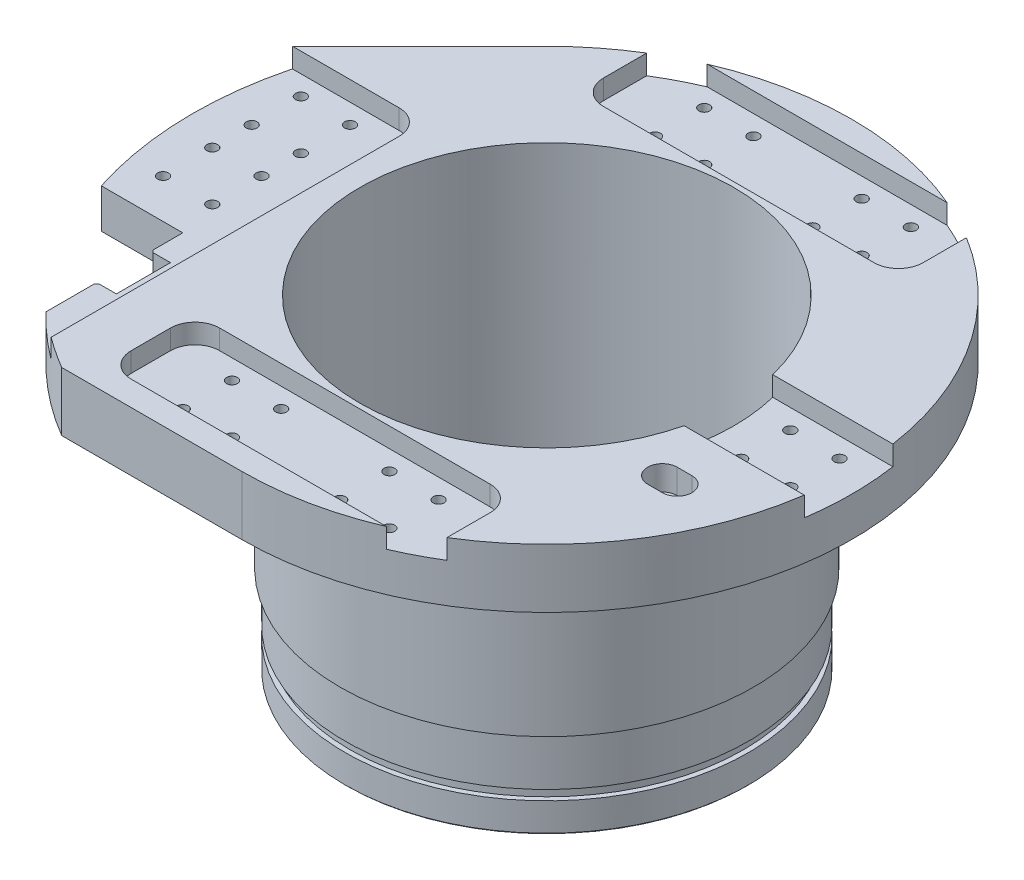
ISO-10303-21;
HEADER;
FILE_DESCRIPTION(('STEP AP214'),'2;1');
FILE_NAME('part.step','',(''),(''),'','','');
FILE_SCHEMA(('AUTOMOTIVE_DESIGN { 1 0 10303 214 1 1 1 1 }'));
ENDSEC;
DATA;
#1=APPLICATION_CONTEXT('core data for automotive mechanical design processes');
#2=APPLICATION_PROTOCOL_DEFINITION('international standard','automotive_design',2000,#1);
#3=PRODUCT_CONTEXT('',#1,'mechanical');
#4=PRODUCT('Part','Part','',(#3));
#5=PRODUCT_RELATED_PRODUCT_CATEGORY('part','',(#4));
#6=PRODUCT_DEFINITION_FORMATION('','',#4);
#7=PRODUCT_DEFINITION_CONTEXT('part definition',#1,'design');
#8=PRODUCT_DEFINITION('design','',#6,#7);
#9=PRODUCT_DEFINITION_SHAPE('','',#8);
#10=(LENGTH_UNIT() NAMED_UNIT(*) SI_UNIT(.MILLI.,.METRE.));
#11=(NAMED_UNIT(*) PLANE_ANGLE_UNIT() SI_UNIT($,.RADIAN.));
#12=(NAMED_UNIT(*) SI_UNIT($,.STERADIAN.) SOLID_ANGLE_UNIT());
#13=UNCERTAINTY_MEASURE_WITH_UNIT(LENGTH_MEASURE(1.E-05),#10,'distance_accuracy_value','');
#14=(GEOMETRIC_REPRESENTATION_CONTEXT(3) GLOBAL_UNCERTAINTY_ASSIGNED_CONTEXT((#13)) GLOBAL_UNIT_ASSIGNED_CONTEXT((#10,
#11,#12)) REPRESENTATION_CONTEXT('',''));
#15=CARTESIAN_POINT('',(0.,0.,0.));
#16=DIRECTION('',(0.,0.,1.));
#17=DIRECTION('',(1.,0.,0.));
#18=AXIS2_PLACEMENT_3D('',#15,#16,#17);
#19=CARTESIAN_POINT('',(-52.,4.,26.5));
#20=DIRECTION('',(-1.,0.,0.));
#21=DIRECTION('',(0.,0.,1.));
#22=AXIS2_PLACEMENT_3D('',#19,#20,#21);
#23=PLANE('',#22);
#24=CARTESIAN_POINT('',(-52.,4.,26.5));
#25=DIRECTION('',(-1.,0.,0.));
#26=DIRECTION('',(0.,0.,1.));
#27=AXIS2_PLACEMENT_3D('',#24,#25,#26);
#28=CIRCLE('',#27,1.5);
#29=CARTESIAN_POINT('',(-52.,4.,28.));
#30=VERTEX_POINT('',#29);
#31=EDGE_CURVE('P0_E17',#30,#30,#28,.F.);
#32=ORIENTED_EDGE('',*,*,#31,.F.);
#33=EDGE_LOOP('',(#32));
#34=FACE_BOUND('',#33,.T.);
#35=ADVANCED_FACE('P0_F14',(#34),#23,.T.);
#36=CARTESIAN_POINT('',(-46.,4.,26.5));
#37=DIRECTION('',(-1.,0.,0.));
#38=DIRECTION('',(0.,0.,1.));
#39=AXIS2_PLACEMENT_3D('',#36,#37,#38);
#40=PLANE('',#39);
#41=CARTESIAN_POINT('',(-46.,4.,26.5));
#42=DIRECTION('',(-1.,0.,0.));
#43=DIRECTION('',(0.,0.,1.));
#44=AXIS2_PLACEMENT_3D('',#41,#42,#43);
#45=CIRCLE('',#44,1.5);
#46=CARTESIAN_POINT('',(-46.,4.,28.));
#47=VERTEX_POINT('',#46);
#48=EDGE_CURVE('P0_E10',#47,#47,#45,.T.);
#49=ORIENTED_EDGE('',*,*,#48,.F.);
#50=EDGE_LOOP('',(#49));
#51=FACE_BOUND('',#50,.T.);
#52=ADVANCED_FACE('P0_F29',(#51),#40,.F.);
#53=CARTESIAN_POINT('',(17.36362956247,4.,26.5));
#54=DIRECTION('',(-1.,0.,0.));
#55=DIRECTION('',(0.,0.,1.));
#56=AXIS2_PLACEMENT_3D('',#53,#54,#55);
#57=CYLINDRICAL_SURFACE('',#56,1.5);
#58=ORIENTED_EDGE('',*,*,#31,.T.);
#59=EDGE_LOOP('',(#58));
#60=FACE_BOUND('',#59,.T.);
#61=ORIENTED_EDGE('',*,*,#48,.T.);
#62=EDGE_LOOP('',(#61));
#63=FACE_BOUND('',#62,.T.);
#64=ADVANCED_FACE('P0_F26',(#60,#63),#57,.T.);
#65=CLOSED_SHELL('',(#35,#52,#64));
#66=MANIFOLD_SOLID_BREP('P0_B1',#65);
#67=CARTESIAN_POINT('',(-52.,4.,41.5));
#68=DIRECTION('',(-1.,0.,0.));
#69=DIRECTION('',(0.,0.,1.));
#70=AXIS2_PLACEMENT_3D('',#67,#68,#69);
#71=PLANE('',#70);
#72=CARTESIAN_POINT('',(-52.,4.,41.5));
#73=DIRECTION('',(-1.,0.,0.));
#74=DIRECTION('',(0.,0.,1.));
#75=AXIS2_PLACEMENT_3D('',#72,#73,#74);
#76=CIRCLE('',#75,1.5);
#77=CARTESIAN_POINT('',(-52.,4.,43.));
#78=VERTEX_POINT('',#77);
#79=EDGE_CURVE('P1_E17',#78,#78,#76,.F.);
#80=ORIENTED_EDGE('',*,*,#79,.F.);
#81=EDGE_LOOP('',(#80));
#82=FACE_BOUND('',#81,.T.);
#83=ADVANCED_FACE('P1_F14',(#82),#71,.T.);
#84=CARTESIAN_POINT('',(-46.,4.,41.5));
#85=DIRECTION('',(-1.,0.,0.));
#86=DIRECTION('',(0.,0.,1.));
#87=AXIS2_PLACEMENT_3D('',#84,#85,#86);
#88=PLANE('',#87);
#89=CARTESIAN_POINT('',(-46.,4.,41.5));
#90=DIRECTION('',(-1.,0.,0.));
#91=DIRECTION('',(0.,0.,1.));
#92=AXIS2_PLACEMENT_3D('',#89,#90,#91);
#93=CIRCLE('',#92,1.5);
#94=CARTESIAN_POINT('',(-46.,4.,43.));
#95=VERTEX_POINT('',#94);
#96=EDGE_CURVE('P1_E10',#95,#95,#93,.T.);
#97=ORIENTED_EDGE('',*,*,#96,.F.);
#98=EDGE_LOOP('',(#97));
#99=FACE_BOUND('',#98,.T.);
#100=ADVANCED_FACE('P1_F29',(#99),#88,.F.);
#101=CARTESIAN_POINT('',(17.36362956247,4.,41.5));
#102=DIRECTION('',(-1.,0.,0.));
#103=DIRECTION('',(0.,0.,1.));
#104=AXIS2_PLACEMENT_3D('',#101,#102,#103);
#105=CYLINDRICAL_SURFACE('',#104,1.5);
#106=ORIENTED_EDGE('',*,*,#79,.T.);
#107=EDGE_LOOP('',(#106));
#108=FACE_BOUND('',#107,.T.);
#109=ORIENTED_EDGE('',*,*,#96,.T.);
#110=EDGE_LOOP('',(#109));
#111=FACE_BOUND('',#110,.T.);
#112=ADVANCED_FACE('P1_F26',(#108,#111),#105,.T.);
#113=CLOSED_SHELL('',(#83,#100,#112));
#114=MANIFOLD_SOLID_BREP('P1_B1',#113);
#115=CARTESIAN_POINT('',(-44.5000000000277,4.,26.5));
#116=DIRECTION('',(-1.,0.,0.));
#117=DIRECTION('',(0.,0.,1.));
#118=AXIS2_PLACEMENT_3D('',#115,#116,#117);
#119=CONICAL_SURFACE('',#118,1.2499999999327,1.0297442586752);
#120=CARTESIAN_POINT('',(-44.5,4.,26.5));
#121=DIRECTION('',(-1.,0.,0.));
#122=DIRECTION('',(0.,0.,1.));
#123=AXIS2_PLACEMENT_3D('',#120,#121,#122);
#124=CIRCLE('',#123,1.25);
#125=CARTESIAN_POINT('',(-44.5,4.,27.75));
#126=VERTEX_POINT('',#125);
#127=EDGE_CURVE('P2_E1481',#126,#126,#124,.T.);
#128=ORIENTED_EDGE('',*,*,#127,.T.);
#129=EDGE_LOOP('',(#128));
#130=FACE_BOUND('',#129,.T.);
#131=CARTESIAN_POINT('',(-43.7489242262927,4.00000000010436,26.5));
#132=VERTEX_POINT('',#131);
#133=VERTEX_LOOP('',#132);
#134=FACE_BOUND('',#133,.T.);
#135=ADVANCED_FACE('P2_F16',(#130,#134),#119,.F.);
#136=CARTESIAN_POINT('',(0.,-36.,0.));
#137=DIRECTION('',(0.,-1.,0.));
#138=DIRECTION('',(0.,0.,-1.));
#139=AXIS2_PLACEMENT_3D('',#136,#137,#138);
#140=CYLINDRICAL_SURFACE('',#139,41.);
#141=CARTESIAN_POINT('',(0.,-36.,0.));
#142=DIRECTION('',(0.,-1.,0.));
#143=DIRECTION('',(0.,0.,-1.));
#144=AXIS2_PLACEMENT_3D('',#141,#142,#143);
#145=CIRCLE('',#144,41.);
#146=CARTESIAN_POINT('',(0.,-36.,-41.));
#147=VERTEX_POINT('',#146);
#148=EDGE_CURVE('P2_E317',#147,#147,#145,.T.);
#149=ORIENTED_EDGE('',*,*,#148,.T.);
#150=EDGE_LOOP('',(#149));
#151=FACE_BOUND('',#150,.T.);
#152=CARTESIAN_POINT('',(0.,-46.,0.));
#153=DIRECTION('',(0.,-1.,0.));
#154=DIRECTION('',(0.,0.,-1.));
#155=AXIS2_PLACEMENT_3D('',#152,#153,#154);
#156=CIRCLE('',#155,41.);
#157=CARTESIAN_POINT('',(0.,-46.,-41.));
#158=VERTEX_POINT('',#157);
#159=EDGE_CURVE('P2_E19',#158,#158,#156,.F.);
#160=ORIENTED_EDGE('',*,*,#159,.T.);
#161=EDGE_LOOP('',(#160));
#162=FACE_BOUND('',#161,.T.);
#163=ADVANCED_FACE('P2_F1715',(#151,#162),#140,.T.);
#164=CARTESIAN_POINT('',(0.,-46.,0.));
#165=DIRECTION('',(0.,1.,0.));
#166=DIRECTION('',(0.,0.,1.));
#167=AXIS2_PLACEMENT_3D('',#164,#165,#166);
#168=PLANE('',#167);
#169=CARTESIAN_POINT('',(0.,-46.,0.));
#170=DIRECTION('',(0.,1.,0.));
#171=DIRECTION('',(0.,0.,1.));
#172=AXIS2_PLACEMENT_3D('',#169,#170,#171);
#173=CIRCLE('',#172,40.);
#174=CARTESIAN_POINT('',(0.,-46.,40.));
#175=VERTEX_POINT('',#174);
#176=EDGE_CURVE('P2_E485',#175,#175,#173,.F.);
#177=ORIENTED_EDGE('',*,*,#176,.F.);
#178=EDGE_LOOP('',(#177));
#179=FACE_BOUND('',#178,.T.);
#180=ORIENTED_EDGE('',*,*,#159,.F.);
#181=EDGE_LOOP('',(#180));
#182=FACE_BOUND('',#181,.T.);
#183=ADVANCED_FACE('P2_F1722',(#179,#182),#168,.F.);
#184=CARTESIAN_POINT('',(-44.5000000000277,4.,41.5));
#185=DIRECTION('',(-1.,0.,0.));
#186=DIRECTION('',(0.,0.,1.));
#187=AXIS2_PLACEMENT_3D('',#184,#185,#186);
#188=CONICAL_SURFACE('',#187,1.2499999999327,1.0297442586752);
#189=CARTESIAN_POINT('',(-44.5,4.,41.5));
#190=DIRECTION('',(-1.,0.,0.));
#191=DIRECTION('',(0.,0.,1.));
#192=AXIS2_PLACEMENT_3D('',#189,#190,#191);
#193=CIRCLE('',#192,1.25);
#194=CARTESIAN_POINT('',(-44.5,4.,42.75));
#195=VERTEX_POINT('',#194);
#196=EDGE_CURVE('P2_E480',#195,#195,#193,.T.);
#197=ORIENTED_EDGE('',*,*,#196,.T.);
#198=EDGE_LOOP('',(#197));
#199=FACE_BOUND('',#198,.T.);
#200=CARTESIAN_POINT('',(-43.7489242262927,4.00000000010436,41.5));
#201=VERTEX_POINT('',#200);
#202=VERTEX_LOOP('',#201);
#203=FACE_BOUND('',#202,.T.);
#204=ADVANCED_FACE('P2_F1727',(#199,#203),#188,.F.);
#205=CARTESIAN_POINT('',(17.36362956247,4.,26.5));
#206=DIRECTION('',(-1.,0.,0.));
#207=DIRECTION('',(0.,0.,1.));
#208=AXIS2_PLACEMENT_3D('',#205,#206,#207);
#209=CYLINDRICAL_SURFACE('',#208,1.25);
#210=ORIENTED_EDGE('',*,*,#127,.F.);
#211=EDGE_LOOP('',(#210));
#212=FACE_BOUND('',#211,.T.);
#213=CARTESIAN_POINT('',(-52.,4.,26.5));
#214=DIRECTION('',(-1.,0.,0.));
#215=DIRECTION('',(0.,0.,1.));
#216=AXIS2_PLACEMENT_3D('',#213,#214,#215);
#217=CIRCLE('',#216,1.25);
#218=CARTESIAN_POINT('',(-52.,4.,27.75));
#219=VERTEX_POINT('',#218);
#220=EDGE_CURVE('P2_E327',#219,#219,#217,.T.);
#221=ORIENTED_EDGE('',*,*,#220,.T.);
#222=EDGE_LOOP('',(#221));
#223=FACE_BOUND('',#222,.T.);
#224=ADVANCED_FACE('P2_F1733',(#212,#223),#209,.F.);
#225=CARTESIAN_POINT('',(-51.5,0.,28.5));
#226=DIRECTION('',(-0.707106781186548,0.,0.707106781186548));
#227=DIRECTION('',(0.707106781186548,0.,0.707106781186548));
#228=AXIS2_PLACEMENT_3D('',#225,#226,#227);
#229=PLANE('',#228);
#230=DIRECTION('',(0.707106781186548,0.,0.707106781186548));
#231=VECTOR('',#230,1.);
#232=CARTESIAN_POINT('',(-51.5,0.,28.5));
#233=LINE('',#232,#231);
#234=CARTESIAN_POINT('',(-52.,0.,28.));
#235=VERTEX_POINT('',#234);
#236=CARTESIAN_POINT('',(-51.5,0.,28.5));
#237=VERTEX_POINT('',#236);
#238=EDGE_CURVE('P2_E306',#235,#237,#233,.T.);
#239=ORIENTED_EDGE('',*,*,#238,.T.);
#240=DIRECTION('',(0.,1.,0.));
#241=VECTOR('',#240,1.);
#242=CARTESIAN_POINT('',(-51.5,0.,28.5));
#243=LINE('',#242,#241);
#244=CARTESIAN_POINT('',(-51.5,8.,28.5));
#245=VERTEX_POINT('',#244);
#246=EDGE_CURVE('P2_E309',#237,#245,#243,.T.);
#247=ORIENTED_EDGE('',*,*,#246,.T.);
#248=DIRECTION('',(0.707106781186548,0.,0.707106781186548));
#249=VECTOR('',#248,1.);
#250=CARTESIAN_POINT('',(-51.5,8.,28.5));
#251=LINE('',#250,#249);
#252=CARTESIAN_POINT('',(-52.,8.,28.));
#253=VERTEX_POINT('',#252);
#254=EDGE_CURVE('P2_E318',#245,#253,#251,.F.);
#255=ORIENTED_EDGE('',*,*,#254,.T.);
#256=DIRECTION('',(0.,1.,0.));
#257=VECTOR('',#256,1.);
#258=CARTESIAN_POINT('',(-52.,0.,28.));
#259=LINE('',#258,#257);
#260=EDGE_CURVE('P2_E312',#253,#235,#259,.F.);
#261=ORIENTED_EDGE('',*,*,#260,.T.);
#262=EDGE_LOOP('',(#239,#247,#255,#261));
#263=FACE_BOUND('',#262,.T.);
#264=ADVANCED_FACE('P2_F308',(#263),#229,.T.);
#265=CARTESIAN_POINT('',(-43.2,-21.,0.));
#266=DIRECTION('',(1.,0.,0.));
#267=DIRECTION('',(0.,0.,-1.));
#268=AXIS2_PLACEMENT_3D('',#265,#266,#267);
#269=SPHERICAL_SURFACE('',#268,2.);
#270=CARTESIAN_POINT('',(-43.2,-21.,0.));
#271=DIRECTION('',(0.,1.,0.));
#272=DIRECTION('',(0.,0.,1.));
#273=AXIS2_PLACEMENT_3D('',#270,#271,#272);
#274=CIRCLE('',#273,2.);
#275=CARTESIAN_POINT('',(-41.2,-21.,0.));
#276=VERTEX_POINT('',#275);
#277=CARTESIAN_POINT('',(-41.9703703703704,-21.,1.57734301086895));
#278=VERTEX_POINT('',#277);
#279=EDGE_CURVE('P2_E33',#276,#278,#274,.F.);
#280=ORIENTED_EDGE('',*,*,#279,.T.);
#281=CARTESIAN_POINT('',(-41.9703703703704,-21.,-1.57734301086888));
#282=CARTESIAN_POINT('',(-41.9703699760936,-20.9546167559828,-1.57734236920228));
#283=CARTESIAN_POINT('',(-41.9704419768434,-20.9092550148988,-1.57543895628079));
#284=CARTESIAN_POINT('',(-41.9707265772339,-20.818851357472,-1.56784305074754));
#285=CARTESIAN_POINT('',(-41.9709391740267,-20.7738094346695,-1.56215063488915));
#286=CARTESIAN_POINT('',(-41.9717809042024,-20.6396829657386,-1.53943260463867));
#287=CARTESIAN_POINT('',(-41.9726139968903,-20.5514877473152,-1.51676611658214));
#288=CARTESIAN_POINT('',(-41.9747321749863,-20.3801403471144,-1.45696397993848));
#289=CARTESIAN_POINT('',(-41.976017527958,-20.2969911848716,-1.41981976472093));
#290=CARTESIAN_POINT('',(-41.9788942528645,-20.1381587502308,-1.33205012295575));
#291=CARTESIAN_POINT('',(-41.9804855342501,-20.0624732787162,-1.28142868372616));
#292=CARTESIAN_POINT('',(-41.9837852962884,-19.9210943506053,-1.16831090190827));
#293=CARTESIAN_POINT('',(-41.9854932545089,-19.8553601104,-1.10586552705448));
#294=CARTESIAN_POINT('',(-41.9888359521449,-19.7354726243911,-0.970678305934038));
#295=CARTESIAN_POINT('',(-41.9904706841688,-19.6813205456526,-0.897935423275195));
#296=CARTESIAN_POINT('',(-41.9934555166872,-19.5869313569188,-0.745275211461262));
#297=CARTESIAN_POINT('',(-41.9948091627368,-19.5465162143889,-0.665468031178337));
#298=CARTESIAN_POINT('',(-41.9971032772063,-19.4798547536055,-0.500141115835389));
#299=CARTESIAN_POINT('',(-41.99804380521,-19.4536063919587,-0.414622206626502));
#300=CARTESIAN_POINT('',(-41.9993939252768,-19.4163393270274,-0.241469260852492));
#301=CARTESIAN_POINT('',(-41.9998101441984,-19.4051304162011,-0.153876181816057));
#302=CARTESIAN_POINT('',(-42.0000862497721,-19.3976681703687,0.0219451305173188));
#303=CARTESIAN_POINT('',(-41.9999461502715,-19.401414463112,0.110173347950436));
#304=CARTESIAN_POINT('',(-41.9991281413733,-19.4236780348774,0.284184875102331));
#305=CARTESIAN_POINT('',(-41.9984535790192,-19.4421033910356,0.369979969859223));
#306=CARTESIAN_POINT('',(-41.9966469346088,-19.4930362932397,0.537262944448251));
#307=CARTESIAN_POINT('',(-41.9955148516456,-19.525543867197,0.618750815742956));
#308=CARTESIAN_POINT('',(-41.9929140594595,-19.6038262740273,0.775454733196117));
#309=CARTESIAN_POINT('',(-41.9914442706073,-19.6496437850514,0.850649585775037));
#310=CARTESIAN_POINT('',(-41.989113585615,-19.7271767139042,0.956872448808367));
#311=CARTESIAN_POINT('',(-41.9883155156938,-19.7544952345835,0.99119146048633));
#312=CARTESIAN_POINT('',(-41.9866983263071,-19.8119082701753,1.05747889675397));
#313=CARTESIAN_POINT('',(-41.985879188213,-19.8420053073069,1.08944513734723));
#314=CARTESIAN_POINT('',(-41.9834080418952,-19.9367682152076,1.18206983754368));
#315=CARTESIAN_POINT('',(-41.981758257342,-20.0053967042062,1.23875760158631));
#316=CARTESIAN_POINT('',(-41.9786497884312,-20.1510983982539,1.33997867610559));
#317=CARTESIAN_POINT('',(-41.9771911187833,-20.2281722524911,1.38451105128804));
#318=CARTESIAN_POINT('',(-41.9752558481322,-20.3490228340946,1.44161792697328));
#319=CARTESIAN_POINT('',(-41.9746491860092,-20.390522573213,1.45913535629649));
#320=CARTESIAN_POINT('',(-41.9735423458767,-20.4747983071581,1.49063387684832));
#321=CARTESIAN_POINT('',(-41.9730420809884,-20.5175732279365,1.5046178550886));
#322=CARTESIAN_POINT('',(-41.9717236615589,-20.6473604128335,1.54111293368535));
#323=CARTESIAN_POINT('',(-41.9710853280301,-20.7359895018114,1.55823992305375));
#324=CARTESIAN_POINT('',(-41.9706060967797,-20.8543154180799,1.57105912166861));
#325=CARTESIAN_POINT('',(-41.9705177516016,-20.8834278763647,1.57341682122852));
#326=CARTESIAN_POINT('',(-41.9703999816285,-20.9416883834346,1.57655621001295));
#327=CARTESIAN_POINT('',(-41.9703704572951,-20.9708362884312,1.57734056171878));
#328=CARTESIAN_POINT('',(-41.9703703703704,-21.,1.57734301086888));
#329=B_SPLINE_CURVE_WITH_KNOTS('',3,(#281,#282,#283,#284,#285,#286,#287,#288,#289,#290,#291,
#292,#293,#294,#295,#296,#297,#298,#299,#300,#301,#302,#303,#304,#305,#306,#307,#308,#309,#310,
#311,#312,#313,#314,#315,#316,#317,#318,#319,#320,#321,#322,#323,#324,#325,#326,#327,#328),
.UNSPECIFIED.,.F.,.F.,(4,2,2,2,2,2,2,2,2,2,2,2,2,2,2,2,2,2,2,2,2,2,2,4),(0.,0.136066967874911,
0.272131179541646,0.543933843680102,0.815897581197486,1.08778094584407,1.35851797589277,
1.62928227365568,1.89639017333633,2.16345953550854,2.42711832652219,2.69077055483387,
2.95278460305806,3.21479917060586,3.47766333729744,3.60914876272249,3.74075474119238,
4.00652339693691,4.27231249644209,4.40731855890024,4.54221395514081,4.81149862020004,
4.89909592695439,4.98654487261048),.UNSPECIFIED.);
#330=CARTESIAN_POINT('',(-41.9703703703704,-21.,-1.57734301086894));
#331=VERTEX_POINT('',#330);
#332=EDGE_CURVE('P2_E446',#331,#278,#329,.T.);
#333=ORIENTED_EDGE('',*,*,#332,.F.);
#334=CARTESIAN_POINT('',(-43.2,-21.,0.));
#335=DIRECTION('',(0.,1.,0.));
#336=DIRECTION('',(0.,0.,1.));
#337=AXIS2_PLACEMENT_3D('',#334,#335,#336);
#338=CIRCLE('',#337,2.);
#339=EDGE_CURVE('P2_E488',#331,#276,#338,.F.);
#340=ORIENTED_EDGE('',*,*,#339,.T.);
#341=EDGE_LOOP('',(#280,#333,#340));
#342=FACE_BOUND('',#341,.T.);
#343=ADVANCED_FACE('P2_F493',(#342),#269,.F.);
#344=CARTESIAN_POINT('',(0.,-36.,0.));
#345=DIRECTION('',(0.,1.,0.));
#346=DIRECTION('',(0.,0.,1.));
#347=AXIS2_PLACEMENT_3D('',#344,#345,#346);
#348=PLANE('',#347);
#349=ORIENTED_EDGE('',*,*,#148,.F.);
#350=EDGE_LOOP('',(#349));
#351=FACE_BOUND('',#350,.T.);
#352=CARTESIAN_POINT('',(0.,-36.,0.));
#353=DIRECTION('',(0.,1.,0.));
#354=DIRECTION('',(0.,0.,1.));
#355=AXIS2_PLACEMENT_3D('',#352,#353,#354);
#356=CIRCLE('',#355,42.);
#357=CARTESIAN_POINT('',(-41.9703703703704,-36.,1.57734301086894));
#358=VERTEX_POINT('',#357);
#359=CARTESIAN_POINT('',(-41.9703703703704,-36.,-1.57734301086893));
#360=VERTEX_POINT('',#359);
#361=EDGE_CURVE('P2_E442',#358,#360,#356,.T.);
#362=ORIENTED_EDGE('',*,*,#361,.F.);
#363=CARTESIAN_POINT('',(-43.2,-36.,0.));
#364=DIRECTION('',(0.,1.,0.));
#365=DIRECTION('',(0.,0.,1.));
#366=AXIS2_PLACEMENT_3D('',#363,#364,#365);
#367=CIRCLE('',#366,2.);
#368=EDGE_CURVE('P2_E1709',#358,#360,#367,.T.);
#369=ORIENTED_EDGE('',*,*,#368,.T.);
#370=EDGE_LOOP('',(#362,#369));
#371=FACE_BOUND('',#370,.T.);
#372=ADVANCED_FACE('P2_F498',(#351,#371),#348,.F.);
#373=CARTESIAN_POINT('',(-43.2,-55.75,0.));
#374=DIRECTION('',(0.,1.,0.));
#375=DIRECTION('',(0.,0.,1.));
#376=AXIS2_PLACEMENT_3D('',#373,#374,#375);
#377=CYLINDRICAL_SURFACE('',#376,2.);
#378=ORIENTED_EDGE('',*,*,#368,.F.);
#379=DIRECTION('',(0.,1.,0.));
#380=VECTOR('',#379,1.);
#381=CARTESIAN_POINT('',(-41.9703703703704,0.,1.57734301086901));
#382=LINE('',#381,#380);
#383=EDGE_CURVE('P2_E443',#278,#358,#382,.F.);
#384=ORIENTED_EDGE('',*,*,#383,.F.);
#385=ORIENTED_EDGE('',*,*,#279,.F.);
#386=ORIENTED_EDGE('',*,*,#339,.F.);
#387=DIRECTION('',(0.,1.,0.));
#388=VECTOR('',#387,1.);
#389=CARTESIAN_POINT('',(-41.9703703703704,0.,-1.57734301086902));
#390=LINE('',#389,#388);
#391=EDGE_CURVE('P2_E438',#360,#331,#390,.T.);
#392=ORIENTED_EDGE('',*,*,#391,.F.);
#393=EDGE_LOOP('',(#378,#384,#385,#386,#392));
#394=FACE_BOUND('',#393,.T.);
#395=ADVANCED_FACE('P2_F712',(#394),#377,.F.);
#396=CARTESIAN_POINT('',(0.,5.,0.));
#397=DIRECTION('',(0.,1.,0.));
#398=DIRECTION('',(0.,0.,1.));
#399=AXIS2_PLACEMENT_3D('',#396,#397,#398);
#400=PLANE('',#399);
#401=CARTESIAN_POINT('',(21.,5.,43.));
#402=DIRECTION('',(0.,1.,0.));
#403=DIRECTION('',(0.,0.,1.));
#404=AXIS2_PLACEMENT_3D('',#401,#402,#403);
#405=CIRCLE('',#404,1.1);
#406=CARTESIAN_POINT('',(21.,5.,44.1));
#407=VERTEX_POINT('',#406);
#408=EDGE_CURVE('P2_E2641',#407,#407,#405,.T.);
#409=ORIENTED_EDGE('',*,*,#408,.T.);
#410=EDGE_LOOP('',(#409));
#411=FACE_BOUND('',#410,.T.);
#412=CARTESIAN_POINT('',(21.,5.,43.));
#413=DIRECTION('',(0.,1.,0.));
#414=DIRECTION('',(0.,0.,1.));
#415=AXIS2_PLACEMENT_3D('',#412,#413,#414);
#416=CIRCLE('',#415,2.25);
#417=CARTESIAN_POINT('',(21.,5.,45.25));
#418=VERTEX_POINT('',#417);
#419=EDGE_CURVE('P2_E441',#418,#418,#416,.F.);
#420=ORIENTED_EDGE('',*,*,#419,.T.);
#421=EDGE_LOOP('',(#420));
#422=FACE_BOUND('',#421,.T.);
#423=ADVANCED_FACE('P2_F709',(#411,#422),#400,.F.);
#424=CARTESIAN_POINT('',(0.,5.,0.));
#425=DIRECTION('',(0.,1.,0.));
#426=DIRECTION('',(0.,0.,1.));
#427=AXIS2_PLACEMENT_3D('',#424,#425,#426);
#428=PLANE('',#427);
#429=CARTESIAN_POINT('',(21.,5.,53.));
#430=DIRECTION('',(0.,1.,0.));
#431=DIRECTION('',(0.,0.,1.));
#432=AXIS2_PLACEMENT_3D('',#429,#430,#431);
#433=CIRCLE('',#432,1.1);
#434=CARTESIAN_POINT('',(21.,5.,54.1));
#435=VERTEX_POINT('',#434);
#436=EDGE_CURVE('P2_E2644',#435,#435,#433,.T.);
#437=ORIENTED_EDGE('',*,*,#436,.T.);
#438=EDGE_LOOP('',(#437));
#439=FACE_BOUND('',#438,.T.);
#440=CARTESIAN_POINT('',(21.,5.,53.));
#441=DIRECTION('',(0.,1.,0.));
#442=DIRECTION('',(0.,0.,1.));
#443=AXIS2_PLACEMENT_3D('',#440,#441,#442);
#444=CIRCLE('',#443,2.25);
#445=CARTESIAN_POINT('',(21.,5.,55.25));
#446=VERTEX_POINT('',#445);
#447=EDGE_CURVE('P2_E1242',#446,#446,#444,.F.);
#448=ORIENTED_EDGE('',*,*,#447,.T.);
#449=EDGE_LOOP('',(#448));
#450=FACE_BOUND('',#449,.T.);
#451=ADVANCED_FACE('P2_F705',(#439,#450),#428,.F.);
#452=CARTESIAN_POINT('',(0.,5.,0.));
#453=DIRECTION('',(0.,1.,0.));
#454=DIRECTION('',(0.,0.,1.));
#455=AXIS2_PLACEMENT_3D('',#452,#453,#454);
#456=PLANE('',#455);
#457=CARTESIAN_POINT('',(11.,5.,53.));
#458=DIRECTION('',(0.,1.,0.));
#459=DIRECTION('',(0.,0.,1.));
#460=AXIS2_PLACEMENT_3D('',#457,#458,#459);
#461=CIRCLE('',#460,1.1);
#462=CARTESIAN_POINT('',(11.,5.,54.1));
#463=VERTEX_POINT('',#462);
#464=EDGE_CURVE('P2_E2635',#463,#463,#461,.T.);
#465=ORIENTED_EDGE('',*,*,#464,.T.);
#466=EDGE_LOOP('',(#465));
#467=FACE_BOUND('',#466,.T.);
#468=CARTESIAN_POINT('',(11.,5.,53.));
#469=DIRECTION('',(0.,1.,0.));
#470=DIRECTION('',(0.,0.,1.));
#471=AXIS2_PLACEMENT_3D('',#468,#469,#470);
#472=CIRCLE('',#471,2.25);
#473=CARTESIAN_POINT('',(11.,5.,55.25));
#474=VERTEX_POINT('',#473);
#475=EDGE_CURVE('P2_E1239',#474,#474,#472,.F.);
#476=ORIENTED_EDGE('',*,*,#475,.T.);
#477=EDGE_LOOP('',(#476));
#478=FACE_BOUND('',#477,.T.);
#479=ADVANCED_FACE('P2_F701',(#467,#478),#456,.F.);
#480=CARTESIAN_POINT('',(0.,5.,0.));
#481=DIRECTION('',(0.,1.,0.));
#482=DIRECTION('',(0.,0.,1.));
#483=AXIS2_PLACEMENT_3D('',#480,#481,#482);
#484=PLANE('',#483);
#485=CARTESIAN_POINT('',(11.,5.,43.));
#486=DIRECTION('',(0.,1.,0.));
#487=DIRECTION('',(0.,0.,1.));
#488=AXIS2_PLACEMENT_3D('',#485,#486,#487);
#489=CIRCLE('',#488,1.1);
#490=CARTESIAN_POINT('',(11.,5.,44.1));
#491=VERTEX_POINT('',#490);
#492=EDGE_CURVE('P2_E2638',#491,#491,#489,.T.);
#493=ORIENTED_EDGE('',*,*,#492,.T.);
#494=EDGE_LOOP('',(#493));
#495=FACE_BOUND('',#494,.T.);
#496=CARTESIAN_POINT('',(11.,5.,43.));
#497=DIRECTION('',(0.,1.,0.));
#498=DIRECTION('',(0.,0.,1.));
#499=AXIS2_PLACEMENT_3D('',#496,#497,#498);
#500=CIRCLE('',#499,2.25);
#501=CARTESIAN_POINT('',(11.,5.,45.25));
#502=VERTEX_POINT('',#501);
#503=EDGE_CURVE('P2_E1236',#502,#502,#500,.F.);
#504=ORIENTED_EDGE('',*,*,#503,.T.);
#505=EDGE_LOOP('',(#504));
#506=FACE_BOUND('',#505,.T.);
#507=ADVANCED_FACE('P2_F697',(#495,#506),#484,.F.);
#508=CARTESIAN_POINT('',(0.,5.,0.));
#509=DIRECTION('',(0.,1.,0.));
#510=DIRECTION('',(0.,0.,1.));
#511=AXIS2_PLACEMENT_3D('',#508,#509,#510);
#512=PLANE('',#511);
#513=CARTESIAN_POINT('',(-11.,5.,43.));
#514=DIRECTION('',(0.,1.,0.));
#515=DIRECTION('',(0.,0.,1.));
#516=AXIS2_PLACEMENT_3D('',#513,#514,#515);
#517=CIRCLE('',#516,1.1);
#518=CARTESIAN_POINT('',(-11.,5.,44.1));
#519=VERTEX_POINT('',#518);
#520=EDGE_CURVE('P2_E2653',#519,#519,#517,.T.);
#521=ORIENTED_EDGE('',*,*,#520,.T.);
#522=EDGE_LOOP('',(#521));
#523=FACE_BOUND('',#522,.T.);
#524=CARTESIAN_POINT('',(-11.,5.,43.));
#525=DIRECTION('',(0.,1.,0.));
#526=DIRECTION('',(0.,0.,1.));
#527=AXIS2_PLACEMENT_3D('',#524,#525,#526);
#528=CIRCLE('',#527,2.25);
#529=CARTESIAN_POINT('',(-11.,5.,45.25));
#530=VERTEX_POINT('',#529);
#531=EDGE_CURVE('P2_E1233',#530,#530,#528,.F.);
#532=ORIENTED_EDGE('',*,*,#531,.T.);
#533=EDGE_LOOP('',(#532));
#534=FACE_BOUND('',#533,.T.);
#535=ADVANCED_FACE('P2_F693',(#523,#534),#512,.F.);
#536=CARTESIAN_POINT('',(0.,5.,0.));
#537=DIRECTION('',(0.,1.,0.));
#538=DIRECTION('',(0.,0.,1.));
#539=AXIS2_PLACEMENT_3D('',#536,#537,#538);
#540=PLANE('',#539);
#541=CARTESIAN_POINT('',(-11.,5.,53.));
#542=DIRECTION('',(0.,1.,0.));
#543=DIRECTION('',(0.,0.,1.));
#544=AXIS2_PLACEMENT_3D('',#541,#542,#543);
#545=CIRCLE('',#544,1.1);
#546=CARTESIAN_POINT('',(-11.,5.,54.1));
#547=VERTEX_POINT('',#546);
#548=EDGE_CURVE('P2_E473',#547,#547,#545,.T.);
#549=ORIENTED_EDGE('',*,*,#548,.T.);
#550=EDGE_LOOP('',(#549));
#551=FACE_BOUND('',#550,.T.);
#552=CARTESIAN_POINT('',(-11.,5.,53.));
#553=DIRECTION('',(0.,1.,0.));
#554=DIRECTION('',(0.,0.,1.));
#555=AXIS2_PLACEMENT_3D('',#552,#553,#554);
#556=CIRCLE('',#555,2.25);
#557=CARTESIAN_POINT('',(-11.,5.,55.25));
#558=VERTEX_POINT('',#557);
#559=EDGE_CURVE('P2_E1230',#558,#558,#556,.F.);
#560=ORIENTED_EDGE('',*,*,#559,.T.);
#561=EDGE_LOOP('',(#560));
#562=FACE_BOUND('',#561,.T.);
#563=ADVANCED_FACE('P2_F689',(#551,#562),#540,.F.);
#564=CARTESIAN_POINT('',(0.,5.,0.));
#565=DIRECTION('',(0.,1.,0.));
#566=DIRECTION('',(0.,0.,1.));
#567=AXIS2_PLACEMENT_3D('',#564,#565,#566);
#568=PLANE('',#567);
#569=CARTESIAN_POINT('',(-21.,5.,53.));
#570=DIRECTION('',(0.,1.,0.));
#571=DIRECTION('',(0.,0.,1.));
#572=AXIS2_PLACEMENT_3D('',#569,#570,#571);
#573=CIRCLE('',#572,1.1);
#574=CARTESIAN_POINT('',(-21.,5.,54.1));
#575=VERTEX_POINT('',#574);
#576=EDGE_CURVE('P2_E2647',#575,#575,#573,.T.);
#577=ORIENTED_EDGE('',*,*,#576,.T.);
#578=EDGE_LOOP('',(#577));
#579=FACE_BOUND('',#578,.T.);
#580=CARTESIAN_POINT('',(-21.,5.,53.));
#581=DIRECTION('',(0.,1.,0.));
#582=DIRECTION('',(0.,0.,1.));
#583=AXIS2_PLACEMENT_3D('',#580,#581,#582);
#584=CIRCLE('',#583,2.25);
#585=CARTESIAN_POINT('',(-21.,5.,55.25));
#586=VERTEX_POINT('',#585);
#587=EDGE_CURVE('P2_E1227',#586,#586,#584,.F.);
#588=ORIENTED_EDGE('',*,*,#587,.T.);
#589=EDGE_LOOP('',(#588));
#590=FACE_BOUND('',#589,.T.);
#591=ADVANCED_FACE('P2_F685',(#579,#590),#568,.F.);
#592=CARTESIAN_POINT('',(0.,5.,0.));
#593=DIRECTION('',(0.,1.,0.));
#594=DIRECTION('',(0.,0.,1.));
#595=AXIS2_PLACEMENT_3D('',#592,#593,#594);
#596=PLANE('',#595);
#597=CARTESIAN_POINT('',(-21.,5.,43.));
#598=DIRECTION('',(0.,1.,0.));
#599=DIRECTION('',(0.,0.,1.));
#600=AXIS2_PLACEMENT_3D('',#597,#598,#599);
#601=CIRCLE('',#600,1.1);
#602=CARTESIAN_POINT('',(-21.,5.,44.1));
#603=VERTEX_POINT('',#602);
#604=EDGE_CURVE('P2_E2650',#603,#603,#601,.T.);
#605=ORIENTED_EDGE('',*,*,#604,.T.);
#606=EDGE_LOOP('',(#605));
#607=FACE_BOUND('',#606,.T.);
#608=CARTESIAN_POINT('',(-21.,5.,43.));
#609=DIRECTION('',(0.,1.,0.));
#610=DIRECTION('',(0.,0.,1.));
#611=AXIS2_PLACEMENT_3D('',#608,#609,#610);
#612=CIRCLE('',#611,2.25);
#613=CARTESIAN_POINT('',(-21.,5.,45.25));
#614=VERTEX_POINT('',#613);
#615=EDGE_CURVE('P2_E1224',#614,#614,#612,.F.);
#616=ORIENTED_EDGE('',*,*,#615,.T.);
#617=EDGE_LOOP('',(#616));
#618=FACE_BOUND('',#617,.T.);
#619=ADVANCED_FACE('P2_F681',(#607,#618),#596,.F.);
#620=CARTESIAN_POINT('',(0.,5.,0.));
#621=DIRECTION('',(0.,1.,0.));
#622=DIRECTION('',(0.,0.,1.));
#623=AXIS2_PLACEMENT_3D('',#620,#621,#622);
#624=PLANE('',#623);
#625=CARTESIAN_POINT('',(-54.,5.,4.));
#626=DIRECTION('',(0.,1.,0.));
#627=DIRECTION('',(0.,0.,1.));
#628=AXIS2_PLACEMENT_3D('',#625,#626,#627);
#629=CIRCLE('',#628,1.1);
#630=CARTESIAN_POINT('',(-54.,5.,5.1));
#631=VERTEX_POINT('',#630);
#632=EDGE_CURVE('P2_E1703',#631,#631,#629,.T.);
#633=ORIENTED_EDGE('',*,*,#632,.T.);
#634=EDGE_LOOP('',(#633));
#635=FACE_BOUND('',#634,.T.);
#636=CARTESIAN_POINT('',(-54.,5.,4.));
#637=DIRECTION('',(0.,1.,0.));
#638=DIRECTION('',(0.,0.,1.));
#639=AXIS2_PLACEMENT_3D('',#636,#637,#638);
#640=CIRCLE('',#639,2.25);
#641=CARTESIAN_POINT('',(-54.,5.,6.25));
#642=VERTEX_POINT('',#641);
#643=EDGE_CURVE('P2_E1221',#642,#642,#640,.F.);
#644=ORIENTED_EDGE('',*,*,#643,.T.);
#645=EDGE_LOOP('',(#644));
#646=FACE_BOUND('',#645,.T.);
#647=ADVANCED_FACE('P2_F677',(#635,#646),#624,.F.);
#648=CARTESIAN_POINT('',(0.,5.,0.));
#649=DIRECTION('',(0.,1.,0.));
#650=DIRECTION('',(0.,0.,1.));
#651=AXIS2_PLACEMENT_3D('',#648,#649,#650);
#652=PLANE('',#651);
#653=CARTESIAN_POINT('',(-54.,5.,14.));
#654=DIRECTION('',(0.,1.,0.));
#655=DIRECTION('',(0.,0.,1.));
#656=AXIS2_PLACEMENT_3D('',#653,#654,#655);
#657=CIRCLE('',#656,1.1);
#658=CARTESIAN_POINT('',(-54.,5.,15.1));
#659=VERTEX_POINT('',#658);
#660=EDGE_CURVE('P2_E2620',#659,#659,#657,.T.);
#661=ORIENTED_EDGE('',*,*,#660,.T.);
#662=EDGE_LOOP('',(#661));
#663=FACE_BOUND('',#662,.T.);
#664=CARTESIAN_POINT('',(-54.,5.,14.));
#665=DIRECTION('',(0.,1.,0.));
#666=DIRECTION('',(0.,0.,1.));
#667=AXIS2_PLACEMENT_3D('',#664,#665,#666);
#668=CIRCLE('',#667,2.25);
#669=CARTESIAN_POINT('',(-54.,5.,16.25));
#670=VERTEX_POINT('',#669);
#671=EDGE_CURVE('P2_E1218',#670,#670,#668,.F.);
#672=ORIENTED_EDGE('',*,*,#671,.T.);
#673=EDGE_LOOP('',(#672));
#674=FACE_BOUND('',#673,.T.);
#675=ADVANCED_FACE('P2_F673',(#663,#674),#652,.F.);
#676=CARTESIAN_POINT('',(0.,5.,0.));
#677=DIRECTION('',(0.,1.,0.));
#678=DIRECTION('',(0.,0.,1.));
#679=AXIS2_PLACEMENT_3D('',#676,#677,#678);
#680=PLANE('',#679);
#681=CARTESIAN_POINT('',(-64.,5.,14.));
#682=DIRECTION('',(0.,1.,0.));
#683=DIRECTION('',(0.,0.,1.));
#684=AXIS2_PLACEMENT_3D('',#681,#682,#683);
#685=CIRCLE('',#684,1.1);
#686=CARTESIAN_POINT('',(-64.,5.,15.1));
#687=VERTEX_POINT('',#686);
#688=EDGE_CURVE('P2_E1497',#687,#687,#685,.T.);
#689=ORIENTED_EDGE('',*,*,#688,.T.);
#690=EDGE_LOOP('',(#689));
#691=FACE_BOUND('',#690,.T.);
#692=CARTESIAN_POINT('',(-64.,5.,14.));
#693=DIRECTION('',(0.,1.,0.));
#694=DIRECTION('',(0.,0.,1.));
#695=AXIS2_PLACEMENT_3D('',#692,#693,#694);
#696=CIRCLE('',#695,2.25);
#697=CARTESIAN_POINT('',(-64.,5.,16.25));
#698=VERTEX_POINT('',#697);
#699=EDGE_CURVE('P2_E1215',#698,#698,#696,.F.);
#700=ORIENTED_EDGE('',*,*,#699,.T.);
#701=EDGE_LOOP('',(#700));
#702=FACE_BOUND('',#701,.T.);
#703=ADVANCED_FACE('P2_F669',(#691,#702),#680,.F.);
#704=CARTESIAN_POINT('',(0.,5.,0.));
#705=DIRECTION('',(0.,1.,0.));
#706=DIRECTION('',(0.,0.,1.));
#707=AXIS2_PLACEMENT_3D('',#704,#705,#706);
#708=PLANE('',#707);
#709=CARTESIAN_POINT('',(-64.,5.,4.));
#710=DIRECTION('',(0.,1.,0.));
#711=DIRECTION('',(0.,0.,1.));
#712=AXIS2_PLACEMENT_3D('',#709,#710,#711);
#713=CIRCLE('',#712,1.1);
#714=CARTESIAN_POINT('',(-64.,5.,5.1));
#715=VERTEX_POINT('',#714);
#716=EDGE_CURVE('P2_E1699',#715,#715,#713,.T.);
#717=ORIENTED_EDGE('',*,*,#716,.T.);
#718=EDGE_LOOP('',(#717));
#719=FACE_BOUND('',#718,.T.);
#720=CARTESIAN_POINT('',(-64.,5.,4.));
#721=DIRECTION('',(0.,1.,0.));
#722=DIRECTION('',(0.,0.,1.));
#723=AXIS2_PLACEMENT_3D('',#720,#721,#722);
#724=CIRCLE('',#723,2.25);
#725=CARTESIAN_POINT('',(-64.,5.,6.25));
#726=VERTEX_POINT('',#725);
#727=EDGE_CURVE('P2_E1212',#726,#726,#724,.F.);
#728=ORIENTED_EDGE('',*,*,#727,.T.);
#729=EDGE_LOOP('',(#728));
#730=FACE_BOUND('',#729,.T.);
#731=ADVANCED_FACE('P2_F665',(#719,#730),#708,.F.);
#732=CARTESIAN_POINT('',(0.,5.,0.));
#733=DIRECTION('',(0.,1.,0.));
#734=DIRECTION('',(0.,0.,1.));
#735=AXIS2_PLACEMENT_3D('',#732,#733,#734);
#736=PLANE('',#735);
#737=CARTESIAN_POINT('',(-54.,5.,-14.));
#738=DIRECTION('',(0.,1.,0.));
#739=DIRECTION('',(0.,0.,1.));
#740=AXIS2_PLACEMENT_3D('',#737,#738,#739);
#741=CIRCLE('',#740,1.1);
#742=CARTESIAN_POINT('',(-54.,5.,-12.9));
#743=VERTEX_POINT('',#742);
#744=EDGE_CURVE('P2_E2629',#743,#743,#741,.T.);
#745=ORIENTED_EDGE('',*,*,#744,.T.);
#746=EDGE_LOOP('',(#745));
#747=FACE_BOUND('',#746,.T.);
#748=CARTESIAN_POINT('',(-54.,5.,-14.));
#749=DIRECTION('',(0.,1.,0.));
#750=DIRECTION('',(0.,0.,1.));
#751=AXIS2_PLACEMENT_3D('',#748,#749,#750);
#752=CIRCLE('',#751,2.25);
#753=CARTESIAN_POINT('',(-54.,5.,-11.75));
#754=VERTEX_POINT('',#753);
#755=EDGE_CURVE('P2_E1209',#754,#754,#752,.F.);
#756=ORIENTED_EDGE('',*,*,#755,.T.);
#757=EDGE_LOOP('',(#756));
#758=FACE_BOUND('',#757,.T.);
#759=ADVANCED_FACE('P2_F661',(#747,#758),#736,.F.);
#760=CARTESIAN_POINT('',(0.,5.,0.));
#761=DIRECTION('',(0.,1.,0.));
#762=DIRECTION('',(0.,0.,1.));
#763=AXIS2_PLACEMENT_3D('',#760,#761,#762);
#764=PLANE('',#763);
#765=CARTESIAN_POINT('',(-54.,5.,-4.));
#766=DIRECTION('',(0.,1.,0.));
#767=DIRECTION('',(0.,0.,1.));
#768=AXIS2_PLACEMENT_3D('',#765,#766,#767);
#769=CIRCLE('',#768,1.1);
#770=CARTESIAN_POINT('',(-54.,5.,-2.9));
#771=VERTEX_POINT('',#770);
#772=EDGE_CURVE('P2_E2632',#771,#771,#769,.T.);
#773=ORIENTED_EDGE('',*,*,#772,.T.);
#774=EDGE_LOOP('',(#773));
#775=FACE_BOUND('',#774,.T.);
#776=CARTESIAN_POINT('',(-54.,5.,-4.));
#777=DIRECTION('',(0.,1.,0.));
#778=DIRECTION('',(0.,0.,1.));
#779=AXIS2_PLACEMENT_3D('',#776,#777,#778);
#780=CIRCLE('',#779,2.25);
#781=CARTESIAN_POINT('',(-54.,5.,-1.75));
#782=VERTEX_POINT('',#781);
#783=EDGE_CURVE('P2_E1206',#782,#782,#780,.F.);
#784=ORIENTED_EDGE('',*,*,#783,.T.);
#785=EDGE_LOOP('',(#784));
#786=FACE_BOUND('',#785,.T.);
#787=ADVANCED_FACE('P2_F657',(#775,#786),#764,.F.);
#788=CARTESIAN_POINT('',(0.,5.,0.));
#789=DIRECTION('',(0.,1.,0.));
#790=DIRECTION('',(0.,0.,1.));
#791=AXIS2_PLACEMENT_3D('',#788,#789,#790);
#792=PLANE('',#791);
#793=CARTESIAN_POINT('',(-64.,5.,-4.));
#794=DIRECTION('',(0.,1.,0.));
#795=DIRECTION('',(0.,0.,1.));
#796=AXIS2_PLACEMENT_3D('',#793,#794,#795);
#797=CIRCLE('',#796,1.1);
#798=CARTESIAN_POINT('',(-64.,5.,-2.9));
#799=VERTEX_POINT('',#798);
#800=EDGE_CURVE('P2_E2623',#799,#799,#797,.T.);
#801=ORIENTED_EDGE('',*,*,#800,.T.);
#802=EDGE_LOOP('',(#801));
#803=FACE_BOUND('',#802,.T.);
#804=CARTESIAN_POINT('',(-64.,5.,-4.));
#805=DIRECTION('',(0.,1.,0.));
#806=DIRECTION('',(0.,0.,1.));
#807=AXIS2_PLACEMENT_3D('',#804,#805,#806);
#808=CIRCLE('',#807,2.25);
#809=CARTESIAN_POINT('',(-64.,5.,-1.75));
#810=VERTEX_POINT('',#809);
#811=EDGE_CURVE('P2_E1203',#810,#810,#808,.F.);
#812=ORIENTED_EDGE('',*,*,#811,.T.);
#813=EDGE_LOOP('',(#812));
#814=FACE_BOUND('',#813,.T.);
#815=ADVANCED_FACE('P2_F653',(#803,#814),#792,.F.);
#816=CARTESIAN_POINT('',(0.,5.,0.));
#817=DIRECTION('',(0.,1.,0.));
#818=DIRECTION('',(0.,0.,1.));
#819=AXIS2_PLACEMENT_3D('',#816,#817,#818);
#820=PLANE('',#819);
#821=CARTESIAN_POINT('',(-64.,5.,-14.));
#822=DIRECTION('',(0.,1.,0.));
#823=DIRECTION('',(0.,0.,1.));
#824=AXIS2_PLACEMENT_3D('',#821,#822,#823);
#825=CIRCLE('',#824,1.1);
#826=CARTESIAN_POINT('',(-64.,5.,-12.9));
#827=VERTEX_POINT('',#826);
#828=EDGE_CURVE('P2_E2626',#827,#827,#825,.T.);
#829=ORIENTED_EDGE('',*,*,#828,.T.);
#830=EDGE_LOOP('',(#829));
#831=FACE_BOUND('',#830,.T.);
#832=CARTESIAN_POINT('',(-64.,5.,-14.));
#833=DIRECTION('',(0.,1.,0.));
#834=DIRECTION('',(0.,0.,1.));
#835=AXIS2_PLACEMENT_3D('',#832,#833,#834);
#836=CIRCLE('',#835,2.25);
#837=CARTESIAN_POINT('',(-64.,5.,-11.75));
#838=VERTEX_POINT('',#837);
#839=EDGE_CURVE('P2_E1200',#838,#838,#836,.F.);
#840=ORIENTED_EDGE('',*,*,#839,.T.);
#841=EDGE_LOOP('',(#840));
#842=FACE_BOUND('',#841,.T.);
#843=ADVANCED_FACE('P2_F649',(#831,#842),#820,.F.);
#844=CARTESIAN_POINT('',(0.,5.,0.));
#845=DIRECTION('',(0.,1.,0.));
#846=DIRECTION('',(0.,0.,1.));
#847=AXIS2_PLACEMENT_3D('',#844,#845,#846);
#848=PLANE('',#847);
#849=CARTESIAN_POINT('',(-21.,5.,-43.));
#850=DIRECTION('',(0.,1.,0.));
#851=DIRECTION('',(0.,0.,1.));
#852=AXIS2_PLACEMENT_3D('',#849,#850,#851);
#853=CIRCLE('',#852,1.1);
#854=CARTESIAN_POINT('',(-21.,5.,-41.9));
#855=VERTEX_POINT('',#854);
#856=EDGE_CURVE('P2_E1173',#855,#855,#853,.T.);
#857=ORIENTED_EDGE('',*,*,#856,.T.);
#858=EDGE_LOOP('',(#857));
#859=FACE_BOUND('',#858,.T.);
#860=CARTESIAN_POINT('',(-21.,5.,-43.));
#861=DIRECTION('',(0.,1.,0.));
#862=DIRECTION('',(0.,0.,1.));
#863=AXIS2_PLACEMENT_3D('',#860,#861,#862);
#864=CIRCLE('',#863,2.25);
#865=CARTESIAN_POINT('',(-21.,5.,-40.75));
#866=VERTEX_POINT('',#865);
#867=EDGE_CURVE('P2_E1191',#866,#866,#864,.F.);
#868=ORIENTED_EDGE('',*,*,#867,.T.);
#869=EDGE_LOOP('',(#868));
#870=FACE_BOUND('',#869,.T.);
#871=ADVANCED_FACE('P2_F645',(#859,#870),#848,.F.);
#872=CARTESIAN_POINT('',(0.,5.,0.));
#873=DIRECTION('',(0.,1.,0.));
#874=DIRECTION('',(0.,0.,1.));
#875=AXIS2_PLACEMENT_3D('',#872,#873,#874);
#876=PLANE('',#875);
#877=CARTESIAN_POINT('',(-21.,5.,-53.));
#878=DIRECTION('',(0.,1.,0.));
#879=DIRECTION('',(0.,0.,1.));
#880=AXIS2_PLACEMENT_3D('',#877,#878,#879);
#881=CIRCLE('',#880,1.1);
#882=CARTESIAN_POINT('',(-21.,5.,-51.9));
#883=VERTEX_POINT('',#882);
#884=EDGE_CURVE('P2_E1170',#883,#883,#881,.T.);
#885=ORIENTED_EDGE('',*,*,#884,.T.);
#886=EDGE_LOOP('',(#885));
#887=FACE_BOUND('',#886,.T.);
#888=CARTESIAN_POINT('',(-21.,5.,-53.));
#889=DIRECTION('',(0.,1.,0.));
#890=DIRECTION('',(0.,0.,1.));
#891=AXIS2_PLACEMENT_3D('',#888,#889,#890);
#892=CIRCLE('',#891,2.25);
#893=CARTESIAN_POINT('',(-21.,5.,-50.75));
#894=VERTEX_POINT('',#893);
#895=EDGE_CURVE('P2_E1188',#894,#894,#892,.F.);
#896=ORIENTED_EDGE('',*,*,#895,.T.);
#897=EDGE_LOOP('',(#896));
#898=FACE_BOUND('',#897,.T.);
#899=ADVANCED_FACE('P2_F641',(#887,#898),#876,.F.);
#900=CARTESIAN_POINT('',(0.,5.,0.));
#901=DIRECTION('',(0.,1.,0.));
#902=DIRECTION('',(0.,0.,1.));
#903=AXIS2_PLACEMENT_3D('',#900,#901,#902);
#904=PLANE('',#903);
#905=CARTESIAN_POINT('',(-11.,5.,-53.));
#906=DIRECTION('',(0.,1.,0.));
#907=DIRECTION('',(0.,0.,1.));
#908=AXIS2_PLACEMENT_3D('',#905,#906,#907);
#909=CIRCLE('',#908,1.1);
#910=CARTESIAN_POINT('',(-11.,5.,-51.9));
#911=VERTEX_POINT('',#910);
#912=EDGE_CURVE('P2_E1167',#911,#911,#909,.T.);
#913=ORIENTED_EDGE('',*,*,#912,.T.);
#914=EDGE_LOOP('',(#913));
#915=FACE_BOUND('',#914,.T.);
#916=CARTESIAN_POINT('',(-11.,5.,-53.));
#917=DIRECTION('',(0.,1.,0.));
#918=DIRECTION('',(0.,0.,1.));
#919=AXIS2_PLACEMENT_3D('',#916,#917,#918);
#920=CIRCLE('',#919,2.25);
#921=CARTESIAN_POINT('',(-11.,5.,-50.75));
#922=VERTEX_POINT('',#921);
#923=EDGE_CURVE('P2_E1197',#922,#922,#920,.F.);
#924=ORIENTED_EDGE('',*,*,#923,.T.);
#925=EDGE_LOOP('',(#924));
#926=FACE_BOUND('',#925,.T.);
#927=ADVANCED_FACE('P2_F637',(#915,#926),#904,.F.);
#928=CARTESIAN_POINT('',(0.,5.,0.));
#929=DIRECTION('',(0.,1.,0.));
#930=DIRECTION('',(0.,0.,1.));
#931=AXIS2_PLACEMENT_3D('',#928,#929,#930);
#932=PLANE('',#931);
#933=CARTESIAN_POINT('',(-11.,5.,-43.));
#934=DIRECTION('',(0.,1.,0.));
#935=DIRECTION('',(0.,0.,1.));
#936=AXIS2_PLACEMENT_3D('',#933,#934,#935);
#937=CIRCLE('',#936,1.1);
#938=CARTESIAN_POINT('',(-11.,5.,-41.9));
#939=VERTEX_POINT('',#938);
#940=EDGE_CURVE('P2_E1164',#939,#939,#937,.T.);
#941=ORIENTED_EDGE('',*,*,#940,.T.);
#942=EDGE_LOOP('',(#941));
#943=FACE_BOUND('',#942,.T.);
#944=CARTESIAN_POINT('',(-11.,5.,-43.));
#945=DIRECTION('',(0.,1.,0.));
#946=DIRECTION('',(0.,0.,1.));
#947=AXIS2_PLACEMENT_3D('',#944,#945,#946);
#948=CIRCLE('',#947,2.25);
#949=CARTESIAN_POINT('',(-11.,5.,-40.75));
#950=VERTEX_POINT('',#949);
#951=EDGE_CURVE('P2_E1194',#950,#950,#948,.F.);
#952=ORIENTED_EDGE('',*,*,#951,.T.);
#953=EDGE_LOOP('',(#952));
#954=FACE_BOUND('',#953,.T.);
#955=ADVANCED_FACE('P2_F633',(#943,#954),#932,.F.);
#956=CARTESIAN_POINT('',(0.,5.,0.));
#957=DIRECTION('',(0.,1.,0.));
#958=DIRECTION('',(0.,0.,1.));
#959=AXIS2_PLACEMENT_3D('',#956,#957,#958);
#960=PLANE('',#959);
#961=CARTESIAN_POINT('',(11.,5.,-43.));
#962=DIRECTION('',(0.,1.,0.));
#963=DIRECTION('',(0.,0.,1.));
#964=AXIS2_PLACEMENT_3D('',#961,#962,#963);
#965=CIRCLE('',#964,1.1);
#966=CARTESIAN_POINT('',(11.,5.,-41.9));
#967=VERTEX_POINT('',#966);
#968=EDGE_CURVE('P2_E1161',#967,#967,#965,.T.);
#969=ORIENTED_EDGE('',*,*,#968,.T.);
#970=EDGE_LOOP('',(#969));
#971=FACE_BOUND('',#970,.T.);
#972=CARTESIAN_POINT('',(11.,5.,-43.));
#973=DIRECTION('',(0.,1.,0.));
#974=DIRECTION('',(0.,0.,1.));
#975=AXIS2_PLACEMENT_3D('',#972,#973,#974);
#976=CIRCLE('',#975,2.25);
#977=CARTESIAN_POINT('',(11.,5.,-40.75));
#978=VERTEX_POINT('',#977);
#979=EDGE_CURVE('P2_E1179',#978,#978,#976,.F.);
#980=ORIENTED_EDGE('',*,*,#979,.T.);
#981=EDGE_LOOP('',(#980));
#982=FACE_BOUND('',#981,.T.);
#983=ADVANCED_FACE('P2_F629',(#971,#982),#960,.F.);
#984=CARTESIAN_POINT('',(0.,5.,0.));
#985=DIRECTION('',(0.,1.,0.));
#986=DIRECTION('',(0.,0.,1.));
#987=AXIS2_PLACEMENT_3D('',#984,#985,#986);
#988=PLANE('',#987);
#989=CARTESIAN_POINT('',(11.,5.,-53.));
#990=DIRECTION('',(0.,1.,0.));
#991=DIRECTION('',(0.,0.,1.));
#992=AXIS2_PLACEMENT_3D('',#989,#990,#991);
#993=CIRCLE('',#992,1.1);
#994=CARTESIAN_POINT('',(11.,5.,-51.9));
#995=VERTEX_POINT('',#994);
#996=EDGE_CURVE('P2_E1158',#995,#995,#993,.T.);
#997=ORIENTED_EDGE('',*,*,#996,.T.);
#998=EDGE_LOOP('',(#997));
#999=FACE_BOUND('',#998,.T.);
#1000=CARTESIAN_POINT('',(11.,5.,-53.));
#1001=DIRECTION('',(0.,1.,0.));
#1002=DIRECTION('',(0.,0.,1.));
#1003=AXIS2_PLACEMENT_3D('',#1000,#1001,#1002);
#1004=CIRCLE('',#1003,2.25);
#1005=CARTESIAN_POINT('',(11.,5.,-50.75));
#1006=VERTEX_POINT('',#1005);
#1007=EDGE_CURVE('P2_E1176',#1006,#1006,#1004,.F.);
#1008=ORIENTED_EDGE('',*,*,#1007,.T.);
#1009=EDGE_LOOP('',(#1008));
#1010=FACE_BOUND('',#1009,.T.);
#1011=ADVANCED_FACE('P2_F625',(#999,#1010),#988,.F.);
#1012=CARTESIAN_POINT('',(0.,5.,0.));
#1013=DIRECTION('',(0.,1.,0.));
#1014=DIRECTION('',(0.,0.,1.));
#1015=AXIS2_PLACEMENT_3D('',#1012,#1013,#1014);
#1016=PLANE('',#1015);
#1017=CARTESIAN_POINT('',(21.,5.,-53.));
#1018=DIRECTION('',(0.,1.,0.));
#1019=DIRECTION('',(0.,0.,1.));
#1020=AXIS2_PLACEMENT_3D('',#1017,#1018,#1019);
#1021=CIRCLE('',#1020,1.1);
#1022=CARTESIAN_POINT('',(21.,5.,-51.9));
#1023=VERTEX_POINT('',#1022);
#1024=EDGE_CURVE('P2_E1155',#1023,#1023,#1021,.T.);
#1025=ORIENTED_EDGE('',*,*,#1024,.T.);
#1026=EDGE_LOOP('',(#1025));
#1027=FACE_BOUND('',#1026,.T.);
#1028=CARTESIAN_POINT('',(21.,5.,-53.));
#1029=DIRECTION('',(0.,1.,0.));
#1030=DIRECTION('',(0.,0.,1.));
#1031=AXIS2_PLACEMENT_3D('',#1028,#1029,#1030);
#1032=CIRCLE('',#1031,2.25);
#1033=CARTESIAN_POINT('',(21.,5.,-50.75));
#1034=VERTEX_POINT('',#1033);
#1035=EDGE_CURVE('P2_E1185',#1034,#1034,#1032,.F.);
#1036=ORIENTED_EDGE('',*,*,#1035,.T.);
#1037=EDGE_LOOP('',(#1036));
#1038=FACE_BOUND('',#1037,.T.);
#1039=ADVANCED_FACE('P2_F621',(#1027,#1038),#1016,.F.);
#1040=CARTESIAN_POINT('',(0.,5.,0.));
#1041=DIRECTION('',(0.,1.,0.));
#1042=DIRECTION('',(0.,0.,1.));
#1043=AXIS2_PLACEMENT_3D('',#1040,#1041,#1042);
#1044=PLANE('',#1043);
#1045=CARTESIAN_POINT('',(21.,5.,-43.));
#1046=DIRECTION('',(0.,1.,0.));
#1047=DIRECTION('',(0.,0.,1.));
#1048=AXIS2_PLACEMENT_3D('',#1045,#1046,#1047);
#1049=CIRCLE('',#1048,1.1);
#1050=CARTESIAN_POINT('',(21.,5.,-41.9));
#1051=VERTEX_POINT('',#1050);
#1052=EDGE_CURVE('P2_E1152',#1051,#1051,#1049,.T.);
#1053=ORIENTED_EDGE('',*,*,#1052,.T.);
#1054=EDGE_LOOP('',(#1053));
#1055=FACE_BOUND('',#1054,.T.);
#1056=CARTESIAN_POINT('',(21.,5.,-43.));
#1057=DIRECTION('',(0.,1.,0.));
#1058=DIRECTION('',(0.,0.,1.));
#1059=AXIS2_PLACEMENT_3D('',#1056,#1057,#1058);
#1060=CIRCLE('',#1059,2.25);
#1061=CARTESIAN_POINT('',(21.,5.,-40.75));
#1062=VERTEX_POINT('',#1061);
#1063=EDGE_CURVE('P2_E1182',#1062,#1062,#1060,.F.);
#1064=ORIENTED_EDGE('',*,*,#1063,.T.);
#1065=EDGE_LOOP('',(#1064));
#1066=FACE_BOUND('',#1065,.T.);
#1067=ADVANCED_FACE('P2_F617',(#1055,#1066),#1044,.F.);
#1068=CARTESIAN_POINT('',(0.,-48.1,0.));
#1069=DIRECTION('',(0.,1.,0.));
#1070=DIRECTION('',(0.,0.,1.));
#1071=AXIS2_PLACEMENT_3D('',#1068,#1069,#1070);
#1072=CYLINDRICAL_SURFACE('',#1071,40.);
#1073=ORIENTED_EDGE('',*,*,#176,.T.);
#1074=EDGE_LOOP('',(#1073));
#1075=FACE_BOUND('',#1074,.T.);
#1076=CARTESIAN_POINT('',(0.,-48.,0.));
#1077=DIRECTION('',(0.,1.,0.));
#1078=DIRECTION('',(0.,0.,1.));
#1079=AXIS2_PLACEMENT_3D('',#1076,#1077,#1078);
#1080=CIRCLE('',#1079,40.);
#1081=CARTESIAN_POINT('',(0.,-48.,40.));
#1082=VERTEX_POINT('',#1081);
#1083=EDGE_CURVE('P2_E463',#1082,#1082,#1080,.F.);
#1084=ORIENTED_EDGE('',*,*,#1083,.F.);
#1085=EDGE_LOOP('',(#1084));
#1086=FACE_BOUND('',#1085,.T.);
#1087=ADVANCED_FACE('P2_F613',(#1075,#1086),#1072,.T.);
#1088=CARTESIAN_POINT('',(-52.,0.,40.));
#1089=DIRECTION('',(-0.707106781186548,0.,-0.707106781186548));
#1090=DIRECTION('',(-0.707106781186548,0.,0.707106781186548));
#1091=AXIS2_PLACEMENT_3D('',#1088,#1089,#1090);
#1092=PLANE('',#1091);
#1093=DIRECTION('',(-0.707106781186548,0.,0.707106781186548));
#1094=VECTOR('',#1093,1.);
#1095=CARTESIAN_POINT('',(-52.,0.,40.));
#1096=LINE('',#1095,#1094);
#1097=CARTESIAN_POINT('',(-51.5,0.,39.5));
#1098=VERTEX_POINT('',#1097);
#1099=CARTESIAN_POINT('',(-52.,0.,40.));
#1100=VERTEX_POINT('',#1099);
#1101=EDGE_CURVE('P2_E478',#1098,#1100,#1096,.T.);
#1102=ORIENTED_EDGE('',*,*,#1101,.T.);
#1103=DIRECTION('',(0.,1.,0.));
#1104=VECTOR('',#1103,1.);
#1105=CARTESIAN_POINT('',(-52.,0.,40.));
#1106=LINE('',#1105,#1104);
#1107=CARTESIAN_POINT('',(-52.,8.,40.));
#1108=VERTEX_POINT('',#1107);
#1109=EDGE_CURVE('P2_E464',#1100,#1108,#1106,.T.);
#1110=ORIENTED_EDGE('',*,*,#1109,.T.);
#1111=DIRECTION('',(-0.707106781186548,0.,0.707106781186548));
#1112=VECTOR('',#1111,1.);
#1113=CARTESIAN_POINT('',(-52.,8.,40.));
#1114=LINE('',#1113,#1112);
#1115=CARTESIAN_POINT('',(-51.5,8.,39.5));
#1116=VERTEX_POINT('',#1115);
#1117=EDGE_CURVE('P2_E481',#1108,#1116,#1114,.F.);
#1118=ORIENTED_EDGE('',*,*,#1117,.T.);
#1119=DIRECTION('',(0.,1.,0.));
#1120=VECTOR('',#1119,1.);
#1121=CARTESIAN_POINT('',(-51.5,0.,39.5));
#1122=LINE('',#1121,#1120);
#1123=EDGE_CURVE('P2_E452',#1116,#1098,#1122,.F.);
#1124=ORIENTED_EDGE('',*,*,#1123,.T.);
#1125=EDGE_LOOP('',(#1102,#1110,#1118,#1124));
#1126=FACE_BOUND('',#1125,.T.);
#1127=ADVANCED_FACE('P2_F609',(#1126),#1092,.T.);
#1128=CARTESIAN_POINT('',(17.36362956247,4.,41.5));
#1129=DIRECTION('',(-1.,0.,0.));
#1130=DIRECTION('',(0.,0.,1.));
#1131=AXIS2_PLACEMENT_3D('',#1128,#1129,#1130);
#1132=CYLINDRICAL_SURFACE('',#1131,1.25);
#1133=ORIENTED_EDGE('',*,*,#196,.F.);
#1134=EDGE_LOOP('',(#1133));
#1135=FACE_BOUND('',#1134,.T.);
#1136=CARTESIAN_POINT('',(-52.,4.,41.5));
#1137=DIRECTION('',(-1.,0.,0.));
#1138=DIRECTION('',(0.,0.,1.));
#1139=AXIS2_PLACEMENT_3D('',#1136,#1137,#1138);
#1140=CIRCLE('',#1139,1.25);
#1141=CARTESIAN_POINT('',(-52.,4.,42.75));
#1142=VERTEX_POINT('',#1141);
#1143=EDGE_CURVE('P2_E467',#1142,#1142,#1140,.T.);
#1144=ORIENTED_EDGE('',*,*,#1143,.T.);
#1145=EDGE_LOOP('',(#1144));
#1146=FACE_BOUND('',#1145,.T.);
#1147=ADVANCED_FACE('P2_F605',(#1135,#1146),#1132,.F.);
#1148=CARTESIAN_POINT('',(-64.,8.,14.));
#1149=DIRECTION('',(0.,1.,0.));
#1150=DIRECTION('',(0.,0.,1.));
#1151=AXIS2_PLACEMENT_3D('',#1148,#1149,#1150);
#1152=CYLINDRICAL_SURFACE('',#1151,1.1);
#1153=CARTESIAN_POINT('',(-64.,8.,14.));
#1154=DIRECTION('',(0.,1.,0.));
#1155=DIRECTION('',(0.,0.,1.));
#1156=AXIS2_PLACEMENT_3D('',#1153,#1154,#1155);
#1157=CIRCLE('',#1156,1.1);
#1158=CARTESIAN_POINT('',(-64.,8.,15.1));
#1159=VERTEX_POINT('',#1158);
#1160=EDGE_CURVE('P2_E404',#1159,#1159,#1157,.F.);
#1161=ORIENTED_EDGE('',*,*,#1160,.F.);
#1162=EDGE_LOOP('',(#1161));
#1163=FACE_BOUND('',#1162,.T.);
#1164=ORIENTED_EDGE('',*,*,#688,.F.);
#1165=EDGE_LOOP('',(#1164));
#1166=FACE_BOUND('',#1165,.T.);
#1167=ADVANCED_FACE('P2_F601',(#1163,#1166),#1152,.F.);
#1168=CARTESIAN_POINT('',(-64.,8.,4.));
#1169=DIRECTION('',(0.,1.,0.));
#1170=DIRECTION('',(0.,0.,1.));
#1171=AXIS2_PLACEMENT_3D('',#1168,#1169,#1170);
#1172=CYLINDRICAL_SURFACE('',#1171,1.1);
#1173=CARTESIAN_POINT('',(-64.,8.,4.));
#1174=DIRECTION('',(0.,1.,0.));
#1175=DIRECTION('',(0.,0.,1.));
#1176=AXIS2_PLACEMENT_3D('',#1173,#1174,#1175);
#1177=CIRCLE('',#1176,1.1);
#1178=CARTESIAN_POINT('',(-64.,8.,5.1));
#1179=VERTEX_POINT('',#1178);
#1180=EDGE_CURVE('P2_E1127',#1179,#1179,#1177,.F.);
#1181=ORIENTED_EDGE('',*,*,#1180,.F.);
#1182=EDGE_LOOP('',(#1181));
#1183=FACE_BOUND('',#1182,.T.);
#1184=ORIENTED_EDGE('',*,*,#716,.F.);
#1185=EDGE_LOOP('',(#1184));
#1186=FACE_BOUND('',#1185,.T.);
#1187=ADVANCED_FACE('P2_F597',(#1183,#1186),#1172,.F.);
#1188=CARTESIAN_POINT('',(-54.,8.,4.));
#1189=DIRECTION('',(0.,1.,0.));
#1190=DIRECTION('',(0.,0.,1.));
#1191=AXIS2_PLACEMENT_3D('',#1188,#1189,#1190);
#1192=CYLINDRICAL_SURFACE('',#1191,1.1);
#1193=CARTESIAN_POINT('',(-54.,8.,4.));
#1194=DIRECTION('',(0.,1.,0.));
#1195=DIRECTION('',(0.,0.,1.));
#1196=AXIS2_PLACEMENT_3D('',#1193,#1194,#1195);
#1197=CIRCLE('',#1196,1.1);
#1198=CARTESIAN_POINT('',(-54.,8.,5.1));
#1199=VERTEX_POINT('',#1198);
#1200=EDGE_CURVE('P2_E1124',#1199,#1199,#1197,.F.);
#1201=ORIENTED_EDGE('',*,*,#1200,.F.);
#1202=EDGE_LOOP('',(#1201));
#1203=FACE_BOUND('',#1202,.T.);
#1204=ORIENTED_EDGE('',*,*,#632,.F.);
#1205=EDGE_LOOP('',(#1204));
#1206=FACE_BOUND('',#1205,.T.);
#1207=ADVANCED_FACE('P2_F593',(#1203,#1206),#1192,.F.);
#1208=CARTESIAN_POINT('',(-54.,8.,14.));
#1209=DIRECTION('',(0.,1.,0.));
#1210=DIRECTION('',(0.,0.,1.));
#1211=AXIS2_PLACEMENT_3D('',#1208,#1209,#1210);
#1212=CYLINDRICAL_SURFACE('',#1211,1.1);
#1213=CARTESIAN_POINT('',(-54.,8.,14.));
#1214=DIRECTION('',(0.,1.,0.));
#1215=DIRECTION('',(0.,0.,1.));
#1216=AXIS2_PLACEMENT_3D('',#1213,#1214,#1215);
#1217=CIRCLE('',#1216,1.1);
#1218=CARTESIAN_POINT('',(-54.,8.,15.1));
#1219=VERTEX_POINT('',#1218);
#1220=EDGE_CURVE('P2_E1121',#1219,#1219,#1217,.F.);
#1221=ORIENTED_EDGE('',*,*,#1220,.F.);
#1222=EDGE_LOOP('',(#1221));
#1223=FACE_BOUND('',#1222,.T.);
#1224=ORIENTED_EDGE('',*,*,#660,.F.);
#1225=EDGE_LOOP('',(#1224));
#1226=FACE_BOUND('',#1225,.T.);
#1227=ADVANCED_FACE('P2_F589',(#1223,#1226),#1212,.F.);
#1228=CARTESIAN_POINT('',(-64.,8.,-4.));
#1229=DIRECTION('',(0.,1.,0.));
#1230=DIRECTION('',(0.,0.,1.));
#1231=AXIS2_PLACEMENT_3D('',#1228,#1229,#1230);
#1232=CYLINDRICAL_SURFACE('',#1231,1.1);
#1233=CARTESIAN_POINT('',(-64.,8.,-4.));
#1234=DIRECTION('',(0.,1.,0.));
#1235=DIRECTION('',(0.,0.,1.));
#1236=AXIS2_PLACEMENT_3D('',#1233,#1234,#1235);
#1237=CIRCLE('',#1236,1.1);
#1238=CARTESIAN_POINT('',(-64.,8.,-2.9));
#1239=VERTEX_POINT('',#1238);
#1240=EDGE_CURVE('P2_E1118',#1239,#1239,#1237,.F.);
#1241=ORIENTED_EDGE('',*,*,#1240,.F.);
#1242=EDGE_LOOP('',(#1241));
#1243=FACE_BOUND('',#1242,.T.);
#1244=ORIENTED_EDGE('',*,*,#800,.F.);
#1245=EDGE_LOOP('',(#1244));
#1246=FACE_BOUND('',#1245,.T.);
#1247=ADVANCED_FACE('P2_F585',(#1243,#1246),#1232,.F.);
#1248=CARTESIAN_POINT('',(-64.,8.,-14.));
#1249=DIRECTION('',(0.,1.,0.));
#1250=DIRECTION('',(0.,0.,1.));
#1251=AXIS2_PLACEMENT_3D('',#1248,#1249,#1250);
#1252=CYLINDRICAL_SURFACE('',#1251,1.1);
#1253=CARTESIAN_POINT('',(-64.,8.,-14.));
#1254=DIRECTION('',(0.,1.,0.));
#1255=DIRECTION('',(0.,0.,1.));
#1256=AXIS2_PLACEMENT_3D('',#1253,#1254,#1255);
#1257=CIRCLE('',#1256,1.1);
#1258=CARTESIAN_POINT('',(-64.,8.,-12.9));
#1259=VERTEX_POINT('',#1258);
#1260=EDGE_CURVE('P2_E1115',#1259,#1259,#1257,.F.);
#1261=ORIENTED_EDGE('',*,*,#1260,.F.);
#1262=EDGE_LOOP('',(#1261));
#1263=FACE_BOUND('',#1262,.T.);
#1264=ORIENTED_EDGE('',*,*,#828,.F.);
#1265=EDGE_LOOP('',(#1264));
#1266=FACE_BOUND('',#1265,.T.);
#1267=ADVANCED_FACE('P2_F581',(#1263,#1266),#1252,.F.);
#1268=CARTESIAN_POINT('',(-54.,8.,-14.));
#1269=DIRECTION('',(0.,1.,0.));
#1270=DIRECTION('',(0.,0.,1.));
#1271=AXIS2_PLACEMENT_3D('',#1268,#1269,#1270);
#1272=CYLINDRICAL_SURFACE('',#1271,1.1);
#1273=CARTESIAN_POINT('',(-54.,8.,-14.));
#1274=DIRECTION('',(0.,1.,0.));
#1275=DIRECTION('',(0.,0.,1.));
#1276=AXIS2_PLACEMENT_3D('',#1273,#1274,#1275);
#1277=CIRCLE('',#1276,1.1);
#1278=CARTESIAN_POINT('',(-54.,8.,-12.9));
#1279=VERTEX_POINT('',#1278);
#1280=EDGE_CURVE('P2_E1112',#1279,#1279,#1277,.F.);
#1281=ORIENTED_EDGE('',*,*,#1280,.F.);
#1282=EDGE_LOOP('',(#1281));
#1283=FACE_BOUND('',#1282,.T.);
#1284=ORIENTED_EDGE('',*,*,#744,.F.);
#1285=EDGE_LOOP('',(#1284));
#1286=FACE_BOUND('',#1285,.T.);
#1287=ADVANCED_FACE('P2_F577',(#1283,#1286),#1272,.F.);
#1288=CARTESIAN_POINT('',(-54.,8.,-4.));
#1289=DIRECTION('',(0.,1.,0.));
#1290=DIRECTION('',(0.,0.,1.));
#1291=AXIS2_PLACEMENT_3D('',#1288,#1289,#1290);
#1292=CYLINDRICAL_SURFACE('',#1291,1.1);
#1293=CARTESIAN_POINT('',(-54.,8.,-4.));
#1294=DIRECTION('',(0.,1.,0.));
#1295=DIRECTION('',(0.,0.,1.));
#1296=AXIS2_PLACEMENT_3D('',#1293,#1294,#1295);
#1297=CIRCLE('',#1296,1.1);
#1298=CARTESIAN_POINT('',(-54.,8.,-2.9));
#1299=VERTEX_POINT('',#1298);
#1300=EDGE_CURVE('P2_E380',#1299,#1299,#1297,.F.);
#1301=ORIENTED_EDGE('',*,*,#1300,.F.);
#1302=EDGE_LOOP('',(#1301));
#1303=FACE_BOUND('',#1302,.T.);
#1304=ORIENTED_EDGE('',*,*,#772,.F.);
#1305=EDGE_LOOP('',(#1304));
#1306=FACE_BOUND('',#1305,.T.);
#1307=ADVANCED_FACE('P2_F573',(#1303,#1306),#1292,.F.);
#1308=CARTESIAN_POINT('',(11.,8.,53.));
#1309=DIRECTION('',(0.,1.,0.));
#1310=DIRECTION('',(0.,0.,1.));
#1311=AXIS2_PLACEMENT_3D('',#1308,#1309,#1310);
#1312=CYLINDRICAL_SURFACE('',#1311,1.1);
#1313=CARTESIAN_POINT('',(11.,8.,53.));
#1314=DIRECTION('',(0.,1.,0.));
#1315=DIRECTION('',(0.,0.,1.));
#1316=AXIS2_PLACEMENT_3D('',#1313,#1314,#1315);
#1317=CIRCLE('',#1316,1.1);
#1318=CARTESIAN_POINT('',(11.,8.,54.1));
#1319=VERTEX_POINT('',#1318);
#1320=EDGE_CURVE('P2_E379',#1319,#1319,#1317,.F.);
#1321=ORIENTED_EDGE('',*,*,#1320,.F.);
#1322=EDGE_LOOP('',(#1321));
#1323=FACE_BOUND('',#1322,.T.);
#1324=ORIENTED_EDGE('',*,*,#464,.F.);
#1325=EDGE_LOOP('',(#1324));
#1326=FACE_BOUND('',#1325,.T.);
#1327=ADVANCED_FACE('P2_F569',(#1323,#1326),#1312,.F.);
#1328=CARTESIAN_POINT('',(11.,8.,43.));
#1329=DIRECTION('',(0.,1.,0.));
#1330=DIRECTION('',(0.,0.,1.));
#1331=AXIS2_PLACEMENT_3D('',#1328,#1329,#1330);
#1332=CYLINDRICAL_SURFACE('',#1331,1.1);
#1333=CARTESIAN_POINT('',(11.,8.,43.));
#1334=DIRECTION('',(0.,1.,0.));
#1335=DIRECTION('',(0.,0.,1.));
#1336=AXIS2_PLACEMENT_3D('',#1333,#1334,#1335);
#1337=CIRCLE('',#1336,1.1);
#1338=CARTESIAN_POINT('',(11.,8.,44.1));
#1339=VERTEX_POINT('',#1338);
#1340=EDGE_CURVE('P2_E1105',#1339,#1339,#1337,.F.);
#1341=ORIENTED_EDGE('',*,*,#1340,.F.);
#1342=EDGE_LOOP('',(#1341));
#1343=FACE_BOUND('',#1342,.T.);
#1344=ORIENTED_EDGE('',*,*,#492,.F.);
#1345=EDGE_LOOP('',(#1344));
#1346=FACE_BOUND('',#1345,.T.);
#1347=ADVANCED_FACE('P2_F565',(#1343,#1346),#1332,.F.);
#1348=CARTESIAN_POINT('',(21.,8.,43.));
#1349=DIRECTION('',(0.,1.,0.));
#1350=DIRECTION('',(0.,0.,1.));
#1351=AXIS2_PLACEMENT_3D('',#1348,#1349,#1350);
#1352=CYLINDRICAL_SURFACE('',#1351,1.1);
#1353=CARTESIAN_POINT('',(21.,8.,43.));
#1354=DIRECTION('',(0.,1.,0.));
#1355=DIRECTION('',(0.,0.,1.));
#1356=AXIS2_PLACEMENT_3D('',#1353,#1354,#1355);
#1357=CIRCLE('',#1356,1.1);
#1358=CARTESIAN_POINT('',(21.,8.,44.1));
#1359=VERTEX_POINT('',#1358);
#1360=EDGE_CURVE('P2_E1102',#1359,#1359,#1357,.F.);
#1361=ORIENTED_EDGE('',*,*,#1360,.F.);
#1362=EDGE_LOOP('',(#1361));
#1363=FACE_BOUND('',#1362,.T.);
#1364=ORIENTED_EDGE('',*,*,#408,.F.);
#1365=EDGE_LOOP('',(#1364));
#1366=FACE_BOUND('',#1365,.T.);
#1367=ADVANCED_FACE('P2_F561',(#1363,#1366),#1352,.F.);
#1368=CARTESIAN_POINT('',(21.,8.,53.));
#1369=DIRECTION('',(0.,1.,0.));
#1370=DIRECTION('',(0.,0.,1.));
#1371=AXIS2_PLACEMENT_3D('',#1368,#1369,#1370);
#1372=CYLINDRICAL_SURFACE('',#1371,1.1);
#1373=CARTESIAN_POINT('',(21.,8.,53.));
#1374=DIRECTION('',(0.,1.,0.));
#1375=DIRECTION('',(0.,0.,1.));
#1376=AXIS2_PLACEMENT_3D('',#1373,#1374,#1375);
#1377=CIRCLE('',#1376,1.1);
#1378=CARTESIAN_POINT('',(21.,8.,54.1));
#1379=VERTEX_POINT('',#1378);
#1380=EDGE_CURVE('P2_E1099',#1379,#1379,#1377,.F.);
#1381=ORIENTED_EDGE('',*,*,#1380,.F.);
#1382=EDGE_LOOP('',(#1381));
#1383=FACE_BOUND('',#1382,.T.);
#1384=ORIENTED_EDGE('',*,*,#436,.F.);
#1385=EDGE_LOOP('',(#1384));
#1386=FACE_BOUND('',#1385,.T.);
#1387=ADVANCED_FACE('P2_F557',(#1383,#1386),#1372,.F.);
#1388=CARTESIAN_POINT('',(-21.,8.,53.));
#1389=DIRECTION('',(0.,1.,0.));
#1390=DIRECTION('',(0.,0.,1.));
#1391=AXIS2_PLACEMENT_3D('',#1388,#1389,#1390);
#1392=CYLINDRICAL_SURFACE('',#1391,1.1);
#1393=CARTESIAN_POINT('',(-21.,8.,53.));
#1394=DIRECTION('',(0.,1.,0.));
#1395=DIRECTION('',(0.,0.,1.));
#1396=AXIS2_PLACEMENT_3D('',#1393,#1394,#1395);
#1397=CIRCLE('',#1396,1.1);
#1398=CARTESIAN_POINT('',(-21.,8.,54.1));
#1399=VERTEX_POINT('',#1398);
#1400=EDGE_CURVE('P2_E1096',#1399,#1399,#1397,.F.);
#1401=ORIENTED_EDGE('',*,*,#1400,.F.);
#1402=EDGE_LOOP('',(#1401));
#1403=FACE_BOUND('',#1402,.T.);
#1404=ORIENTED_EDGE('',*,*,#576,.F.);
#1405=EDGE_LOOP('',(#1404));
#1406=FACE_BOUND('',#1405,.T.);
#1407=ADVANCED_FACE('P2_F553',(#1403,#1406),#1392,.F.);
#1408=CARTESIAN_POINT('',(-21.,8.,43.));
#1409=DIRECTION('',(0.,1.,0.));
#1410=DIRECTION('',(0.,0.,1.));
#1411=AXIS2_PLACEMENT_3D('',#1408,#1409,#1410);
#1412=CYLINDRICAL_SURFACE('',#1411,1.1);
#1413=CARTESIAN_POINT('',(-21.,8.,43.));
#1414=DIRECTION('',(0.,1.,0.));
#1415=DIRECTION('',(0.,0.,1.));
#1416=AXIS2_PLACEMENT_3D('',#1413,#1414,#1415);
#1417=CIRCLE('',#1416,1.1);
#1418=CARTESIAN_POINT('',(-21.,8.,44.1));
#1419=VERTEX_POINT('',#1418);
#1420=EDGE_CURVE('P2_E1093',#1419,#1419,#1417,.F.);
#1421=ORIENTED_EDGE('',*,*,#1420,.F.);
#1422=EDGE_LOOP('',(#1421));
#1423=FACE_BOUND('',#1422,.T.);
#1424=ORIENTED_EDGE('',*,*,#604,.F.);
#1425=EDGE_LOOP('',(#1424));
#1426=FACE_BOUND('',#1425,.T.);
#1427=ADVANCED_FACE('P2_F549',(#1423,#1426),#1412,.F.);
#1428=CARTESIAN_POINT('',(-11.,8.,43.));
#1429=DIRECTION('',(0.,1.,0.));
#1430=DIRECTION('',(0.,0.,1.));
#1431=AXIS2_PLACEMENT_3D('',#1428,#1429,#1430);
#1432=CYLINDRICAL_SURFACE('',#1431,1.1);
#1433=CARTESIAN_POINT('',(-11.,8.,43.));
#1434=DIRECTION('',(0.,1.,0.));
#1435=DIRECTION('',(0.,0.,1.));
#1436=AXIS2_PLACEMENT_3D('',#1433,#1434,#1435);
#1437=CIRCLE('',#1436,1.1);
#1438=CARTESIAN_POINT('',(-11.,8.,44.1));
#1439=VERTEX_POINT('',#1438);
#1440=EDGE_CURVE('P2_E1090',#1439,#1439,#1437,.F.);
#1441=ORIENTED_EDGE('',*,*,#1440,.F.);
#1442=EDGE_LOOP('',(#1441));
#1443=FACE_BOUND('',#1442,.T.);
#1444=ORIENTED_EDGE('',*,*,#520,.F.);
#1445=EDGE_LOOP('',(#1444));
#1446=FACE_BOUND('',#1445,.T.);
#1447=ADVANCED_FACE('P2_F545',(#1443,#1446),#1432,.F.);
#1448=CARTESIAN_POINT('',(-11.,8.,53.));
#1449=DIRECTION('',(0.,1.,0.));
#1450=DIRECTION('',(0.,0.,1.));
#1451=AXIS2_PLACEMENT_3D('',#1448,#1449,#1450);
#1452=CYLINDRICAL_SURFACE('',#1451,1.1);
#1453=CARTESIAN_POINT('',(-11.,8.,53.));
#1454=DIRECTION('',(0.,1.,0.));
#1455=DIRECTION('',(0.,0.,1.));
#1456=AXIS2_PLACEMENT_3D('',#1453,#1454,#1455);
#1457=CIRCLE('',#1456,1.1);
#1458=CARTESIAN_POINT('',(-11.,8.,54.1));
#1459=VERTEX_POINT('',#1458);
#1460=EDGE_CURVE('P2_E359',#1459,#1459,#1457,.F.);
#1461=ORIENTED_EDGE('',*,*,#1460,.F.);
#1462=EDGE_LOOP('',(#1461));
#1463=FACE_BOUND('',#1462,.T.);
#1464=ORIENTED_EDGE('',*,*,#548,.F.);
#1465=EDGE_LOOP('',(#1464));
#1466=FACE_BOUND('',#1465,.T.);
#1467=ADVANCED_FACE('P2_F541',(#1463,#1466),#1452,.F.);
#1468=CARTESIAN_POINT('',(-48.,0.,28.5));
#1469=DIRECTION('',(1.,0.,0.));
#1470=DIRECTION('',(0.,0.,-1.));
#1471=AXIS2_PLACEMENT_3D('',#1468,#1469,#1470);
#1472=PLANE('',#1471);
#1473=DIRECTION('',(0.,0.,1.));
#1474=VECTOR('',#1473,1.);
#1475=CARTESIAN_POINT('',(-48.,8.,0.));
#1476=LINE('',#1475,#1474);
#1477=CARTESIAN_POINT('',(-48.,8.,28.5));
#1478=VERTEX_POINT('',#1477);
#1479=CARTESIAN_POINT('',(-48.,8.,39.5));
#1480=VERTEX_POINT('',#1479);
#1481=EDGE_CURVE('P2_E408',#1478,#1480,#1476,.T.);
#1482=ORIENTED_EDGE('',*,*,#1481,.F.);
#1483=DIRECTION('',(0.,1.,0.));
#1484=VECTOR('',#1483,1.);
#1485=CARTESIAN_POINT('',(-48.,0.,28.5));
#1486=LINE('',#1485,#1484);
#1487=CARTESIAN_POINT('',(-48.,0.,28.5));
#1488=VERTEX_POINT('',#1487);
#1489=EDGE_CURVE('P2_E326',#1478,#1488,#1486,.F.);
#1490=ORIENTED_EDGE('',*,*,#1489,.T.);
#1491=DIRECTION('',(0.,0.,1.));
#1492=VECTOR('',#1491,1.);
#1493=CARTESIAN_POINT('',(-48.,0.,0.));
#1494=LINE('',#1493,#1492);
#1495=CARTESIAN_POINT('',(-48.,0.,39.5));
#1496=VERTEX_POINT('',#1495);
#1497=EDGE_CURVE('P2_E332',#1488,#1496,#1494,.T.);
#1498=ORIENTED_EDGE('',*,*,#1497,.T.);
#1499=DIRECTION('',(0.,1.,0.));
#1500=VECTOR('',#1499,1.);
#1501=CARTESIAN_POINT('',(-48.,0.,39.5));
#1502=LINE('',#1501,#1500);
#1503=EDGE_CURVE('P2_E470',#1496,#1480,#1502,.T.);
#1504=ORIENTED_EDGE('',*,*,#1503,.T.);
#1505=EDGE_LOOP('',(#1482,#1490,#1498,#1504));
#1506=FACE_BOUND('',#1505,.T.);
#1507=ADVANCED_FACE('P2_F537',(#1506),#1472,.F.);
#1508=CARTESIAN_POINT('',(-48.,0.,39.5));
#1509=DIRECTION('',(0.,0.,1.));
#1510=DIRECTION('',(1.,0.,0.));
#1511=AXIS2_PLACEMENT_3D('',#1508,#1509,#1510);
#1512=PLANE('',#1511);
#1513=DIRECTION('',(1.,0.,0.));
#1514=VECTOR('',#1513,1.);
#1515=CARTESIAN_POINT('',(0.,8.,39.5));
#1516=LINE('',#1515,#1514);
#1517=EDGE_CURVE('P2_E405',#1480,#1116,#1516,.F.);
#1518=ORIENTED_EDGE('',*,*,#1517,.F.);
#1519=ORIENTED_EDGE('',*,*,#1503,.F.);
#1520=DIRECTION('',(1.,0.,0.));
#1521=VECTOR('',#1520,1.);
#1522=CARTESIAN_POINT('',(0.,0.,39.5));
#1523=LINE('',#1522,#1521);
#1524=EDGE_CURVE('P2_E355',#1496,#1098,#1523,.F.);
#1525=ORIENTED_EDGE('',*,*,#1524,.T.);
#1526=ORIENTED_EDGE('',*,*,#1123,.F.);
#1527=EDGE_LOOP('',(#1518,#1519,#1525,#1526));
#1528=FACE_BOUND('',#1527,.T.);
#1529=ADVANCED_FACE('P2_F533',(#1528),#1512,.F.);
#1530=CARTESIAN_POINT('',(0.,8.,0.));
#1531=DIRECTION('',(0.,-1.,0.));
#1532=DIRECTION('',(0.,0.,-1.));
#1533=AXIS2_PLACEMENT_3D('',#1530,#1531,#1532);
#1534=CYLINDRICAL_SURFACE('',#1533,72.);
#1535=CARTESIAN_POINT('',(0.,0.,0.));
#1536=DIRECTION('',(0.,-1.,0.));
#1537=DIRECTION('',(0.,0.,-1.));
#1538=AXIS2_PLACEMENT_3D('',#1535,#1536,#1537);
#1539=CIRCLE('',#1538,72.);
#1540=CARTESIAN_POINT('',(-69.7933306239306,0.,-17.6887252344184));
#1541=VERTEX_POINT('',#1540);
#1542=CARTESIAN_POINT('',(-68.5565460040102,0.,22.));
#1543=VERTEX_POINT('',#1542);
#1544=EDGE_CURVE('P2_E348',#1541,#1543,#1539,.F.);
#1545=ORIENTED_EDGE('',*,*,#1544,.T.);
#1546=DIRECTION('',(0.,1.,0.));
#1547=VECTOR('',#1546,1.);
#1548=CARTESIAN_POINT('',(-68.55654600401,0.,22.));
#1549=LINE('',#1548,#1547);
#1550=CARTESIAN_POINT('',(-68.5565460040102,8.,22.));
#1551=VERTEX_POINT('',#1550);
#1552=EDGE_CURVE('P2_E450',#1543,#1551,#1549,.T.);
#1553=ORIENTED_EDGE('',*,*,#1552,.T.);
#1554=CARTESIAN_POINT('',(0.,8.,0.));
#1555=DIRECTION('',(0.,-1.,0.));
#1556=DIRECTION('',(0.,0.,-1.));
#1557=AXIS2_PLACEMENT_3D('',#1554,#1555,#1556);
#1558=CIRCLE('',#1557,72.);
#1559=CARTESIAN_POINT('',(-69.7933306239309,8.,-17.6887252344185));
#1560=VERTEX_POINT('',#1559);
#1561=EDGE_CURVE('P2_E414',#1560,#1551,#1558,.F.);
#1562=ORIENTED_EDGE('',*,*,#1561,.F.);
#1563=DIRECTION('',(0.,1.,0.));
#1564=VECTOR('',#1563,1.);
#1565=CARTESIAN_POINT('',(-69.7933306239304,-0.2859494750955,-17.6887252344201));
#1566=LINE('',#1565,#1564);
#1567=EDGE_CURVE('P2_E460',#1541,#1560,#1566,.T.);
#1568=ORIENTED_EDGE('',*,*,#1567,.F.);
#1569=EDGE_LOOP('',(#1545,#1553,#1562,#1568));
#1570=FACE_BOUND('',#1569,.T.);
#1571=ADVANCED_FACE('P2_F529',(#1570),#1534,.T.);
#1572=CARTESIAN_POINT('',(-72.,0.,22.));
#1573=DIRECTION('',(0.,0.,-1.));
#1574=DIRECTION('',(-1.,0.,0.));
#1575=AXIS2_PLACEMENT_3D('',#1572,#1573,#1574);
#1576=PLANE('',#1575);
#1577=DIRECTION('',(1.,0.,0.));
#1578=VECTOR('',#1577,1.);
#1579=CARTESIAN_POINT('',(0.,8.,22.));
#1580=LINE('',#1579,#1578);
#1581=CARTESIAN_POINT('',(-52.,8.,22.));
#1582=VERTEX_POINT('',#1581);
#1583=EDGE_CURVE('P2_E412',#1551,#1582,#1580,.T.);
#1584=ORIENTED_EDGE('',*,*,#1583,.F.);
#1585=ORIENTED_EDGE('',*,*,#1552,.F.);
#1586=DIRECTION('',(1.,0.,0.));
#1587=VECTOR('',#1586,1.);
#1588=CARTESIAN_POINT('',(0.,0.,22.));
#1589=LINE('',#1588,#1587);
#1590=CARTESIAN_POINT('',(-52.,0.,22.));
#1591=VERTEX_POINT('',#1590);
#1592=EDGE_CURVE('P2_E340',#1543,#1591,#1589,.T.);
#1593=ORIENTED_EDGE('',*,*,#1592,.T.);
#1594=DIRECTION('',(0.,1.,0.));
#1595=VECTOR('',#1594,1.);
#1596=CARTESIAN_POINT('',(-52.,0.,22.));
#1597=LINE('',#1596,#1595);
#1598=EDGE_CURVE('P2_E449',#1591,#1582,#1597,.T.);
#1599=ORIENTED_EDGE('',*,*,#1598,.T.);
#1600=EDGE_LOOP('',(#1584,#1585,#1593,#1599));
#1601=FACE_BOUND('',#1600,.T.);
#1602=ADVANCED_FACE('P2_F525',(#1601),#1576,.F.);
#1603=CARTESIAN_POINT('',(-52.,0.,22.));
#1604=DIRECTION('',(1.,0.,0.));
#1605=DIRECTION('',(0.,0.,-1.));
#1606=AXIS2_PLACEMENT_3D('',#1603,#1604,#1605);
#1607=PLANE('',#1606);
#1608=ORIENTED_EDGE('',*,*,#220,.F.);
#1609=EDGE_LOOP('',(#1608));
#1610=FACE_BOUND('',#1609,.T.);
#1611=DIRECTION('',(0.,0.,1.));
#1612=VECTOR('',#1611,1.);
#1613=CARTESIAN_POINT('',(-52.,8.,0.));
#1614=LINE('',#1613,#1612);
#1615=EDGE_CURVE('P2_E411',#1582,#253,#1614,.T.);
#1616=ORIENTED_EDGE('',*,*,#1615,.F.);
#1617=ORIENTED_EDGE('',*,*,#1598,.F.);
#1618=DIRECTION('',(0.,0.,1.));
#1619=VECTOR('',#1618,1.);
#1620=CARTESIAN_POINT('',(-52.,0.,0.));
#1621=LINE('',#1620,#1619);
#1622=EDGE_CURVE('P2_E335',#1591,#235,#1621,.T.);
#1623=ORIENTED_EDGE('',*,*,#1622,.T.);
#1624=ORIENTED_EDGE('',*,*,#260,.F.);
#1625=EDGE_LOOP('',(#1616,#1617,#1623,#1624));
#1626=FACE_BOUND('',#1625,.T.);
#1627=ADVANCED_FACE('P2_F522',(#1610,#1626),#1607,.F.);
#1628=CARTESIAN_POINT('',(-52.,0.,28.5));
#1629=DIRECTION('',(0.,0.,-1.));
#1630=DIRECTION('',(-1.,0.,0.));
#1631=AXIS2_PLACEMENT_3D('',#1628,#1629,#1630);
#1632=PLANE('',#1631);
#1633=DIRECTION('',(1.,0.,0.));
#1634=VECTOR('',#1633,1.);
#1635=CARTESIAN_POINT('',(0.,8.,28.5));
#1636=LINE('',#1635,#1634);
#1637=EDGE_CURVE('P2_E325',#245,#1478,#1636,.T.);
#1638=ORIENTED_EDGE('',*,*,#1637,.F.);
#1639=ORIENTED_EDGE('',*,*,#246,.F.);
#1640=DIRECTION('',(1.,0.,0.));
#1641=VECTOR('',#1640,1.);
#1642=CARTESIAN_POINT('',(0.,0.,28.5));
#1643=LINE('',#1642,#1641);
#1644=EDGE_CURVE('P2_E323',#237,#1488,#1643,.T.);
#1645=ORIENTED_EDGE('',*,*,#1644,.T.);
#1646=ORIENTED_EDGE('',*,*,#1489,.F.);
#1647=EDGE_LOOP('',(#1638,#1639,#1645,#1646));
#1648=FACE_BOUND('',#1647,.T.);
#1649=ADVANCED_FACE('P2_F322',(#1648),#1632,.F.);
#1650=CARTESIAN_POINT('',(0.,0.,0.));
#1651=DIRECTION('',(0.,1.,0.));
#1652=DIRECTION('',(0.,0.,1.));
#1653=AXIS2_PLACEMENT_3D('',#1650,#1651,#1652);
#1654=CYLINDRICAL_SURFACE('',#1653,42.);
#1655=CARTESIAN_POINT('',(0.,0.,0.));
#1656=DIRECTION('',(0.,1.,0.));
#1657=DIRECTION('',(0.,0.,1.));
#1658=AXIS2_PLACEMENT_3D('',#1655,#1656,#1657);
#1659=CIRCLE('',#1658,42.);
#1660=CARTESIAN_POINT('',(0.,0.,42.));
#1661=VERTEX_POINT('',#1660);
#1662=EDGE_CURVE('P2_E334',#1661,#1661,#1659,.F.);
#1663=ORIENTED_EDGE('',*,*,#1662,.T.);
#1664=EDGE_LOOP('',(#1663));
#1665=FACE_BOUND('',#1664,.T.);
#1666=ORIENTED_EDGE('',*,*,#361,.T.);
#1667=ORIENTED_EDGE('',*,*,#391,.T.);
#1668=ORIENTED_EDGE('',*,*,#332,.T.);
#1669=ORIENTED_EDGE('',*,*,#383,.T.);
#1670=EDGE_LOOP('',(#1666,#1667,#1668,#1669));
#1671=FACE_BOUND('',#1670,.T.);
#1672=ADVANCED_FACE('P2_F512',(#1665,#1671),#1654,.T.);
#1673=CARTESIAN_POINT('',(54.5,5.,-5.));
#1674=DIRECTION('',(0.,1.,0.));
#1675=DIRECTION('',(0.,0.,1.));
#1676=AXIS2_PLACEMENT_3D('',#1673,#1674,#1675);
#1677=CYLINDRICAL_SURFACE('',#1676,2.25);
#1678=CARTESIAN_POINT('',(54.5,5.,-5.));
#1679=DIRECTION('',(0.,1.,0.));
#1680=DIRECTION('',(0.,0.,1.));
#1681=AXIS2_PLACEMENT_3D('',#1678,#1679,#1680);
#1682=CIRCLE('',#1681,2.25);
#1683=CARTESIAN_POINT('',(54.5,5.,-2.75));
#1684=VERTEX_POINT('',#1683);
#1685=EDGE_CURVE('P2_E1143',#1684,#1684,#1682,.T.);
#1686=ORIENTED_EDGE('',*,*,#1685,.T.);
#1687=EDGE_LOOP('',(#1686));
#1688=FACE_BOUND('',#1687,.T.);
#1689=CARTESIAN_POINT('',(54.5,0.,-5.));
#1690=DIRECTION('',(0.,1.,0.));
#1691=DIRECTION('',(0.,0.,1.));
#1692=AXIS2_PLACEMENT_3D('',#1689,#1690,#1691);
#1693=CIRCLE('',#1692,2.25);
#1694=CARTESIAN_POINT('',(54.5,0.,-2.75));
#1695=VERTEX_POINT('',#1694);
#1696=EDGE_CURVE('P2_E338',#1695,#1695,#1693,.F.);
#1697=ORIENTED_EDGE('',*,*,#1696,.T.);
#1698=EDGE_LOOP('',(#1697));
#1699=FACE_BOUND('',#1698,.T.);
#1700=ADVANCED_FACE('P2_F517',(#1688,#1699),#1677,.F.);
#1701=CARTESIAN_POINT('',(54.5,5.,5.));
#1702=DIRECTION('',(0.,1.,0.));
#1703=DIRECTION('',(0.,0.,1.));
#1704=AXIS2_PLACEMENT_3D('',#1701,#1702,#1703);
#1705=CYLINDRICAL_SURFACE('',#1704,2.25);
#1706=CARTESIAN_POINT('',(54.5,5.,5.));
#1707=DIRECTION('',(0.,1.,0.));
#1708=DIRECTION('',(0.,0.,1.));
#1709=AXIS2_PLACEMENT_3D('',#1706,#1707,#1708);
#1710=CIRCLE('',#1709,2.25);
#1711=CARTESIAN_POINT('',(54.5,5.,7.25));
#1712=VERTEX_POINT('',#1711);
#1713=EDGE_CURVE('P2_E1070',#1712,#1712,#1710,.T.);
#1714=ORIENTED_EDGE('',*,*,#1713,.T.);
#1715=EDGE_LOOP('',(#1714));
#1716=FACE_BOUND('',#1715,.T.);
#1717=CARTESIAN_POINT('',(54.5,0.,5.));
#1718=DIRECTION('',(0.,1.,0.));
#1719=DIRECTION('',(0.,0.,1.));
#1720=AXIS2_PLACEMENT_3D('',#1717,#1718,#1719);
#1721=CIRCLE('',#1720,2.25);
#1722=CARTESIAN_POINT('',(54.5,0.,7.25));
#1723=VERTEX_POINT('',#1722);
#1724=EDGE_CURVE('P2_E1073',#1723,#1723,#1721,.F.);
#1725=ORIENTED_EDGE('',*,*,#1724,.T.);
#1726=EDGE_LOOP('',(#1725));
#1727=FACE_BOUND('',#1726,.T.);
#1728=ADVANCED_FACE('P2_F1059',(#1716,#1727),#1705,.F.);
#1729=CARTESIAN_POINT('',(44.5,5.,5.));
#1730=DIRECTION('',(0.,1.,0.));
#1731=DIRECTION('',(0.,0.,1.));
#1732=AXIS2_PLACEMENT_3D('',#1729,#1730,#1731);
#1733=CYLINDRICAL_SURFACE('',#1732,2.25);
#1734=CARTESIAN_POINT('',(44.5,5.,5.));
#1735=DIRECTION('',(0.,1.,0.));
#1736=DIRECTION('',(0.,0.,1.));
#1737=AXIS2_PLACEMENT_3D('',#1734,#1735,#1736);
#1738=CIRCLE('',#1737,2.25);
#1739=CARTESIAN_POINT('',(44.5,5.,7.25));
#1740=VERTEX_POINT('',#1739);
#1741=EDGE_CURVE('P2_E1149',#1740,#1740,#1738,.T.);
#1742=ORIENTED_EDGE('',*,*,#1741,.T.);
#1743=EDGE_LOOP('',(#1742));
#1744=FACE_BOUND('',#1743,.T.);
#1745=CARTESIAN_POINT('',(44.5,0.,5.));
#1746=DIRECTION('',(0.,1.,0.));
#1747=DIRECTION('',(0.,0.,1.));
#1748=AXIS2_PLACEMENT_3D('',#1745,#1746,#1747);
#1749=CIRCLE('',#1748,2.25);
#1750=CARTESIAN_POINT('',(44.5,0.,7.25));
#1751=VERTEX_POINT('',#1750);
#1752=EDGE_CURVE('P2_E1075',#1751,#1751,#1749,.F.);
#1753=ORIENTED_EDGE('',*,*,#1752,.T.);
#1754=EDGE_LOOP('',(#1753));
#1755=FACE_BOUND('',#1754,.T.);
#1756=ADVANCED_FACE('P2_F1056',(#1744,#1755),#1733,.F.);
#1757=CARTESIAN_POINT('',(44.5,5.,-5.));
#1758=DIRECTION('',(0.,1.,0.));
#1759=DIRECTION('',(0.,0.,1.));
#1760=AXIS2_PLACEMENT_3D('',#1757,#1758,#1759);
#1761=CYLINDRICAL_SURFACE('',#1760,2.25);
#1762=CARTESIAN_POINT('',(44.5,5.,-5.));
#1763=DIRECTION('',(0.,1.,0.));
#1764=DIRECTION('',(0.,0.,1.));
#1765=AXIS2_PLACEMENT_3D('',#1762,#1763,#1764);
#1766=CIRCLE('',#1765,2.25);
#1767=CARTESIAN_POINT('',(44.5,5.,-2.75));
#1768=VERTEX_POINT('',#1767);
#1769=EDGE_CURVE('P2_E1146',#1768,#1768,#1766,.T.);
#1770=ORIENTED_EDGE('',*,*,#1769,.T.);
#1771=EDGE_LOOP('',(#1770));
#1772=FACE_BOUND('',#1771,.T.);
#1773=CARTESIAN_POINT('',(44.5,0.,-5.));
#1774=DIRECTION('',(0.,1.,0.));
#1775=DIRECTION('',(0.,0.,1.));
#1776=AXIS2_PLACEMENT_3D('',#1773,#1774,#1775);
#1777=CIRCLE('',#1776,2.25);
#1778=CARTESIAN_POINT('',(44.5,0.,-2.75));
#1779=VERTEX_POINT('',#1778);
#1780=EDGE_CURVE('P2_E1078',#1779,#1779,#1777,.F.);
#1781=ORIENTED_EDGE('',*,*,#1780,.T.);
#1782=EDGE_LOOP('',(#1781));
#1783=FACE_BOUND('',#1782,.T.);
#1784=ADVANCED_FACE('P2_F1052',(#1772,#1783),#1761,.F.);
#1785=CARTESIAN_POINT('',(21.,5.,43.));
#1786=DIRECTION('',(0.,1.,0.));
#1787=DIRECTION('',(0.,0.,1.));
#1788=AXIS2_PLACEMENT_3D('',#1785,#1786,#1787);
#1789=CYLINDRICAL_SURFACE('',#1788,2.25);
#1790=ORIENTED_EDGE('',*,*,#419,.F.);
#1791=EDGE_LOOP('',(#1790));
#1792=FACE_BOUND('',#1791,.T.);
#1793=CARTESIAN_POINT('',(21.,0.,43.));
#1794=DIRECTION('',(0.,1.,0.));
#1795=DIRECTION('',(0.,0.,1.));
#1796=AXIS2_PLACEMENT_3D('',#1793,#1794,#1795);
#1797=CIRCLE('',#1796,2.25);
#1798=CARTESIAN_POINT('',(21.,0.,45.25));
#1799=VERTEX_POINT('',#1798);
#1800=EDGE_CURVE('P2_E1250',#1799,#1799,#1797,.F.);
#1801=ORIENTED_EDGE('',*,*,#1800,.T.);
#1802=EDGE_LOOP('',(#1801));
#1803=FACE_BOUND('',#1802,.T.);
#1804=ADVANCED_FACE('P2_F1048',(#1792,#1803),#1789,.F.);
#1805=CARTESIAN_POINT('',(21.,5.,53.));
#1806=DIRECTION('',(0.,1.,0.));
#1807=DIRECTION('',(0.,0.,1.));
#1808=AXIS2_PLACEMENT_3D('',#1805,#1806,#1807);
#1809=CYLINDRICAL_SURFACE('',#1808,2.25);
#1810=ORIENTED_EDGE('',*,*,#447,.F.);
#1811=EDGE_LOOP('',(#1810));
#1812=FACE_BOUND('',#1811,.T.);
#1813=CARTESIAN_POINT('',(21.,0.,53.));
#1814=DIRECTION('',(0.,1.,0.));
#1815=DIRECTION('',(0.,0.,1.));
#1816=AXIS2_PLACEMENT_3D('',#1813,#1814,#1815);
#1817=CIRCLE('',#1816,2.25);
#1818=CARTESIAN_POINT('',(21.,0.,55.25));
#1819=VERTEX_POINT('',#1818);
#1820=EDGE_CURVE('P2_E1252',#1819,#1819,#1817,.F.);
#1821=ORIENTED_EDGE('',*,*,#1820,.T.);
#1822=EDGE_LOOP('',(#1821));
#1823=FACE_BOUND('',#1822,.T.);
#1824=ADVANCED_FACE('P2_F1044',(#1812,#1823),#1809,.F.);
#1825=CARTESIAN_POINT('',(11.,5.,53.));
#1826=DIRECTION('',(0.,1.,0.));
#1827=DIRECTION('',(0.,0.,1.));
#1828=AXIS2_PLACEMENT_3D('',#1825,#1826,#1827);
#1829=CYLINDRICAL_SURFACE('',#1828,2.25);
#1830=ORIENTED_EDGE('',*,*,#475,.F.);
#1831=EDGE_LOOP('',(#1830));
#1832=FACE_BOUND('',#1831,.T.);
#1833=CARTESIAN_POINT('',(11.,0.,53.));
#1834=DIRECTION('',(0.,1.,0.));
#1835=DIRECTION('',(0.,0.,1.));
#1836=AXIS2_PLACEMENT_3D('',#1833,#1834,#1835);
#1837=CIRCLE('',#1836,2.25);
#1838=CARTESIAN_POINT('',(11.,0.,55.25));
#1839=VERTEX_POINT('',#1838);
#1840=EDGE_CURVE('P2_E1255',#1839,#1839,#1837,.F.);
#1841=ORIENTED_EDGE('',*,*,#1840,.T.);
#1842=EDGE_LOOP('',(#1841));
#1843=FACE_BOUND('',#1842,.T.);
#1844=ADVANCED_FACE('P2_F1040',(#1832,#1843),#1829,.F.);
#1845=CARTESIAN_POINT('',(11.,5.,43.));
#1846=DIRECTION('',(0.,1.,0.));
#1847=DIRECTION('',(0.,0.,1.));
#1848=AXIS2_PLACEMENT_3D('',#1845,#1846,#1847);
#1849=CYLINDRICAL_SURFACE('',#1848,2.25);
#1850=ORIENTED_EDGE('',*,*,#503,.F.);
#1851=EDGE_LOOP('',(#1850));
#1852=FACE_BOUND('',#1851,.T.);
#1853=CARTESIAN_POINT('',(11.,0.,43.));
#1854=DIRECTION('',(0.,1.,0.));
#1855=DIRECTION('',(0.,0.,1.));
#1856=AXIS2_PLACEMENT_3D('',#1853,#1854,#1855);
#1857=CIRCLE('',#1856,2.25);
#1858=CARTESIAN_POINT('',(11.,0.,45.25));
#1859=VERTEX_POINT('',#1858);
#1860=EDGE_CURVE('P2_E1261',#1859,#1859,#1857,.F.);
#1861=ORIENTED_EDGE('',*,*,#1860,.T.);
#1862=EDGE_LOOP('',(#1861));
#1863=FACE_BOUND('',#1862,.T.);
#1864=ADVANCED_FACE('P2_F1036',(#1852,#1863),#1849,.F.);
#1865=CARTESIAN_POINT('',(-11.,5.,43.));
#1866=DIRECTION('',(0.,1.,0.));
#1867=DIRECTION('',(0.,0.,1.));
#1868=AXIS2_PLACEMENT_3D('',#1865,#1866,#1867);
#1869=CYLINDRICAL_SURFACE('',#1868,2.25);
#1870=ORIENTED_EDGE('',*,*,#531,.F.);
#1871=EDGE_LOOP('',(#1870));
#1872=FACE_BOUND('',#1871,.T.);
#1873=CARTESIAN_POINT('',(-11.,0.,43.));
#1874=DIRECTION('',(0.,1.,0.));
#1875=DIRECTION('',(0.,0.,1.));
#1876=AXIS2_PLACEMENT_3D('',#1873,#1874,#1875);
#1877=CIRCLE('',#1876,2.25);
#1878=CARTESIAN_POINT('',(-11.,0.,45.25));
#1879=VERTEX_POINT('',#1878);
#1880=EDGE_CURVE('P2_E1264',#1879,#1879,#1877,.F.);
#1881=ORIENTED_EDGE('',*,*,#1880,.T.);
#1882=EDGE_LOOP('',(#1881));
#1883=FACE_BOUND('',#1882,.T.);
#1884=ADVANCED_FACE('P2_F1032',(#1872,#1883),#1869,.F.);
#1885=CARTESIAN_POINT('',(-11.,5.,53.));
#1886=DIRECTION('',(0.,1.,0.));
#1887=DIRECTION('',(0.,0.,1.));
#1888=AXIS2_PLACEMENT_3D('',#1885,#1886,#1887);
#1889=CYLINDRICAL_SURFACE('',#1888,2.25);
#1890=ORIENTED_EDGE('',*,*,#559,.F.);
#1891=EDGE_LOOP('',(#1890));
#1892=FACE_BOUND('',#1891,.T.);
#1893=CARTESIAN_POINT('',(-11.,0.,53.));
#1894=DIRECTION('',(0.,1.,0.));
#1895=DIRECTION('',(0.,0.,1.));
#1896=AXIS2_PLACEMENT_3D('',#1893,#1894,#1895);
#1897=CIRCLE('',#1896,2.25);
#1898=CARTESIAN_POINT('',(-11.,0.,55.25));
#1899=VERTEX_POINT('',#1898);
#1900=EDGE_CURVE('P2_E1267',#1899,#1899,#1897,.F.);
#1901=ORIENTED_EDGE('',*,*,#1900,.T.);
#1902=EDGE_LOOP('',(#1901));
#1903=FACE_BOUND('',#1902,.T.);
#1904=ADVANCED_FACE('P2_F1028',(#1892,#1903),#1889,.F.);
#1905=CARTESIAN_POINT('',(-21.,5.,53.));
#1906=DIRECTION('',(0.,1.,0.));
#1907=DIRECTION('',(0.,0.,1.));
#1908=AXIS2_PLACEMENT_3D('',#1905,#1906,#1907);
#1909=CYLINDRICAL_SURFACE('',#1908,2.25);
#1910=ORIENTED_EDGE('',*,*,#587,.F.);
#1911=EDGE_LOOP('',(#1910));
#1912=FACE_BOUND('',#1911,.T.);
#1913=CARTESIAN_POINT('',(-21.,0.,53.));
#1914=DIRECTION('',(0.,1.,0.));
#1915=DIRECTION('',(0.,0.,1.));
#1916=AXIS2_PLACEMENT_3D('',#1913,#1914,#1915);
#1917=CIRCLE('',#1916,2.25);
#1918=CARTESIAN_POINT('',(-21.,0.,55.25));
#1919=VERTEX_POINT('',#1918);
#1920=EDGE_CURVE('P2_E1270',#1919,#1919,#1917,.F.);
#1921=ORIENTED_EDGE('',*,*,#1920,.T.);
#1922=EDGE_LOOP('',(#1921));
#1923=FACE_BOUND('',#1922,.T.);
#1924=ADVANCED_FACE('P2_F1024',(#1912,#1923),#1909,.F.);
#1925=CARTESIAN_POINT('',(-21.,5.,43.));
#1926=DIRECTION('',(0.,1.,0.));
#1927=DIRECTION('',(0.,0.,1.));
#1928=AXIS2_PLACEMENT_3D('',#1925,#1926,#1927);
#1929=CYLINDRICAL_SURFACE('',#1928,2.25);
#1930=ORIENTED_EDGE('',*,*,#615,.F.);
#1931=EDGE_LOOP('',(#1930));
#1932=FACE_BOUND('',#1931,.T.);
#1933=CARTESIAN_POINT('',(-21.,0.,43.));
#1934=DIRECTION('',(0.,1.,0.));
#1935=DIRECTION('',(0.,0.,1.));
#1936=AXIS2_PLACEMENT_3D('',#1933,#1934,#1935);
#1937=CIRCLE('',#1936,2.25);
#1938=CARTESIAN_POINT('',(-21.,0.,45.25));
#1939=VERTEX_POINT('',#1938);
#1940=EDGE_CURVE('P2_E1273',#1939,#1939,#1937,.F.);
#1941=ORIENTED_EDGE('',*,*,#1940,.T.);
#1942=EDGE_LOOP('',(#1941));
#1943=FACE_BOUND('',#1942,.T.);
#1944=ADVANCED_FACE('P2_F1020',(#1932,#1943),#1929,.F.);
#1945=CARTESIAN_POINT('',(-54.,5.,4.));
#1946=DIRECTION('',(0.,1.,0.));
#1947=DIRECTION('',(0.,0.,1.));
#1948=AXIS2_PLACEMENT_3D('',#1945,#1946,#1947);
#1949=CYLINDRICAL_SURFACE('',#1948,2.25);
#1950=ORIENTED_EDGE('',*,*,#643,.F.);
#1951=EDGE_LOOP('',(#1950));
#1952=FACE_BOUND('',#1951,.T.);
#1953=CARTESIAN_POINT('',(-54.,0.,4.));
#1954=DIRECTION('',(0.,1.,0.));
#1955=DIRECTION('',(0.,0.,1.));
#1956=AXIS2_PLACEMENT_3D('',#1953,#1954,#1955);
#1957=CIRCLE('',#1956,2.25);
#1958=CARTESIAN_POINT('',(-54.,0.,6.25));
#1959=VERTEX_POINT('',#1958);
#1960=EDGE_CURVE('P2_E1276',#1959,#1959,#1957,.F.);
#1961=ORIENTED_EDGE('',*,*,#1960,.T.);
#1962=EDGE_LOOP('',(#1961));
#1963=FACE_BOUND('',#1962,.T.);
#1964=ADVANCED_FACE('P2_F1016',(#1952,#1963),#1949,.F.);
#1965=CARTESIAN_POINT('',(-54.,5.,14.));
#1966=DIRECTION('',(0.,1.,0.));
#1967=DIRECTION('',(0.,0.,1.));
#1968=AXIS2_PLACEMENT_3D('',#1965,#1966,#1967);
#1969=CYLINDRICAL_SURFACE('',#1968,2.25);
#1970=ORIENTED_EDGE('',*,*,#671,.F.);
#1971=EDGE_LOOP('',(#1970));
#1972=FACE_BOUND('',#1971,.T.);
#1973=CARTESIAN_POINT('',(-54.,0.,14.));
#1974=DIRECTION('',(0.,1.,0.));
#1975=DIRECTION('',(0.,0.,1.));
#1976=AXIS2_PLACEMENT_3D('',#1973,#1974,#1975);
#1977=CIRCLE('',#1976,2.25);
#1978=CARTESIAN_POINT('',(-54.,0.,16.25));
#1979=VERTEX_POINT('',#1978);
#1980=EDGE_CURVE('P2_E1279',#1979,#1979,#1977,.F.);
#1981=ORIENTED_EDGE('',*,*,#1980,.T.);
#1982=EDGE_LOOP('',(#1981));
#1983=FACE_BOUND('',#1982,.T.);
#1984=ADVANCED_FACE('P2_F1012',(#1972,#1983),#1969,.F.);
#1985=CARTESIAN_POINT('',(-64.,5.,14.));
#1986=DIRECTION('',(0.,1.,0.));
#1987=DIRECTION('',(0.,0.,1.));
#1988=AXIS2_PLACEMENT_3D('',#1985,#1986,#1987);
#1989=CYLINDRICAL_SURFACE('',#1988,2.25);
#1990=ORIENTED_EDGE('',*,*,#699,.F.);
#1991=EDGE_LOOP('',(#1990));
#1992=FACE_BOUND('',#1991,.T.);
#1993=CARTESIAN_POINT('',(-64.,0.,14.));
#1994=DIRECTION('',(0.,1.,0.));
#1995=DIRECTION('',(0.,0.,1.));
#1996=AXIS2_PLACEMENT_3D('',#1993,#1994,#1995);
#1997=CIRCLE('',#1996,2.25);
#1998=CARTESIAN_POINT('',(-64.,0.,16.25));
#1999=VERTEX_POINT('',#1998);
#2000=EDGE_CURVE('P2_E1282',#1999,#1999,#1997,.F.);
#2001=ORIENTED_EDGE('',*,*,#2000,.T.);
#2002=EDGE_LOOP('',(#2001));
#2003=FACE_BOUND('',#2002,.T.);
#2004=ADVANCED_FACE('P2_F1008',(#1992,#2003),#1989,.F.);
#2005=CARTESIAN_POINT('',(-64.,5.,4.));
#2006=DIRECTION('',(0.,1.,0.));
#2007=DIRECTION('',(0.,0.,1.));
#2008=AXIS2_PLACEMENT_3D('',#2005,#2006,#2007);
#2009=CYLINDRICAL_SURFACE('',#2008,2.25);
#2010=ORIENTED_EDGE('',*,*,#727,.F.);
#2011=EDGE_LOOP('',(#2010));
#2012=FACE_BOUND('',#2011,.T.);
#2013=CARTESIAN_POINT('',(-64.,0.,4.));
#2014=DIRECTION('',(0.,1.,0.));
#2015=DIRECTION('',(0.,0.,1.));
#2016=AXIS2_PLACEMENT_3D('',#2013,#2014,#2015);
#2017=CIRCLE('',#2016,2.25);
#2018=CARTESIAN_POINT('',(-64.,0.,6.25));
#2019=VERTEX_POINT('',#2018);
#2020=EDGE_CURVE('P2_E1285',#2019,#2019,#2017,.F.);
#2021=ORIENTED_EDGE('',*,*,#2020,.T.);
#2022=EDGE_LOOP('',(#2021));
#2023=FACE_BOUND('',#2022,.T.);
#2024=ADVANCED_FACE('P2_F1004',(#2012,#2023),#2009,.F.);
#2025=CARTESIAN_POINT('',(-54.,5.,-14.));
#2026=DIRECTION('',(0.,1.,0.));
#2027=DIRECTION('',(0.,0.,1.));
#2028=AXIS2_PLACEMENT_3D('',#2025,#2026,#2027);
#2029=CYLINDRICAL_SURFACE('',#2028,2.25);
#2030=ORIENTED_EDGE('',*,*,#755,.F.);
#2031=EDGE_LOOP('',(#2030));
#2032=FACE_BOUND('',#2031,.T.);
#2033=CARTESIAN_POINT('',(-54.,0.,-14.));
#2034=DIRECTION('',(0.,1.,0.));
#2035=DIRECTION('',(0.,0.,1.));
#2036=AXIS2_PLACEMENT_3D('',#2033,#2034,#2035);
#2037=CIRCLE('',#2036,2.25);
#2038=CARTESIAN_POINT('',(-54.,0.,-11.75));
#2039=VERTEX_POINT('',#2038);
#2040=EDGE_CURVE('P2_E1288',#2039,#2039,#2037,.F.);
#2041=ORIENTED_EDGE('',*,*,#2040,.T.);
#2042=EDGE_LOOP('',(#2041));
#2043=FACE_BOUND('',#2042,.T.);
#2044=ADVANCED_FACE('P2_F1000',(#2032,#2043),#2029,.F.);
#2045=CARTESIAN_POINT('',(-54.,5.,-4.));
#2046=DIRECTION('',(0.,1.,0.));
#2047=DIRECTION('',(0.,0.,1.));
#2048=AXIS2_PLACEMENT_3D('',#2045,#2046,#2047);
#2049=CYLINDRICAL_SURFACE('',#2048,2.25);
#2050=ORIENTED_EDGE('',*,*,#783,.F.);
#2051=EDGE_LOOP('',(#2050));
#2052=FACE_BOUND('',#2051,.T.);
#2053=CARTESIAN_POINT('',(-54.,0.,-4.));
#2054=DIRECTION('',(0.,1.,0.));
#2055=DIRECTION('',(0.,0.,1.));
#2056=AXIS2_PLACEMENT_3D('',#2053,#2054,#2055);
#2057=CIRCLE('',#2056,2.25);
#2058=CARTESIAN_POINT('',(-54.,0.,-1.75));
#2059=VERTEX_POINT('',#2058);
#2060=EDGE_CURVE('P2_E1291',#2059,#2059,#2057,.F.);
#2061=ORIENTED_EDGE('',*,*,#2060,.T.);
#2062=EDGE_LOOP('',(#2061));
#2063=FACE_BOUND('',#2062,.T.);
#2064=ADVANCED_FACE('P2_F996',(#2052,#2063),#2049,.F.);
#2065=CARTESIAN_POINT('',(-64.,5.,-4.));
#2066=DIRECTION('',(0.,1.,0.));
#2067=DIRECTION('',(0.,0.,1.));
#2068=AXIS2_PLACEMENT_3D('',#2065,#2066,#2067);
#2069=CYLINDRICAL_SURFACE('',#2068,2.25);
#2070=ORIENTED_EDGE('',*,*,#811,.F.);
#2071=EDGE_LOOP('',(#2070));
#2072=FACE_BOUND('',#2071,.T.);
#2073=CARTESIAN_POINT('',(-64.,0.,-4.));
#2074=DIRECTION('',(0.,1.,0.));
#2075=DIRECTION('',(0.,0.,1.));
#2076=AXIS2_PLACEMENT_3D('',#2073,#2074,#2075);
#2077=CIRCLE('',#2076,2.25);
#2078=CARTESIAN_POINT('',(-64.,0.,-1.75));
#2079=VERTEX_POINT('',#2078);
#2080=EDGE_CURVE('P2_E1294',#2079,#2079,#2077,.F.);
#2081=ORIENTED_EDGE('',*,*,#2080,.T.);
#2082=EDGE_LOOP('',(#2081));
#2083=FACE_BOUND('',#2082,.T.);
#2084=ADVANCED_FACE('P2_F992',(#2072,#2083),#2069,.F.);
#2085=CARTESIAN_POINT('',(-64.,5.,-14.));
#2086=DIRECTION('',(0.,1.,0.));
#2087=DIRECTION('',(0.,0.,1.));
#2088=AXIS2_PLACEMENT_3D('',#2085,#2086,#2087);
#2089=CYLINDRICAL_SURFACE('',#2088,2.25);
#2090=ORIENTED_EDGE('',*,*,#839,.F.);
#2091=EDGE_LOOP('',(#2090));
#2092=FACE_BOUND('',#2091,.T.);
#2093=CARTESIAN_POINT('',(-64.,0.,-14.));
#2094=DIRECTION('',(0.,1.,0.));
#2095=DIRECTION('',(0.,0.,1.));
#2096=AXIS2_PLACEMENT_3D('',#2093,#2094,#2095);
#2097=CIRCLE('',#2096,2.25);
#2098=CARTESIAN_POINT('',(-64.,0.,-11.75));
#2099=VERTEX_POINT('',#2098);
#2100=EDGE_CURVE('P2_E1297',#2099,#2099,#2097,.F.);
#2101=ORIENTED_EDGE('',*,*,#2100,.T.);
#2102=EDGE_LOOP('',(#2101));
#2103=FACE_BOUND('',#2102,.T.);
#2104=ADVANCED_FACE('P2_F988',(#2092,#2103),#2089,.F.);
#2105=CARTESIAN_POINT('',(-11.,5.,-53.));
#2106=DIRECTION('',(0.,1.,0.));
#2107=DIRECTION('',(0.,0.,1.));
#2108=AXIS2_PLACEMENT_3D('',#2105,#2106,#2107);
#2109=CYLINDRICAL_SURFACE('',#2108,2.25);
#2110=ORIENTED_EDGE('',*,*,#923,.F.);
#2111=EDGE_LOOP('',(#2110));
#2112=FACE_BOUND('',#2111,.T.);
#2113=CARTESIAN_POINT('',(-11.,0.,-53.));
#2114=DIRECTION('',(0.,1.,0.));
#2115=DIRECTION('',(0.,0.,1.));
#2116=AXIS2_PLACEMENT_3D('',#2113,#2114,#2115);
#2117=CIRCLE('',#2116,2.25);
#2118=CARTESIAN_POINT('',(-11.,0.,-50.75));
#2119=VERTEX_POINT('',#2118);
#2120=EDGE_CURVE('P2_E1300',#2119,#2119,#2117,.F.);
#2121=ORIENTED_EDGE('',*,*,#2120,.T.);
#2122=EDGE_LOOP('',(#2121));
#2123=FACE_BOUND('',#2122,.T.);
#2124=ADVANCED_FACE('P2_F984',(#2112,#2123),#2109,.F.);
#2125=CARTESIAN_POINT('',(-11.,5.,-43.));
#2126=DIRECTION('',(0.,1.,0.));
#2127=DIRECTION('',(0.,0.,1.));
#2128=AXIS2_PLACEMENT_3D('',#2125,#2126,#2127);
#2129=CYLINDRICAL_SURFACE('',#2128,2.25);
#2130=ORIENTED_EDGE('',*,*,#951,.F.);
#2131=EDGE_LOOP('',(#2130));
#2132=FACE_BOUND('',#2131,.T.);
#2133=CARTESIAN_POINT('',(-11.,0.,-43.));
#2134=DIRECTION('',(0.,1.,0.));
#2135=DIRECTION('',(0.,0.,1.));
#2136=AXIS2_PLACEMENT_3D('',#2133,#2134,#2135);
#2137=CIRCLE('',#2136,2.25);
#2138=CARTESIAN_POINT('',(-11.,0.,-40.75));
#2139=VERTEX_POINT('',#2138);
#2140=EDGE_CURVE('P2_E1303',#2139,#2139,#2137,.F.);
#2141=ORIENTED_EDGE('',*,*,#2140,.T.);
#2142=EDGE_LOOP('',(#2141));
#2143=FACE_BOUND('',#2142,.T.);
#2144=ADVANCED_FACE('P2_F980',(#2132,#2143),#2129,.F.);
#2145=CARTESIAN_POINT('',(-21.,5.,-43.));
#2146=DIRECTION('',(0.,1.,0.));
#2147=DIRECTION('',(0.,0.,1.));
#2148=AXIS2_PLACEMENT_3D('',#2145,#2146,#2147);
#2149=CYLINDRICAL_SURFACE('',#2148,2.25);
#2150=ORIENTED_EDGE('',*,*,#867,.F.);
#2151=EDGE_LOOP('',(#2150));
#2152=FACE_BOUND('',#2151,.T.);
#2153=CARTESIAN_POINT('',(-21.,0.,-43.));
#2154=DIRECTION('',(0.,1.,0.));
#2155=DIRECTION('',(0.,0.,1.));
#2156=AXIS2_PLACEMENT_3D('',#2153,#2154,#2155);
#2157=CIRCLE('',#2156,2.25);
#2158=CARTESIAN_POINT('',(-21.,0.,-40.75));
#2159=VERTEX_POINT('',#2158);
#2160=EDGE_CURVE('P2_E1306',#2159,#2159,#2157,.F.);
#2161=ORIENTED_EDGE('',*,*,#2160,.T.);
#2162=EDGE_LOOP('',(#2161));
#2163=FACE_BOUND('',#2162,.T.);
#2164=ADVANCED_FACE('P2_F976',(#2152,#2163),#2149,.F.);
#2165=CARTESIAN_POINT('',(-21.,5.,-53.));
#2166=DIRECTION('',(0.,1.,0.));
#2167=DIRECTION('',(0.,0.,1.));
#2168=AXIS2_PLACEMENT_3D('',#2165,#2166,#2167);
#2169=CYLINDRICAL_SURFACE('',#2168,2.25);
#2170=ORIENTED_EDGE('',*,*,#895,.F.);
#2171=EDGE_LOOP('',(#2170));
#2172=FACE_BOUND('',#2171,.T.);
#2173=CARTESIAN_POINT('',(-21.,0.,-53.));
#2174=DIRECTION('',(0.,1.,0.));
#2175=DIRECTION('',(0.,0.,1.));
#2176=AXIS2_PLACEMENT_3D('',#2173,#2174,#2175);
#2177=CIRCLE('',#2176,2.25);
#2178=CARTESIAN_POINT('',(-21.,0.,-50.75));
#2179=VERTEX_POINT('',#2178);
#2180=EDGE_CURVE('P2_E1309',#2179,#2179,#2177,.F.);
#2181=ORIENTED_EDGE('',*,*,#2180,.T.);
#2182=EDGE_LOOP('',(#2181));
#2183=FACE_BOUND('',#2182,.T.);
#2184=ADVANCED_FACE('P2_F972',(#2172,#2183),#2169,.F.);
#2185=CARTESIAN_POINT('',(21.,5.,-53.));
#2186=DIRECTION('',(0.,1.,0.));
#2187=DIRECTION('',(0.,0.,1.));
#2188=AXIS2_PLACEMENT_3D('',#2185,#2186,#2187);
#2189=CYLINDRICAL_SURFACE('',#2188,2.25);
#2190=ORIENTED_EDGE('',*,*,#1035,.F.);
#2191=EDGE_LOOP('',(#2190));
#2192=FACE_BOUND('',#2191,.T.);
#2193=CARTESIAN_POINT('',(21.,0.,-53.));
#2194=DIRECTION('',(0.,1.,0.));
#2195=DIRECTION('',(0.,0.,1.));
#2196=AXIS2_PLACEMENT_3D('',#2193,#2194,#2195);
#2197=CIRCLE('',#2196,2.25);
#2198=CARTESIAN_POINT('',(21.,0.,-50.75));
#2199=VERTEX_POINT('',#2198);
#2200=EDGE_CURVE('P2_E1312',#2199,#2199,#2197,.F.);
#2201=ORIENTED_EDGE('',*,*,#2200,.T.);
#2202=EDGE_LOOP('',(#2201));
#2203=FACE_BOUND('',#2202,.T.);
#2204=ADVANCED_FACE('P2_F968',(#2192,#2203),#2189,.F.);
#2205=CARTESIAN_POINT('',(21.,5.,-43.));
#2206=DIRECTION('',(0.,1.,0.));
#2207=DIRECTION('',(0.,0.,1.));
#2208=AXIS2_PLACEMENT_3D('',#2205,#2206,#2207);
#2209=CYLINDRICAL_SURFACE('',#2208,2.25);
#2210=ORIENTED_EDGE('',*,*,#1063,.F.);
#2211=EDGE_LOOP('',(#2210));
#2212=FACE_BOUND('',#2211,.T.);
#2213=CARTESIAN_POINT('',(21.,0.,-43.));
#2214=DIRECTION('',(0.,1.,0.));
#2215=DIRECTION('',(0.,0.,1.));
#2216=AXIS2_PLACEMENT_3D('',#2213,#2214,#2215);
#2217=CIRCLE('',#2216,2.25);
#2218=CARTESIAN_POINT('',(21.,0.,-40.75));
#2219=VERTEX_POINT('',#2218);
#2220=EDGE_CURVE('P2_E1315',#2219,#2219,#2217,.F.);
#2221=ORIENTED_EDGE('',*,*,#2220,.T.);
#2222=EDGE_LOOP('',(#2221));
#2223=FACE_BOUND('',#2222,.T.);
#2224=ADVANCED_FACE('P2_F964',(#2212,#2223),#2209,.F.);
#2225=CARTESIAN_POINT('',(11.,5.,-43.));
#2226=DIRECTION('',(0.,1.,0.));
#2227=DIRECTION('',(0.,0.,1.));
#2228=AXIS2_PLACEMENT_3D('',#2225,#2226,#2227);
#2229=CYLINDRICAL_SURFACE('',#2228,2.25);
#2230=ORIENTED_EDGE('',*,*,#979,.F.);
#2231=EDGE_LOOP('',(#2230));
#2232=FACE_BOUND('',#2231,.T.);
#2233=CARTESIAN_POINT('',(11.,0.,-43.));
#2234=DIRECTION('',(0.,1.,0.));
#2235=DIRECTION('',(0.,0.,1.));
#2236=AXIS2_PLACEMENT_3D('',#2233,#2234,#2235);
#2237=CIRCLE('',#2236,2.25);
#2238=CARTESIAN_POINT('',(11.,0.,-40.75));
#2239=VERTEX_POINT('',#2238);
#2240=EDGE_CURVE('P2_E1318',#2239,#2239,#2237,.F.);
#2241=ORIENTED_EDGE('',*,*,#2240,.T.);
#2242=EDGE_LOOP('',(#2241));
#2243=FACE_BOUND('',#2242,.T.);
#2244=ADVANCED_FACE('P2_F960',(#2232,#2243),#2229,.F.);
#2245=CARTESIAN_POINT('',(11.,5.,-53.));
#2246=DIRECTION('',(0.,1.,0.));
#2247=DIRECTION('',(0.,0.,1.));
#2248=AXIS2_PLACEMENT_3D('',#2245,#2246,#2247);
#2249=CYLINDRICAL_SURFACE('',#2248,2.25);
#2250=ORIENTED_EDGE('',*,*,#1007,.F.);
#2251=EDGE_LOOP('',(#2250));
#2252=FACE_BOUND('',#2251,.T.);
#2253=CARTESIAN_POINT('',(11.,0.,-53.));
#2254=DIRECTION('',(0.,1.,0.));
#2255=DIRECTION('',(0.,0.,1.));
#2256=AXIS2_PLACEMENT_3D('',#2253,#2254,#2255);
#2257=CIRCLE('',#2256,2.25);
#2258=CARTESIAN_POINT('',(11.,0.,-50.75));
#2259=VERTEX_POINT('',#2258);
#2260=EDGE_CURVE('P2_E1321',#2259,#2259,#2257,.F.);
#2261=ORIENTED_EDGE('',*,*,#2260,.T.);
#2262=EDGE_LOOP('',(#2261));
#2263=FACE_BOUND('',#2262,.T.);
#2264=ADVANCED_FACE('P2_F956',(#2252,#2263),#2249,.F.);
#2265=CARTESIAN_POINT('',(-21.,8.,-43.));
#2266=DIRECTION('',(0.,1.,0.));
#2267=DIRECTION('',(0.,0.,1.));
#2268=AXIS2_PLACEMENT_3D('',#2265,#2266,#2267);
#2269=CYLINDRICAL_SURFACE('',#2268,1.1);
#2270=CARTESIAN_POINT('',(-21.,8.,-43.));
#2271=DIRECTION('',(0.,1.,0.));
#2272=DIRECTION('',(0.,0.,1.));
#2273=AXIS2_PLACEMENT_3D('',#2270,#2271,#2272);
#2274=CIRCLE('',#2273,1.1);
#2275=CARTESIAN_POINT('',(-21.,8.,-41.9));
#2276=VERTEX_POINT('',#2275);
#2277=EDGE_CURVE('P2_E1325',#2276,#2276,#2274,.F.);
#2278=ORIENTED_EDGE('',*,*,#2277,.F.);
#2279=EDGE_LOOP('',(#2278));
#2280=FACE_BOUND('',#2279,.T.);
#2281=ORIENTED_EDGE('',*,*,#856,.F.);
#2282=EDGE_LOOP('',(#2281));
#2283=FACE_BOUND('',#2282,.T.);
#2284=ADVANCED_FACE('P2_F952',(#2280,#2283),#2269,.F.);
#2285=CARTESIAN_POINT('',(-21.,8.,-53.));
#2286=DIRECTION('',(0.,1.,0.));
#2287=DIRECTION('',(0.,0.,1.));
#2288=AXIS2_PLACEMENT_3D('',#2285,#2286,#2287);
#2289=CYLINDRICAL_SURFACE('',#2288,1.1);
#2290=CARTESIAN_POINT('',(-21.,8.,-53.));
#2291=DIRECTION('',(0.,1.,0.));
#2292=DIRECTION('',(0.,0.,1.));
#2293=AXIS2_PLACEMENT_3D('',#2290,#2291,#2292);
#2294=CIRCLE('',#2293,1.1);
#2295=CARTESIAN_POINT('',(-21.,8.,-51.9));
#2296=VERTEX_POINT('',#2295);
#2297=EDGE_CURVE('P2_E1328',#2296,#2296,#2294,.F.);
#2298=ORIENTED_EDGE('',*,*,#2297,.F.);
#2299=EDGE_LOOP('',(#2298));
#2300=FACE_BOUND('',#2299,.T.);
#2301=ORIENTED_EDGE('',*,*,#884,.F.);
#2302=EDGE_LOOP('',(#2301));
#2303=FACE_BOUND('',#2302,.T.);
#2304=ADVANCED_FACE('P2_F948',(#2300,#2303),#2289,.F.);
#2305=CARTESIAN_POINT('',(-11.,8.,-53.));
#2306=DIRECTION('',(0.,1.,0.));
#2307=DIRECTION('',(0.,0.,1.));
#2308=AXIS2_PLACEMENT_3D('',#2305,#2306,#2307);
#2309=CYLINDRICAL_SURFACE('',#2308,1.1);
#2310=CARTESIAN_POINT('',(-11.,8.,-53.));
#2311=DIRECTION('',(0.,1.,0.));
#2312=DIRECTION('',(0.,0.,1.));
#2313=AXIS2_PLACEMENT_3D('',#2310,#2311,#2312);
#2314=CIRCLE('',#2313,1.1);
#2315=CARTESIAN_POINT('',(-11.,8.,-51.9));
#2316=VERTEX_POINT('',#2315);
#2317=EDGE_CURVE('P2_E1331',#2316,#2316,#2314,.F.);
#2318=ORIENTED_EDGE('',*,*,#2317,.F.);
#2319=EDGE_LOOP('',(#2318));
#2320=FACE_BOUND('',#2319,.T.);
#2321=ORIENTED_EDGE('',*,*,#912,.F.);
#2322=EDGE_LOOP('',(#2321));
#2323=FACE_BOUND('',#2322,.T.);
#2324=ADVANCED_FACE('P2_F944',(#2320,#2323),#2309,.F.);
#2325=CARTESIAN_POINT('',(-11.,8.,-43.));
#2326=DIRECTION('',(0.,1.,0.));
#2327=DIRECTION('',(0.,0.,1.));
#2328=AXIS2_PLACEMENT_3D('',#2325,#2326,#2327);
#2329=CYLINDRICAL_SURFACE('',#2328,1.1);
#2330=CARTESIAN_POINT('',(-11.,8.,-43.));
#2331=DIRECTION('',(0.,1.,0.));
#2332=DIRECTION('',(0.,0.,1.));
#2333=AXIS2_PLACEMENT_3D('',#2330,#2331,#2332);
#2334=CIRCLE('',#2333,1.1);
#2335=CARTESIAN_POINT('',(-11.,8.,-41.9));
#2336=VERTEX_POINT('',#2335);
#2337=EDGE_CURVE('P2_E1334',#2336,#2336,#2334,.F.);
#2338=ORIENTED_EDGE('',*,*,#2337,.F.);
#2339=EDGE_LOOP('',(#2338));
#2340=FACE_BOUND('',#2339,.T.);
#2341=ORIENTED_EDGE('',*,*,#940,.F.);
#2342=EDGE_LOOP('',(#2341));
#2343=FACE_BOUND('',#2342,.T.);
#2344=ADVANCED_FACE('P2_F940',(#2340,#2343),#2329,.F.);
#2345=CARTESIAN_POINT('',(11.,8.,-43.));
#2346=DIRECTION('',(0.,1.,0.));
#2347=DIRECTION('',(0.,0.,1.));
#2348=AXIS2_PLACEMENT_3D('',#2345,#2346,#2347);
#2349=CYLINDRICAL_SURFACE('',#2348,1.1);
#2350=CARTESIAN_POINT('',(11.,8.,-43.));
#2351=DIRECTION('',(0.,1.,0.));
#2352=DIRECTION('',(0.,0.,1.));
#2353=AXIS2_PLACEMENT_3D('',#2350,#2351,#2352);
#2354=CIRCLE('',#2353,1.1);
#2355=CARTESIAN_POINT('',(11.,8.,-41.9));
#2356=VERTEX_POINT('',#2355);
#2357=EDGE_CURVE('P2_E1337',#2356,#2356,#2354,.F.);
#2358=ORIENTED_EDGE('',*,*,#2357,.F.);
#2359=EDGE_LOOP('',(#2358));
#2360=FACE_BOUND('',#2359,.T.);
#2361=ORIENTED_EDGE('',*,*,#968,.F.);
#2362=EDGE_LOOP('',(#2361));
#2363=FACE_BOUND('',#2362,.T.);
#2364=ADVANCED_FACE('P2_F936',(#2360,#2363),#2349,.F.);
#2365=CARTESIAN_POINT('',(11.,8.,-53.));
#2366=DIRECTION('',(0.,1.,0.));
#2367=DIRECTION('',(0.,0.,1.));
#2368=AXIS2_PLACEMENT_3D('',#2365,#2366,#2367);
#2369=CYLINDRICAL_SURFACE('',#2368,1.1);
#2370=CARTESIAN_POINT('',(11.,8.,-53.));
#2371=DIRECTION('',(0.,1.,0.));
#2372=DIRECTION('',(0.,0.,1.));
#2373=AXIS2_PLACEMENT_3D('',#2370,#2371,#2372);
#2374=CIRCLE('',#2373,1.1);
#2375=CARTESIAN_POINT('',(11.,8.,-51.9));
#2376=VERTEX_POINT('',#2375);
#2377=EDGE_CURVE('P2_E1340',#2376,#2376,#2374,.F.);
#2378=ORIENTED_EDGE('',*,*,#2377,.F.);
#2379=EDGE_LOOP('',(#2378));
#2380=FACE_BOUND('',#2379,.T.);
#2381=ORIENTED_EDGE('',*,*,#996,.F.);
#2382=EDGE_LOOP('',(#2381));
#2383=FACE_BOUND('',#2382,.T.);
#2384=ADVANCED_FACE('P2_F932',(#2380,#2383),#2369,.F.);
#2385=CARTESIAN_POINT('',(21.,8.,-53.));
#2386=DIRECTION('',(0.,1.,0.));
#2387=DIRECTION('',(0.,0.,1.));
#2388=AXIS2_PLACEMENT_3D('',#2385,#2386,#2387);
#2389=CYLINDRICAL_SURFACE('',#2388,1.1);
#2390=CARTESIAN_POINT('',(21.,8.,-53.));
#2391=DIRECTION('',(0.,1.,0.));
#2392=DIRECTION('',(0.,0.,1.));
#2393=AXIS2_PLACEMENT_3D('',#2390,#2391,#2392);
#2394=CIRCLE('',#2393,1.1);
#2395=CARTESIAN_POINT('',(21.,8.,-51.9));
#2396=VERTEX_POINT('',#2395);
#2397=EDGE_CURVE('P2_E1343',#2396,#2396,#2394,.F.);
#2398=ORIENTED_EDGE('',*,*,#2397,.F.);
#2399=EDGE_LOOP('',(#2398));
#2400=FACE_BOUND('',#2399,.T.);
#2401=ORIENTED_EDGE('',*,*,#1024,.F.);
#2402=EDGE_LOOP('',(#2401));
#2403=FACE_BOUND('',#2402,.T.);
#2404=ADVANCED_FACE('P2_F928',(#2400,#2403),#2389,.F.);
#2405=CARTESIAN_POINT('',(21.,8.,-43.));
#2406=DIRECTION('',(0.,1.,0.));
#2407=DIRECTION('',(0.,0.,1.));
#2408=AXIS2_PLACEMENT_3D('',#2405,#2406,#2407);
#2409=CYLINDRICAL_SURFACE('',#2408,1.1);
#2410=CARTESIAN_POINT('',(21.,8.,-43.));
#2411=DIRECTION('',(0.,1.,0.));
#2412=DIRECTION('',(0.,0.,1.));
#2413=AXIS2_PLACEMENT_3D('',#2410,#2411,#2412);
#2414=CIRCLE('',#2413,1.1);
#2415=CARTESIAN_POINT('',(21.,8.,-41.9));
#2416=VERTEX_POINT('',#2415);
#2417=EDGE_CURVE('P2_E1346',#2416,#2416,#2414,.F.);
#2418=ORIENTED_EDGE('',*,*,#2417,.F.);
#2419=EDGE_LOOP('',(#2418));
#2420=FACE_BOUND('',#2419,.T.);
#2421=ORIENTED_EDGE('',*,*,#1052,.F.);
#2422=EDGE_LOOP('',(#2421));
#2423=FACE_BOUND('',#2422,.T.);
#2424=ADVANCED_FACE('P2_F924',(#2420,#2423),#2409,.F.);
#2425=CARTESIAN_POINT('',(0.,5.,0.));
#2426=DIRECTION('',(0.,1.,0.));
#2427=DIRECTION('',(0.,0.,1.));
#2428=AXIS2_PLACEMENT_3D('',#2425,#2426,#2427);
#2429=PLANE('',#2428);
#2430=CARTESIAN_POINT('',(44.5,5.,5.));
#2431=DIRECTION('',(0.,1.,0.));
#2432=DIRECTION('',(0.,0.,1.));
#2433=AXIS2_PLACEMENT_3D('',#2430,#2431,#2432);
#2434=CIRCLE('',#2433,1.1);
#2435=CARTESIAN_POINT('',(44.5,5.,6.1));
#2436=VERTEX_POINT('',#2435);
#2437=EDGE_CURVE('P2_E1349',#2436,#2436,#2434,.T.);
#2438=ORIENTED_EDGE('',*,*,#2437,.T.);
#2439=EDGE_LOOP('',(#2438));
#2440=FACE_BOUND('',#2439,.T.);
#2441=ORIENTED_EDGE('',*,*,#1741,.F.);
#2442=EDGE_LOOP('',(#2441));
#2443=FACE_BOUND('',#2442,.T.);
#2444=ADVANCED_FACE('P2_F920',(#2440,#2443),#2429,.F.);
#2445=CARTESIAN_POINT('',(0.,5.,0.));
#2446=DIRECTION('',(0.,1.,0.));
#2447=DIRECTION('',(0.,0.,1.));
#2448=AXIS2_PLACEMENT_3D('',#2445,#2446,#2447);
#2449=PLANE('',#2448);
#2450=CARTESIAN_POINT('',(44.5,5.,-5.));
#2451=DIRECTION('',(0.,1.,0.));
#2452=DIRECTION('',(0.,0.,1.));
#2453=AXIS2_PLACEMENT_3D('',#2450,#2451,#2452);
#2454=CIRCLE('',#2453,1.1);
#2455=CARTESIAN_POINT('',(44.5,5.,-3.9));
#2456=VERTEX_POINT('',#2455);
#2457=EDGE_CURVE('P2_E1352',#2456,#2456,#2454,.T.);
#2458=ORIENTED_EDGE('',*,*,#2457,.T.);
#2459=EDGE_LOOP('',(#2458));
#2460=FACE_BOUND('',#2459,.T.);
#2461=ORIENTED_EDGE('',*,*,#1769,.F.);
#2462=EDGE_LOOP('',(#2461));
#2463=FACE_BOUND('',#2462,.T.);
#2464=ADVANCED_FACE('P2_F916',(#2460,#2463),#2449,.F.);
#2465=CARTESIAN_POINT('',(0.,5.,0.));
#2466=DIRECTION('',(0.,1.,0.));
#2467=DIRECTION('',(0.,0.,1.));
#2468=AXIS2_PLACEMENT_3D('',#2465,#2466,#2467);
#2469=PLANE('',#2468);
#2470=CARTESIAN_POINT('',(54.5,5.,-5.));
#2471=DIRECTION('',(0.,1.,0.));
#2472=DIRECTION('',(0.,0.,1.));
#2473=AXIS2_PLACEMENT_3D('',#2470,#2471,#2472);
#2474=CIRCLE('',#2473,1.1);
#2475=CARTESIAN_POINT('',(54.5,5.,-3.9));
#2476=VERTEX_POINT('',#2475);
#2477=EDGE_CURVE('P2_E1355',#2476,#2476,#2474,.T.);
#2478=ORIENTED_EDGE('',*,*,#2477,.T.);
#2479=EDGE_LOOP('',(#2478));
#2480=FACE_BOUND('',#2479,.T.);
#2481=ORIENTED_EDGE('',*,*,#1685,.F.);
#2482=EDGE_LOOP('',(#2481));
#2483=FACE_BOUND('',#2482,.T.);
#2484=ADVANCED_FACE('P2_F912',(#2480,#2483),#2469,.F.);
#2485=CARTESIAN_POINT('',(0.,5.,0.));
#2486=DIRECTION('',(0.,1.,0.));
#2487=DIRECTION('',(0.,0.,1.));
#2488=AXIS2_PLACEMENT_3D('',#2485,#2486,#2487);
#2489=PLANE('',#2488);
#2490=CARTESIAN_POINT('',(54.5,5.,5.));
#2491=DIRECTION('',(0.,1.,0.));
#2492=DIRECTION('',(0.,0.,1.));
#2493=AXIS2_PLACEMENT_3D('',#2490,#2491,#2492);
#2494=CIRCLE('',#2493,1.1);
#2495=CARTESIAN_POINT('',(54.5,5.,6.1));
#2496=VERTEX_POINT('',#2495);
#2497=EDGE_CURVE('P2_E1358',#2496,#2496,#2494,.T.);
#2498=ORIENTED_EDGE('',*,*,#2497,.T.);
#2499=EDGE_LOOP('',(#2498));
#2500=FACE_BOUND('',#2499,.T.);
#2501=ORIENTED_EDGE('',*,*,#1713,.F.);
#2502=EDGE_LOOP('',(#2501));
#2503=FACE_BOUND('',#2502,.T.);
#2504=ADVANCED_FACE('P2_F908',(#2500,#2503),#2489,.F.);
#2505=CARTESIAN_POINT('',(0.,-48.,0.));
#2506=DIRECTION('',(0.,1.,0.));
#2507=DIRECTION('',(0.,0.,1.));
#2508=AXIS2_PLACEMENT_3D('',#2505,#2506,#2507);
#2509=PLANE('',#2508);
#2510=ORIENTED_EDGE('',*,*,#1083,.T.);
#2511=EDGE_LOOP('',(#2510));
#2512=FACE_BOUND('',#2511,.T.);
#2513=CARTESIAN_POINT('',(0.,-48.,0.));
#2514=DIRECTION('',(0.,-1.,0.));
#2515=DIRECTION('',(0.,0.,-1.));
#2516=AXIS2_PLACEMENT_3D('',#2513,#2514,#2515);
#2517=CIRCLE('',#2516,41.);
#2518=CARTESIAN_POINT('',(0.,-48.,-41.));
#2519=VERTEX_POINT('',#2518);
#2520=EDGE_CURVE('P2_E1361',#2519,#2519,#2517,.T.);
#2521=ORIENTED_EDGE('',*,*,#2520,.F.);
#2522=EDGE_LOOP('',(#2521));
#2523=FACE_BOUND('',#2522,.T.);
#2524=ADVANCED_FACE('P2_F904',(#2512,#2523),#2509,.T.);
#2525=CARTESIAN_POINT('',(-68.82397880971,-0.2859494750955,-17.44304849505));
#2526=DIRECTION('',(0.,1.,0.));
#2527=DIRECTION('',(0.,0.,1.));
#2528=AXIS2_PLACEMENT_3D('',#2525,#2526,#2527);
#2529=CYLINDRICAL_SURFACE('',#2528,1.);
#2530=CARTESIAN_POINT('',(-68.82397880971,8.,-17.44304849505));
#2531=DIRECTION('',(0.,1.,0.));
#2532=DIRECTION('',(0.,0.,1.));
#2533=AXIS2_PLACEMENT_3D('',#2530,#2531,#2532);
#2534=CIRCLE('',#2533,1.);
#2535=CARTESIAN_POINT('',(-69.654523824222,8.,-18.));
#2536=VERTEX_POINT('',#2535);
#2537=EDGE_CURVE('P2_E1133',#2536,#1560,#2534,.T.);
#2538=ORIENTED_EDGE('',*,*,#2537,.F.);
#2539=CARTESIAN_POINT('',(-68.82397880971,8.,-17.44304849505));
#2540=DIRECTION('',(0.,1.,0.));
#2541=DIRECTION('',(0.,0.,1.));
#2542=AXIS2_PLACEMENT_3D('',#2539,#2540,#2541);
#2543=CIRCLE('',#2542,1.);
#2544=CARTESIAN_POINT('',(-69.5310855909,8.,-18.15015527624));
#2545=VERTEX_POINT('',#2544);
#2546=EDGE_CURVE('P2_E462',#2536,#2545,#2543,.F.);
#2547=ORIENTED_EDGE('',*,*,#2546,.T.);
#2548=DIRECTION('',(0.,1.,0.));
#2549=VECTOR('',#2548,1.);
#2550=CARTESIAN_POINT('',(-69.5310855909,8.,-18.15015527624));
#2551=LINE('',#2550,#2549);
#2552=CARTESIAN_POINT('',(-69.5310855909,0.,-18.15015527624));
#2553=VERTEX_POINT('',#2552);
#2554=EDGE_CURVE('P2_E434',#2553,#2545,#2551,.T.);
#2555=ORIENTED_EDGE('',*,*,#2554,.F.);
#2556=CARTESIAN_POINT('',(-68.82397880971,0.,-17.44304849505));
#2557=DIRECTION('',(0.,1.,0.));
#2558=DIRECTION('',(0.,0.,1.));
#2559=AXIS2_PLACEMENT_3D('',#2556,#2557,#2558);
#2560=CIRCLE('',#2559,1.);
#2561=EDGE_CURVE('P2_E354',#2553,#1541,#2560,.T.);
#2562=ORIENTED_EDGE('',*,*,#2561,.T.);
#2563=ORIENTED_EDGE('',*,*,#1567,.T.);
#2564=EDGE_LOOP('',(#2538,#2547,#2555,#2562,#2563));
#2565=FACE_BOUND('',#2564,.T.);
#2566=ADVANCED_FACE('P2_F900',(#2565),#2529,.T.);
#2567=CARTESIAN_POINT('',(0.,8.,0.));
#2568=DIRECTION('',(0.,1.,0.));
#2569=DIRECTION('',(0.,0.,1.));
#2570=AXIS2_PLACEMENT_3D('',#2567,#2568,#2569);
#2571=PLANE('',#2570);
#2572=DIRECTION('',(-0.707106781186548,0.,0.707106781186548));
#2573=VECTOR('',#2572,1.);
#2574=CARTESIAN_POINT('',(-69.72497864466,8.,-17.95626222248));
#2575=LINE('',#2574,#2573);
#2576=CARTESIAN_POINT('',(-69.6812408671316,8.,-18.0000000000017));
#2577=VERTEX_POINT('',#2576);
#2578=EDGE_CURVE('P2_E432',#2545,#2577,#2575,.T.);
#2579=ORIENTED_EDGE('',*,*,#2578,.F.);
#2580=ORIENTED_EDGE('',*,*,#2546,.F.);
#2581=DIRECTION('',(1.,0.,0.));
#2582=VECTOR('',#2581,1.);
#2583=CARTESIAN_POINT('',(-69.68124086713,8.,-18.));
#2584=LINE('',#2583,#2582);
#2585=EDGE_CURVE('P2_E426',#2577,#2536,#2584,.T.);
#2586=ORIENTED_EDGE('',*,*,#2585,.F.);
#2587=EDGE_LOOP('',(#2579,#2580,#2586));
#2588=FACE_BOUND('',#2587,.T.);
#2589=ADVANCED_FACE('P2_F896',(#2588),#2571,.F.);
#2590=CARTESIAN_POINT('',(-52.,0.,39.5));
#2591=DIRECTION('',(1.,0.,0.));
#2592=DIRECTION('',(0.,0.,-1.));
#2593=AXIS2_PLACEMENT_3D('',#2590,#2591,#2592);
#2594=PLANE('',#2593);
#2595=ORIENTED_EDGE('',*,*,#1143,.F.);
#2596=EDGE_LOOP('',(#2595));
#2597=FACE_BOUND('',#2596,.T.);
#2598=DIRECTION('',(0.,0.,1.));
#2599=VECTOR('',#2598,1.);
#2600=CARTESIAN_POINT('',(-52.,8.,0.));
#2601=LINE('',#2600,#2599);
#2602=CARTESIAN_POINT('',(-52.0000000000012,8.,49.7995983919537));
#2603=VERTEX_POINT('',#2602);
#2604=EDGE_CURVE('P2_E402',#1108,#2603,#2601,.T.);
#2605=ORIENTED_EDGE('',*,*,#2604,.F.);
#2606=ORIENTED_EDGE('',*,*,#1109,.F.);
#2607=DIRECTION('',(0.,0.,1.));
#2608=VECTOR('',#2607,1.);
#2609=CARTESIAN_POINT('',(-52.,0.,0.));
#2610=LINE('',#2609,#2608);
#2611=CARTESIAN_POINT('',(-52.0000000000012,0.,49.7995983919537));
#2612=VERTEX_POINT('',#2611);
#2613=EDGE_CURVE('P2_E351',#1100,#2612,#2610,.T.);
#2614=ORIENTED_EDGE('',*,*,#2613,.T.);
#2615=DIRECTION('',(0.,-1.,0.));
#2616=VECTOR('',#2615,1.);
#2617=CARTESIAN_POINT('',(-52.0000000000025,8.,49.7995983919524));
#2618=LINE('',#2617,#2616);
#2619=EDGE_CURVE('P2_E417',#2603,#2612,#2618,.T.);
#2620=ORIENTED_EDGE('',*,*,#2619,.F.);
#2621=EDGE_LOOP('',(#2605,#2606,#2614,#2620));
#2622=FACE_BOUND('',#2621,.T.);
#2623=ADVANCED_FACE('P2_F892',(#2597,#2622),#2594,.F.);
#2624=CARTESIAN_POINT('',(0.,8.,0.));
#2625=DIRECTION('',(0.,1.,0.));
#2626=DIRECTION('',(0.,0.,1.));
#2627=AXIS2_PLACEMENT_3D('',#2624,#2625,#2626);
#2628=PLANE('',#2627);
#2629=ORIENTED_EDGE('',*,*,#1300,.T.);
#2630=EDGE_LOOP('',(#2629));
#2631=FACE_BOUND('',#2630,.T.);
#2632=ORIENTED_EDGE('',*,*,#1280,.T.);
#2633=EDGE_LOOP('',(#2632));
#2634=FACE_BOUND('',#2633,.T.);
#2635=ORIENTED_EDGE('',*,*,#1260,.T.);
#2636=EDGE_LOOP('',(#2635));
#2637=FACE_BOUND('',#2636,.T.);
#2638=ORIENTED_EDGE('',*,*,#1240,.T.);
#2639=EDGE_LOOP('',(#2638));
#2640=FACE_BOUND('',#2639,.T.);
#2641=ORIENTED_EDGE('',*,*,#1220,.T.);
#2642=EDGE_LOOP('',(#2641));
#2643=FACE_BOUND('',#2642,.T.);
#2644=ORIENTED_EDGE('',*,*,#1200,.T.);
#2645=EDGE_LOOP('',(#2644));
#2646=FACE_BOUND('',#2645,.T.);
#2647=ORIENTED_EDGE('',*,*,#1180,.T.);
#2648=EDGE_LOOP('',(#2647));
#2649=FACE_BOUND('',#2648,.T.);
#2650=ORIENTED_EDGE('',*,*,#1160,.T.);
#2651=EDGE_LOOP('',(#2650));
#2652=FACE_BOUND('',#2651,.T.);
#2653=CARTESIAN_POINT('',(-48.,8.,-13.));
#2654=DIRECTION('',(0.,1.,0.));
#2655=DIRECTION('',(0.,0.,1.));
#2656=AXIS2_PLACEMENT_3D('',#2653,#2654,#2655);
#2657=CIRCLE('',#2656,5.);
#2658=CARTESIAN_POINT('',(-43.,8.,-13.));
#2659=VERTEX_POINT('',#2658);
#2660=CARTESIAN_POINT('',(-48.,8.,-18.));
#2661=VERTEX_POINT('',#2660);
#2662=EDGE_CURVE('P2_E425',#2659,#2661,#2657,.T.);
#2663=ORIENTED_EDGE('',*,*,#2662,.T.);
#2664=DIRECTION('',(1.,0.,0.));
#2665=VECTOR('',#2664,1.);
#2666=CARTESIAN_POINT('',(-69.68124086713,8.,-18.));
#2667=LINE('',#2666,#2665);
#2668=EDGE_CURVE('P2_E423',#2536,#2661,#2667,.T.);
#2669=ORIENTED_EDGE('',*,*,#2668,.F.);
#2670=ORIENTED_EDGE('',*,*,#2537,.T.);
#2671=ORIENTED_EDGE('',*,*,#1561,.T.);
#2672=ORIENTED_EDGE('',*,*,#1583,.T.);
#2673=ORIENTED_EDGE('',*,*,#1615,.T.);
#2674=ORIENTED_EDGE('',*,*,#254,.F.);
#2675=ORIENTED_EDGE('',*,*,#1637,.T.);
#2676=ORIENTED_EDGE('',*,*,#1481,.T.);
#2677=ORIENTED_EDGE('',*,*,#1517,.T.);
#2678=ORIENTED_EDGE('',*,*,#1117,.F.);
#2679=ORIENTED_EDGE('',*,*,#2604,.T.);
#2680=CARTESIAN_POINT('',(0.,8.,0.));
#2681=DIRECTION('',(0.,-1.,0.));
#2682=DIRECTION('',(0.,0.,-1.));
#2683=AXIS2_PLACEMENT_3D('',#2680,#2681,#2682);
#2684=CIRCLE('',#2683,72.);
#2685=CARTESIAN_POINT('',(-43.0000000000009,8.,57.749458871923));
#2686=VERTEX_POINT('',#2685);
#2687=EDGE_CURVE('P2_E363',#2686,#2603,#2684,.T.);
#2688=ORIENTED_EDGE('',*,*,#2687,.F.);
#2689=DIRECTION('',(0.,0.,1.));
#2690=VECTOR('',#2689,1.);
#2691=CARTESIAN_POINT('',(-43.,8.,-18.));
#2692=LINE('',#2691,#2690);
#2693=EDGE_CURVE('P2_E420',#2659,#2686,#2692,.T.);
#2694=ORIENTED_EDGE('',*,*,#2693,.F.);
#2695=EDGE_LOOP('',(#2663,#2669,#2670,#2671,#2672,#2673,#2674,#2675,#2676,#2677,#2678,#2679,
#2688,#2694));
#2696=FACE_BOUND('',#2695,.T.);
#2697=ADVANCED_FACE('P2_F888',(#2631,#2634,#2637,#2640,#2643,#2646,#2649,#2652,#2696),#2628,.T.);
#2698=CARTESIAN_POINT('',(0.,7.,0.));
#2699=DIRECTION('',(0.,1.,0.));
#2700=DIRECTION('',(0.,0.,1.));
#2701=AXIS2_PLACEMENT_3D('',#2698,#2699,#2700);
#2702=PLANE('',#2701);
#2703=DIRECTION('',(-1.,0.,0.));
#2704=VECTOR('',#2703,1.);
#2705=CARTESIAN_POINT('',(46.5,7.,17.));
#2706=LINE('',#2705,#2704);
#2707=CARTESIAN_POINT('',(46.5,7.,17.));
#2708=VERTEX_POINT('',#2707);
#2709=CARTESIAN_POINT('',(43.5,7.,17.));
#2710=VERTEX_POINT('',#2709);
#2711=EDGE_CURVE('P2_E386',#2708,#2710,#2706,.T.);
#2712=ORIENTED_EDGE('',*,*,#2711,.T.);
#2713=CARTESIAN_POINT('',(43.5,7.,20.));
#2714=DIRECTION('',(0.,1.,0.));
#2715=DIRECTION('',(0.,0.,1.));
#2716=AXIS2_PLACEMENT_3D('',#2713,#2714,#2715);
#2717=CIRCLE('',#2716,3.);
#2718=CARTESIAN_POINT('',(43.5,7.,23.));
#2719=VERTEX_POINT('',#2718);
#2720=EDGE_CURVE('P2_E1388',#2710,#2719,#2717,.T.);
#2721=ORIENTED_EDGE('',*,*,#2720,.T.);
#2722=DIRECTION('',(1.,0.,0.));
#2723=VECTOR('',#2722,1.);
#2724=CARTESIAN_POINT('',(43.5,7.,23.));
#2725=LINE('',#2724,#2723);
#2726=CARTESIAN_POINT('',(46.5,7.,23.));
#2727=VERTEX_POINT('',#2726);
#2728=EDGE_CURVE('P2_E381',#2719,#2727,#2725,.T.);
#2729=ORIENTED_EDGE('',*,*,#2728,.T.);
#2730=CARTESIAN_POINT('',(46.5,7.,20.));
#2731=DIRECTION('',(0.,1.,0.));
#2732=DIRECTION('',(0.,0.,1.));
#2733=AXIS2_PLACEMENT_3D('',#2730,#2731,#2732);
#2734=CIRCLE('',#2733,3.);
#2735=EDGE_CURVE('P2_E388',#2727,#2708,#2734,.T.);
#2736=ORIENTED_EDGE('',*,*,#2735,.T.);
#2737=EDGE_LOOP('',(#2712,#2721,#2729,#2736));
#2738=FACE_BOUND('',#2737,.T.);
#2739=ADVANCED_FACE('P2_F884',(#2738),#2702,.T.);
#2740=CARTESIAN_POINT('',(0.,12.,0.));
#2741=DIRECTION('',(0.,1.,0.));
#2742=DIRECTION('',(0.,0.,1.));
#2743=AXIS2_PLACEMENT_3D('',#2740,#2741,#2742);
#2744=PLANE('',#2743);
#2745=CARTESIAN_POINT('',(0.,12.,0.));
#2746=DIRECTION('',(0.,1.,0.));
#2747=DIRECTION('',(0.,0.,1.));
#2748=AXIS2_PLACEMENT_3D('',#2745,#2746,#2747);
#2749=CIRCLE('',#2748,62.);
#2750=CARTESIAN_POINT('',(-24.3926218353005,12.,-57.0000000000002));
#2751=VERTEX_POINT('',#2750);
#2752=CARTESIAN_POINT('',(24.3926218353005,12.,-57.0000000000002));
#2753=VERTEX_POINT('',#2752);
#2754=EDGE_CURVE('P2_E376',#2751,#2753,#2749,.F.);
#2755=ORIENTED_EDGE('',*,*,#2754,.F.);
#2756=DIRECTION('',(1.,0.,0.));
#2757=VECTOR('',#2756,1.);
#2758=CARTESIAN_POINT('',(-24.3926218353,12.,-57.));
#2759=LINE('',#2758,#2757);
#2760=EDGE_CURVE('P2_E377',#2753,#2751,#2759,.F.);
#2761=ORIENTED_EDGE('',*,*,#2760,.F.);
#2762=EDGE_LOOP('',(#2755,#2761));
#2763=FACE_BOUND('',#2762,.T.);
#2764=ADVANCED_FACE('P2_F880',(#2763),#2744,.T.);
#2765=CARTESIAN_POINT('',(-24.3926218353,8.,-57.));
#2766=DIRECTION('',(0.,0.,1.));
#2767=DIRECTION('',(1.,0.,0.));
#2768=AXIS2_PLACEMENT_3D('',#2765,#2766,#2767);
#2769=PLANE('',#2768);
#2770=DIRECTION('',(0.,1.,0.));
#2771=VECTOR('',#2770,1.);
#2772=CARTESIAN_POINT('',(-24.3926218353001,0.,-57.0000000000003));
#2773=LINE('',#2772,#2771);
#2774=CARTESIAN_POINT('',(-24.3926218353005,8.,-57.0000000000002));
#2775=VERTEX_POINT('',#2774);
#2776=EDGE_CURVE('P2_E1394',#2775,#2751,#2773,.T.);
#2777=ORIENTED_EDGE('',*,*,#2776,.F.);
#2778=DIRECTION('',(1.,0.,0.));
#2779=VECTOR('',#2778,1.);
#2780=CARTESIAN_POINT('',(0.,8.,-57.));
#2781=LINE('',#2780,#2779);
#2782=CARTESIAN_POINT('',(24.3926218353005,8.,-57.0000000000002));
#2783=VERTEX_POINT('',#2782);
#2784=EDGE_CURVE('P2_E1324',#2783,#2775,#2781,.F.);
#2785=ORIENTED_EDGE('',*,*,#2784,.F.);
#2786=DIRECTION('',(0.,1.,0.));
#2787=VECTOR('',#2786,1.);
#2788=CARTESIAN_POINT('',(24.3926218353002,0.,-57.0000000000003));
#2789=LINE('',#2788,#2787);
#2790=EDGE_CURVE('P2_E373',#2753,#2783,#2789,.F.);
#2791=ORIENTED_EDGE('',*,*,#2790,.F.);
#2792=ORIENTED_EDGE('',*,*,#2760,.T.);
#2793=EDGE_LOOP('',(#2777,#2785,#2791,#2792));
#2794=FACE_BOUND('',#2793,.T.);
#2795=ADVANCED_FACE('P2_F876',(#2794),#2769,.T.);
#2796=CARTESIAN_POINT('',(0.,8.,0.));
#2797=DIRECTION('',(0.,1.,0.));
#2798=DIRECTION('',(0.,0.,1.));
#2799=AXIS2_PLACEMENT_3D('',#2796,#2797,#2798);
#2800=PLANE('',#2799);
#2801=ORIENTED_EDGE('',*,*,#1460,.T.);
#2802=EDGE_LOOP('',(#2801));
#2803=FACE_BOUND('',#2802,.T.);
#2804=ORIENTED_EDGE('',*,*,#1440,.T.);
#2805=EDGE_LOOP('',(#2804));
#2806=FACE_BOUND('',#2805,.T.);
#2807=ORIENTED_EDGE('',*,*,#1420,.T.);
#2808=EDGE_LOOP('',(#2807));
#2809=FACE_BOUND('',#2808,.T.);
#2810=ORIENTED_EDGE('',*,*,#1400,.T.);
#2811=EDGE_LOOP('',(#2810));
#2812=FACE_BOUND('',#2811,.T.);
#2813=ORIENTED_EDGE('',*,*,#1380,.T.);
#2814=EDGE_LOOP('',(#2813));
#2815=FACE_BOUND('',#2814,.T.);
#2816=ORIENTED_EDGE('',*,*,#1360,.T.);
#2817=EDGE_LOOP('',(#2816));
#2818=FACE_BOUND('',#2817,.T.);
#2819=ORIENTED_EDGE('',*,*,#1340,.T.);
#2820=EDGE_LOOP('',(#2819));
#2821=FACE_BOUND('',#2820,.T.);
#2822=ORIENTED_EDGE('',*,*,#1320,.T.);
#2823=EDGE_LOOP('',(#2822));
#2824=FACE_BOUND('',#2823,.T.);
#2825=CARTESIAN_POINT('',(27.5,8.,44.));
#2826=DIRECTION('',(0.,1.,0.));
#2827=DIRECTION('',(0.,0.,1.));
#2828=AXIS2_PLACEMENT_3D('',#2825,#2826,#2827);
#2829=CIRCLE('',#2828,5.);
#2830=CARTESIAN_POINT('',(32.5,8.,44.));
#2831=VERTEX_POINT('',#2830);
#2832=CARTESIAN_POINT('',(27.5,8.,39.));
#2833=VERTEX_POINT('',#2832);
#2834=EDGE_CURVE('P2_E396',#2831,#2833,#2829,.T.);
#2835=ORIENTED_EDGE('',*,*,#2834,.T.);
#2836=DIRECTION('',(1.,0.,0.));
#2837=VECTOR('',#2836,1.);
#2838=CARTESIAN_POINT('',(-32.5,8.,39.));
#2839=LINE('',#2838,#2837);
#2840=CARTESIAN_POINT('',(-27.5,8.,39.));
#2841=VERTEX_POINT('',#2840);
#2842=EDGE_CURVE('P2_E394',#2841,#2833,#2839,.T.);
#2843=ORIENTED_EDGE('',*,*,#2842,.F.);
#2844=CARTESIAN_POINT('',(-27.5,8.,44.));
#2845=DIRECTION('',(0.,1.,0.));
#2846=DIRECTION('',(0.,0.,1.));
#2847=AXIS2_PLACEMENT_3D('',#2844,#2845,#2846);
#2848=CIRCLE('',#2847,5.);
#2849=CARTESIAN_POINT('',(-32.5,8.,44.));
#2850=VERTEX_POINT('',#2849);
#2851=EDGE_CURVE('P2_E400',#2841,#2850,#2848,.T.);
#2852=ORIENTED_EDGE('',*,*,#2851,.T.);
#2853=DIRECTION('',(0.,0.,-1.));
#2854=VECTOR('',#2853,1.);
#2855=CARTESIAN_POINT('',(-32.5,8.,57.));
#2856=LINE('',#2855,#2854);
#2857=CARTESIAN_POINT('',(-32.5,8.,52.));
#2858=VERTEX_POINT('',#2857);
#2859=EDGE_CURVE('P2_E398',#2858,#2850,#2856,.T.);
#2860=ORIENTED_EDGE('',*,*,#2859,.F.);
#2861=CARTESIAN_POINT('',(-27.5,8.,52.));
#2862=DIRECTION('',(0.,1.,0.));
#2863=DIRECTION('',(0.,0.,1.));
#2864=AXIS2_PLACEMENT_3D('',#2861,#2862,#2863);
#2865=CIRCLE('',#2864,5.);
#2866=CARTESIAN_POINT('',(-27.5,8.,57.));
#2867=VERTEX_POINT('',#2866);
#2868=EDGE_CURVE('P2_E366',#2858,#2867,#2865,.T.);
#2869=ORIENTED_EDGE('',*,*,#2868,.T.);
#2870=DIRECTION('',(-1.,0.,0.));
#2871=VECTOR('',#2870,1.);
#2872=CARTESIAN_POINT('',(24.3926218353,8.,57.));
#2873=LINE('',#2872,#2871);
#2874=CARTESIAN_POINT('',(24.3926218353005,8.,57.0000000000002));
#2875=VERTEX_POINT('',#2874);
#2876=EDGE_CURVE('P2_E364',#2875,#2867,#2873,.T.);
#2877=ORIENTED_EDGE('',*,*,#2876,.F.);
#2878=CARTESIAN_POINT('',(0.,8.,0.));
#2879=DIRECTION('',(0.,1.,0.));
#2880=DIRECTION('',(0.,0.,1.));
#2881=AXIS2_PLACEMENT_3D('',#2878,#2879,#2880);
#2882=CIRCLE('',#2881,62.);
#2883=CARTESIAN_POINT('',(32.5000000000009,8.,52.7991477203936));
#2884=VERTEX_POINT('',#2883);
#2885=EDGE_CURVE('P2_E1397',#2884,#2875,#2882,.F.);
#2886=ORIENTED_EDGE('',*,*,#2885,.F.);
#2887=DIRECTION('',(0.,0.,1.));
#2888=VECTOR('',#2887,1.);
#2889=CARTESIAN_POINT('',(32.5,8.,39.));
#2890=LINE('',#2889,#2888);
#2891=EDGE_CURVE('P2_E367',#2831,#2884,#2890,.T.);
#2892=ORIENTED_EDGE('',*,*,#2891,.F.);
#2893=EDGE_LOOP('',(#2835,#2843,#2852,#2860,#2869,#2877,#2886,#2892));
#2894=FACE_BOUND('',#2893,.T.);
#2895=ADVANCED_FACE('P2_F872',(#2803,#2806,#2809,#2812,#2815,#2818,#2821,#2824,#2894),#2800,.T.);
#2896=CARTESIAN_POINT('',(0.,0.,0.));
#2897=DIRECTION('',(0.,1.,0.));
#2898=DIRECTION('',(0.,0.,1.));
#2899=AXIS2_PLACEMENT_3D('',#2896,#2897,#2898);
#2900=PLANE('',#2899);
#2901=ORIENTED_EDGE('',*,*,#2260,.F.);
#2902=EDGE_LOOP('',(#2901));
#2903=FACE_BOUND('',#2902,.T.);
#2904=ORIENTED_EDGE('',*,*,#2240,.F.);
#2905=EDGE_LOOP('',(#2904));
#2906=FACE_BOUND('',#2905,.T.);
#2907=ORIENTED_EDGE('',*,*,#2220,.F.);
#2908=EDGE_LOOP('',(#2907));
#2909=FACE_BOUND('',#2908,.T.);
#2910=ORIENTED_EDGE('',*,*,#2200,.F.);
#2911=EDGE_LOOP('',(#2910));
#2912=FACE_BOUND('',#2911,.T.);
#2913=ORIENTED_EDGE('',*,*,#2180,.F.);
#2914=EDGE_LOOP('',(#2913));
#2915=FACE_BOUND('',#2914,.T.);
#2916=ORIENTED_EDGE('',*,*,#2160,.F.);
#2917=EDGE_LOOP('',(#2916));
#2918=FACE_BOUND('',#2917,.T.);
#2919=ORIENTED_EDGE('',*,*,#2140,.F.);
#2920=EDGE_LOOP('',(#2919));
#2921=FACE_BOUND('',#2920,.T.);
#2922=ORIENTED_EDGE('',*,*,#2120,.F.);
#2923=EDGE_LOOP('',(#2922));
#2924=FACE_BOUND('',#2923,.T.);
#2925=ORIENTED_EDGE('',*,*,#2100,.F.);
#2926=EDGE_LOOP('',(#2925));
#2927=FACE_BOUND('',#2926,.T.);
#2928=ORIENTED_EDGE('',*,*,#2080,.F.);
#2929=EDGE_LOOP('',(#2928));
#2930=FACE_BOUND('',#2929,.T.);
#2931=ORIENTED_EDGE('',*,*,#2060,.F.);
#2932=EDGE_LOOP('',(#2931));
#2933=FACE_BOUND('',#2932,.T.);
#2934=ORIENTED_EDGE('',*,*,#2040,.F.);
#2935=EDGE_LOOP('',(#2934));
#2936=FACE_BOUND('',#2935,.T.);
#2937=ORIENTED_EDGE('',*,*,#2020,.F.);
#2938=EDGE_LOOP('',(#2937));
#2939=FACE_BOUND('',#2938,.T.);
#2940=ORIENTED_EDGE('',*,*,#2000,.F.);
#2941=EDGE_LOOP('',(#2940));
#2942=FACE_BOUND('',#2941,.T.);
#2943=ORIENTED_EDGE('',*,*,#1980,.F.);
#2944=EDGE_LOOP('',(#2943));
#2945=FACE_BOUND('',#2944,.T.);
#2946=ORIENTED_EDGE('',*,*,#1960,.F.);
#2947=EDGE_LOOP('',(#2946));
#2948=FACE_BOUND('',#2947,.T.);
#2949=ORIENTED_EDGE('',*,*,#1940,.F.);
#2950=EDGE_LOOP('',(#2949));
#2951=FACE_BOUND('',#2950,.T.);
#2952=ORIENTED_EDGE('',*,*,#1920,.F.);
#2953=EDGE_LOOP('',(#2952));
#2954=FACE_BOUND('',#2953,.T.);
#2955=ORIENTED_EDGE('',*,*,#1900,.F.);
#2956=EDGE_LOOP('',(#2955));
#2957=FACE_BOUND('',#2956,.T.);
#2958=ORIENTED_EDGE('',*,*,#1880,.F.);
#2959=EDGE_LOOP('',(#2958));
#2960=FACE_BOUND('',#2959,.T.);
#2961=ORIENTED_EDGE('',*,*,#1860,.F.);
#2962=EDGE_LOOP('',(#2961));
#2963=FACE_BOUND('',#2962,.T.);
#2964=ORIENTED_EDGE('',*,*,#1840,.F.);
#2965=EDGE_LOOP('',(#2964));
#2966=FACE_BOUND('',#2965,.T.);
#2967=ORIENTED_EDGE('',*,*,#1820,.F.);
#2968=EDGE_LOOP('',(#2967));
#2969=FACE_BOUND('',#2968,.T.);
#2970=ORIENTED_EDGE('',*,*,#1800,.F.);
#2971=EDGE_LOOP('',(#2970));
#2972=FACE_BOUND('',#2971,.T.);
#2973=ORIENTED_EDGE('',*,*,#1780,.F.);
#2974=EDGE_LOOP('',(#2973));
#2975=FACE_BOUND('',#2974,.T.);
#2976=ORIENTED_EDGE('',*,*,#1752,.F.);
#2977=EDGE_LOOP('',(#2976));
#2978=FACE_BOUND('',#2977,.T.);
#2979=ORIENTED_EDGE('',*,*,#1724,.F.);
#2980=EDGE_LOOP('',(#2979));
#2981=FACE_BOUND('',#2980,.T.);
#2982=ORIENTED_EDGE('',*,*,#1696,.F.);
#2983=EDGE_LOOP('',(#2982));
#2984=FACE_BOUND('',#2983,.T.);
#2985=ORIENTED_EDGE('',*,*,#1662,.F.);
#2986=EDGE_LOOP('',(#2985));
#2987=FACE_BOUND('',#2986,.T.);
#2988=ORIENTED_EDGE('',*,*,#238,.F.);
#2989=ORIENTED_EDGE('',*,*,#1622,.F.);
#2990=ORIENTED_EDGE('',*,*,#1592,.F.);
#2991=ORIENTED_EDGE('',*,*,#1544,.F.);
#2992=ORIENTED_EDGE('',*,*,#2561,.F.);
#2993=DIRECTION('',(-0.707106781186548,0.,0.707106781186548));
#2994=VECTOR('',#2993,1.);
#2995=CARTESIAN_POINT('',(-69.72497864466,0.,-17.95626222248));
#2996=LINE('',#2995,#2994);
#2997=CARTESIAN_POINT('',(-43.840620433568,0.,-43.840620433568));
#2998=VERTEX_POINT('',#2997);
#2999=EDGE_CURVE('P2_E344',#2998,#2553,#2996,.T.);
#3000=ORIENTED_EDGE('',*,*,#2999,.F.);
#3001=CARTESIAN_POINT('',(0.,0.,0.));
#3002=DIRECTION('',(0.,1.,0.));
#3003=DIRECTION('',(0.,0.,1.));
#3004=AXIS2_PLACEMENT_3D('',#3001,#3002,#3003);
#3005=CIRCLE('',#3004,62.);
#3006=CARTESIAN_POINT('',(0.,0.,62.));
#3007=VERTEX_POINT('',#3006);
#3008=EDGE_CURVE('P2_E1401',#3007,#2998,#3005,.T.);
#3009=ORIENTED_EDGE('',*,*,#3008,.F.);
#3010=DIRECTION('',(1.,0.,0.));
#3011=VECTOR('',#3010,1.);
#3012=CARTESIAN_POINT('',(0.,0.,62.));
#3013=LINE('',#3012,#3011);
#3014=CARTESIAN_POINT('',(-36.6060104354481,0.,62.));
#3015=VERTEX_POINT('',#3014);
#3016=EDGE_CURVE('P2_E360',#3015,#3007,#3013,.T.);
#3017=ORIENTED_EDGE('',*,*,#3016,.F.);
#3018=CARTESIAN_POINT('',(0.,0.,0.));
#3019=DIRECTION('',(0.,-1.,0.));
#3020=DIRECTION('',(0.,0.,-1.));
#3021=AXIS2_PLACEMENT_3D('',#3018,#3019,#3020);
#3022=CIRCLE('',#3021,72.);
#3023=EDGE_CURVE('P2_E419',#2612,#3015,#3022,.F.);
#3024=ORIENTED_EDGE('',*,*,#3023,.F.);
#3025=ORIENTED_EDGE('',*,*,#2613,.F.);
#3026=ORIENTED_EDGE('',*,*,#1101,.F.);
#3027=ORIENTED_EDGE('',*,*,#1524,.F.);
#3028=ORIENTED_EDGE('',*,*,#1497,.F.);
#3029=ORIENTED_EDGE('',*,*,#1644,.F.);
#3030=EDGE_LOOP('',(#2988,#2989,#2990,#2991,#2992,#3000,#3009,#3017,#3024,#3025,#3026,#3027,
#3028,#3029));
#3031=FACE_BOUND('',#3030,.T.);
#3032=ADVANCED_FACE('P2_F329',(#2903,#2906,#2909,#2912,#2915,#2918,#2921,#2924,#2927,#2930,
#2933,#2936,#2939,#2942,#2945,#2948,#2951,#2954,#2957,#2960,#2963,#2966,#2969,#2972,#2975,#2978,
#2981,#2984,#2987,#3031),#2900,.F.);
#3033=CARTESIAN_POINT('',(0.,8.,0.));
#3034=DIRECTION('',(0.,1.,0.));
#3035=DIRECTION('',(0.,0.,1.));
#3036=AXIS2_PLACEMENT_3D('',#3033,#3034,#3035);
#3037=PLANE('',#3036);
#3038=ORIENTED_EDGE('',*,*,#2417,.T.);
#3039=EDGE_LOOP('',(#3038));
#3040=FACE_BOUND('',#3039,.T.);
#3041=ORIENTED_EDGE('',*,*,#2397,.T.);
#3042=EDGE_LOOP('',(#3041));
#3043=FACE_BOUND('',#3042,.T.);
#3044=ORIENTED_EDGE('',*,*,#2377,.T.);
#3045=EDGE_LOOP('',(#3044));
#3046=FACE_BOUND('',#3045,.T.);
#3047=ORIENTED_EDGE('',*,*,#2357,.T.);
#3048=EDGE_LOOP('',(#3047));
#3049=FACE_BOUND('',#3048,.T.);
#3050=ORIENTED_EDGE('',*,*,#2337,.T.);
#3051=EDGE_LOOP('',(#3050));
#3052=FACE_BOUND('',#3051,.T.);
#3053=ORIENTED_EDGE('',*,*,#2317,.T.);
#3054=EDGE_LOOP('',(#3053));
#3055=FACE_BOUND('',#3054,.T.);
#3056=ORIENTED_EDGE('',*,*,#2297,.T.);
#3057=EDGE_LOOP('',(#3056));
#3058=FACE_BOUND('',#3057,.T.);
#3059=ORIENTED_EDGE('',*,*,#2277,.T.);
#3060=EDGE_LOOP('',(#3059));
#3061=FACE_BOUND('',#3060,.T.);
#3062=CARTESIAN_POINT('',(27.5,8.,-44.));
#3063=DIRECTION('',(0.,1.,0.));
#3064=DIRECTION('',(0.,0.,1.));
#3065=AXIS2_PLACEMENT_3D('',#3062,#3063,#3064);
#3066=CIRCLE('',#3065,5.);
#3067=CARTESIAN_POINT('',(27.5,8.,-39.));
#3068=VERTEX_POINT('',#3067);
#3069=CARTESIAN_POINT('',(32.5,8.,-44.));
#3070=VERTEX_POINT('',#3069);
#3071=EDGE_CURVE('P2_E372',#3068,#3070,#3066,.T.);
#3072=ORIENTED_EDGE('',*,*,#3071,.T.);
#3073=DIRECTION('',(0.,0.,1.));
#3074=VECTOR('',#3073,1.);
#3075=CARTESIAN_POINT('',(32.5,8.,-52.79914772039));
#3076=LINE('',#3075,#3074);
#3077=CARTESIAN_POINT('',(32.5000000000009,8.,-52.7991477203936));
#3078=VERTEX_POINT('',#3077);
#3079=EDGE_CURVE('P2_E369',#3078,#3070,#3076,.T.);
#3080=ORIENTED_EDGE('',*,*,#3079,.F.);
#3081=CARTESIAN_POINT('',(0.,8.,0.));
#3082=DIRECTION('',(0.,1.,0.));
#3083=DIRECTION('',(0.,0.,1.));
#3084=AXIS2_PLACEMENT_3D('',#3081,#3082,#3083);
#3085=CIRCLE('',#3084,62.);
#3086=EDGE_CURVE('P2_E375',#2783,#3078,#3085,.F.);
#3087=ORIENTED_EDGE('',*,*,#3086,.F.);
#3088=ORIENTED_EDGE('',*,*,#2784,.T.);
#3089=CARTESIAN_POINT('',(0.,8.,0.));
#3090=DIRECTION('',(0.,1.,0.));
#3091=DIRECTION('',(0.,0.,1.));
#3092=AXIS2_PLACEMENT_3D('',#3089,#3090,#3091);
#3093=CIRCLE('',#3092,62.);
#3094=CARTESIAN_POINT('',(-32.5000000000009,8.,-52.7991477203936));
#3095=VERTEX_POINT('',#3094);
#3096=EDGE_CURVE('P2_E1405',#3095,#2775,#3093,.F.);
#3097=ORIENTED_EDGE('',*,*,#3096,.F.);
#3098=DIRECTION('',(0.,0.,-1.));
#3099=VECTOR('',#3098,1.);
#3100=CARTESIAN_POINT('',(-32.5,8.,-39.));
#3101=LINE('',#3100,#3099);
#3102=CARTESIAN_POINT('',(-32.5,8.,-44.));
#3103=VERTEX_POINT('',#3102);
#3104=EDGE_CURVE('P2_E389',#3103,#3095,#3101,.T.);
#3105=ORIENTED_EDGE('',*,*,#3104,.F.);
#3106=CARTESIAN_POINT('',(-27.5,8.,-44.));
#3107=DIRECTION('',(0.,1.,0.));
#3108=DIRECTION('',(0.,0.,1.));
#3109=AXIS2_PLACEMENT_3D('',#3106,#3107,#3108);
#3110=CIRCLE('',#3109,5.);
#3111=CARTESIAN_POINT('',(-27.5,8.,-39.));
#3112=VERTEX_POINT('',#3111);
#3113=EDGE_CURVE('P2_E392',#3103,#3112,#3110,.T.);
#3114=ORIENTED_EDGE('',*,*,#3113,.T.);
#3115=DIRECTION('',(-1.,0.,0.));
#3116=VECTOR('',#3115,1.);
#3117=CARTESIAN_POINT('',(32.5,8.,-39.));
#3118=LINE('',#3117,#3116);
#3119=EDGE_CURVE('P2_E390',#3068,#3112,#3118,.T.);
#3120=ORIENTED_EDGE('',*,*,#3119,.F.);
#3121=EDGE_LOOP('',(#3072,#3080,#3087,#3088,#3097,#3105,#3114,#3120));
#3122=FACE_BOUND('',#3121,.T.);
#3123=ADVANCED_FACE('P2_F865',(#3040,#3043,#3046,#3049,#3052,#3055,#3058,#3061,#3122),#3037,.T.);
#3124=CARTESIAN_POINT('',(44.5,8.,5.));
#3125=DIRECTION('',(0.,1.,0.));
#3126=DIRECTION('',(0.,0.,1.));
#3127=AXIS2_PLACEMENT_3D('',#3124,#3125,#3126);
#3128=CYLINDRICAL_SURFACE('',#3127,1.1);
#3129=CARTESIAN_POINT('',(44.5,8.,5.));
#3130=DIRECTION('',(0.,1.,0.));
#3131=DIRECTION('',(0.,0.,1.));
#3132=AXIS2_PLACEMENT_3D('',#3129,#3130,#3131);
#3133=CIRCLE('',#3132,1.1);
#3134=CARTESIAN_POINT('',(44.5,8.,6.1));
#3135=VERTEX_POINT('',#3134);
#3136=EDGE_CURVE('P2_E1411',#3135,#3135,#3133,.F.);
#3137=ORIENTED_EDGE('',*,*,#3136,.F.);
#3138=EDGE_LOOP('',(#3137));
#3139=FACE_BOUND('',#3138,.T.);
#3140=ORIENTED_EDGE('',*,*,#2437,.F.);
#3141=EDGE_LOOP('',(#3140));
#3142=FACE_BOUND('',#3141,.T.);
#3143=ADVANCED_FACE('P2_F861',(#3139,#3142),#3128,.F.);
#3144=CARTESIAN_POINT('',(44.5,8.,-5.));
#3145=DIRECTION('',(0.,1.,0.));
#3146=DIRECTION('',(0.,0.,1.));
#3147=AXIS2_PLACEMENT_3D('',#3144,#3145,#3146);
#3148=CYLINDRICAL_SURFACE('',#3147,1.1);
#3149=CARTESIAN_POINT('',(44.5,8.,-5.));
#3150=DIRECTION('',(0.,1.,0.));
#3151=DIRECTION('',(0.,0.,1.));
#3152=AXIS2_PLACEMENT_3D('',#3149,#3150,#3151);
#3153=CIRCLE('',#3152,1.1);
#3154=CARTESIAN_POINT('',(44.5,8.,-3.9));
#3155=VERTEX_POINT('',#3154);
#3156=EDGE_CURVE('P2_E1414',#3155,#3155,#3153,.F.);
#3157=ORIENTED_EDGE('',*,*,#3156,.F.);
#3158=EDGE_LOOP('',(#3157));
#3159=FACE_BOUND('',#3158,.T.);
#3160=ORIENTED_EDGE('',*,*,#2457,.F.);
#3161=EDGE_LOOP('',(#3160));
#3162=FACE_BOUND('',#3161,.T.);
#3163=ADVANCED_FACE('P2_F857',(#3159,#3162),#3148,.F.);
#3164=CARTESIAN_POINT('',(54.5,8.,-5.));
#3165=DIRECTION('',(0.,1.,0.));
#3166=DIRECTION('',(0.,0.,1.));
#3167=AXIS2_PLACEMENT_3D('',#3164,#3165,#3166);
#3168=CYLINDRICAL_SURFACE('',#3167,1.1);
#3169=CARTESIAN_POINT('',(54.5,8.,-5.));
#3170=DIRECTION('',(0.,1.,0.));
#3171=DIRECTION('',(0.,0.,1.));
#3172=AXIS2_PLACEMENT_3D('',#3169,#3170,#3171);
#3173=CIRCLE('',#3172,1.1);
#3174=CARTESIAN_POINT('',(54.5,8.,-3.9));
#3175=VERTEX_POINT('',#3174);
#3176=EDGE_CURVE('P2_E1417',#3175,#3175,#3173,.F.);
#3177=ORIENTED_EDGE('',*,*,#3176,.F.);
#3178=EDGE_LOOP('',(#3177));
#3179=FACE_BOUND('',#3178,.T.);
#3180=ORIENTED_EDGE('',*,*,#2477,.F.);
#3181=EDGE_LOOP('',(#3180));
#3182=FACE_BOUND('',#3181,.T.);
#3183=ADVANCED_FACE('P2_F853',(#3179,#3182),#3168,.F.);
#3184=CARTESIAN_POINT('',(54.5,8.,5.));
#3185=DIRECTION('',(0.,1.,0.));
#3186=DIRECTION('',(0.,0.,1.));
#3187=AXIS2_PLACEMENT_3D('',#3184,#3185,#3186);
#3188=CYLINDRICAL_SURFACE('',#3187,1.1);
#3189=CARTESIAN_POINT('',(54.5,8.,5.));
#3190=DIRECTION('',(0.,1.,0.));
#3191=DIRECTION('',(0.,0.,1.));
#3192=AXIS2_PLACEMENT_3D('',#3189,#3190,#3191);
#3193=CIRCLE('',#3192,1.1);
#3194=CARTESIAN_POINT('',(54.5,8.,6.1));
#3195=VERTEX_POINT('',#3194);
#3196=EDGE_CURVE('P2_E1420',#3195,#3195,#3193,.F.);
#3197=ORIENTED_EDGE('',*,*,#3196,.F.);
#3198=EDGE_LOOP('',(#3197));
#3199=FACE_BOUND('',#3198,.T.);
#3200=ORIENTED_EDGE('',*,*,#2497,.F.);
#3201=EDGE_LOOP('',(#3200));
#3202=FACE_BOUND('',#3201,.T.);
#3203=ADVANCED_FACE('P2_F849',(#3199,#3202),#3188,.F.);
#3204=CARTESIAN_POINT('',(0.,-36.,0.));
#3205=DIRECTION('',(0.,-1.,0.));
#3206=DIRECTION('',(0.,0.,-1.));
#3207=AXIS2_PLACEMENT_3D('',#3204,#3205,#3206);
#3208=CYLINDRICAL_SURFACE('',#3207,41.);
#3209=CARTESIAN_POINT('',(0.,-53.7,0.));
#3210=DIRECTION('',(0.,1.,0.));
#3211=DIRECTION('',(0.,0.,1.));
#3212=AXIS2_PLACEMENT_3D('',#3209,#3210,#3211);
#3213=CIRCLE('',#3212,41.);
#3214=CARTESIAN_POINT('',(0.,-53.7,41.));
#3215=VERTEX_POINT('',#3214);
#3216=EDGE_CURVE('P2_E1423',#3215,#3215,#3213,.F.);
#3217=ORIENTED_EDGE('',*,*,#3216,.F.);
#3218=EDGE_LOOP('',(#3217));
#3219=FACE_BOUND('',#3218,.T.);
#3220=ORIENTED_EDGE('',*,*,#2520,.T.);
#3221=EDGE_LOOP('',(#3220));
#3222=FACE_BOUND('',#3221,.T.);
#3223=ADVANCED_FACE('P2_F845',(#3219,#3222),#3208,.T.);
#3224=CARTESIAN_POINT('',(-69.72497864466,8.,-17.95626222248));
#3225=DIRECTION('',(-0.707106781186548,0.,-0.707106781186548));
#3226=DIRECTION('',(-0.707106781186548,0.,0.707106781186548));
#3227=AXIS2_PLACEMENT_3D('',#3224,#3225,#3226);
#3228=PLANE('',#3227);
#3229=DIRECTION('',(-0.707106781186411,0.,0.707106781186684));
#3230=VECTOR('',#3229,1.);
#3231=CARTESIAN_POINT('',(-43.84062043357,12.,-43.84062043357));
#3232=LINE('',#3231,#3230);
#3233=CARTESIAN_POINT('',(-43.8406204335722,12.,-43.8406204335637));
#3234=VERTEX_POINT('',#3233);
#3235=CARTESIAN_POINT('',(-69.68124086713,12.,-18.));
#3236=VERTEX_POINT('',#3235);
#3237=EDGE_CURVE('P2_E1427',#3234,#3236,#3232,.T.);
#3238=ORIENTED_EDGE('',*,*,#3237,.F.);
#3239=DIRECTION('',(0.,1.,0.));
#3240=VECTOR('',#3239,1.);
#3241=CARTESIAN_POINT('',(-43.8406204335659,0.,-43.840620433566));
#3242=LINE('',#3241,#3240);
#3243=EDGE_CURVE('P2_E1403',#2998,#3234,#3242,.T.);
#3244=ORIENTED_EDGE('',*,*,#3243,.F.);
#3245=ORIENTED_EDGE('',*,*,#2999,.T.);
#3246=ORIENTED_EDGE('',*,*,#2554,.T.);
#3247=ORIENTED_EDGE('',*,*,#2578,.T.);
#3248=DIRECTION('',(0.,1.,0.));
#3249=VECTOR('',#3248,1.);
#3250=CARTESIAN_POINT('',(-69.68124086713,8.,-18.));
#3251=LINE('',#3250,#3249);
#3252=EDGE_CURVE('P2_E429',#3236,#2577,#3251,.F.);
#3253=ORIENTED_EDGE('',*,*,#3252,.F.);
#3254=EDGE_LOOP('',(#3238,#3244,#3245,#3246,#3247,#3253));
#3255=FACE_BOUND('',#3254,.T.);
#3256=ADVANCED_FACE('P2_F841',(#3255),#3228,.T.);
#3257=CARTESIAN_POINT('',(-69.68124086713,8.,-18.));
#3258=DIRECTION('',(0.,0.,1.));
#3259=DIRECTION('',(1.,0.,0.));
#3260=AXIS2_PLACEMENT_3D('',#3257,#3258,#3259);
#3261=PLANE('',#3260);
#3262=ORIENTED_EDGE('',*,*,#2585,.T.);
#3263=ORIENTED_EDGE('',*,*,#2668,.T.);
#3264=DIRECTION('',(0.,1.,0.));
#3265=VECTOR('',#3264,1.);
#3266=CARTESIAN_POINT('',(-48.,8.,-18.));
#3267=LINE('',#3266,#3265);
#3268=CARTESIAN_POINT('',(-48.,12.,-18.));
#3269=VERTEX_POINT('',#3268);
#3270=EDGE_CURVE('P2_E1366',#2661,#3269,#3267,.T.);
#3271=ORIENTED_EDGE('',*,*,#3270,.T.);
#3272=DIRECTION('',(1.,0.,0.));
#3273=VECTOR('',#3272,1.);
#3274=CARTESIAN_POINT('',(0.,12.,-18.));
#3275=LINE('',#3274,#3273);
#3276=EDGE_CURVE('P2_E1432',#3236,#3269,#3275,.T.);
#3277=ORIENTED_EDGE('',*,*,#3276,.F.);
#3278=ORIENTED_EDGE('',*,*,#3252,.T.);
#3279=EDGE_LOOP('',(#3262,#3263,#3271,#3277,#3278));
#3280=FACE_BOUND('',#3279,.T.);
#3281=ADVANCED_FACE('P2_F837',(#3280),#3261,.T.);
#3282=CARTESIAN_POINT('',(-48.,8.,-13.));
#3283=DIRECTION('',(0.,1.,0.));
#3284=DIRECTION('',(0.,0.,1.));
#3285=AXIS2_PLACEMENT_3D('',#3282,#3283,#3284);
#3286=CYLINDRICAL_SURFACE('',#3285,5.);
#3287=ORIENTED_EDGE('',*,*,#3270,.F.);
#3288=ORIENTED_EDGE('',*,*,#2662,.F.);
#3289=DIRECTION('',(0.,1.,0.));
#3290=VECTOR('',#3289,1.);
#3291=CARTESIAN_POINT('',(-43.,8.,-13.));
#3292=LINE('',#3291,#3290);
#3293=CARTESIAN_POINT('',(-43.,12.,-13.));
#3294=VERTEX_POINT('',#3293);
#3295=EDGE_CURVE('P2_E422',#3294,#2659,#3292,.F.);
#3296=ORIENTED_EDGE('',*,*,#3295,.F.);
#3297=CARTESIAN_POINT('',(-48.,12.,-13.));
#3298=DIRECTION('',(0.,1.,0.));
#3299=DIRECTION('',(0.,0.,1.));
#3300=AXIS2_PLACEMENT_3D('',#3297,#3298,#3299);
#3301=CIRCLE('',#3300,5.);
#3302=EDGE_CURVE('P2_E1429',#3269,#3294,#3301,.F.);
#3303=ORIENTED_EDGE('',*,*,#3302,.F.);
#3304=EDGE_LOOP('',(#3287,#3288,#3296,#3303));
#3305=FACE_BOUND('',#3304,.T.);
#3306=ADVANCED_FACE('P2_F833',(#3305),#3286,.F.);
#3307=CARTESIAN_POINT('',(-43.,8.,-18.));
#3308=DIRECTION('',(-1.,0.,0.));
#3309=DIRECTION('',(0.,0.,1.));
#3310=AXIS2_PLACEMENT_3D('',#3307,#3308,#3309);
#3311=PLANE('',#3310);
#3312=ORIENTED_EDGE('',*,*,#3295,.T.);
#3313=ORIENTED_EDGE('',*,*,#2693,.T.);
#3314=DIRECTION('',(0.,-1.,0.));
#3315=VECTOR('',#3314,1.);
#3316=CARTESIAN_POINT('',(-43.0000000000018,8.,57.7494588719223));
#3317=LINE('',#3316,#3315);
#3318=CARTESIAN_POINT('',(-43.0000000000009,12.,57.749458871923));
#3319=VERTEX_POINT('',#3318);
#3320=EDGE_CURVE('P2_E1368',#3319,#2686,#3317,.T.);
#3321=ORIENTED_EDGE('',*,*,#3320,.F.);
#3322=DIRECTION('',(0.,0.,1.));
#3323=VECTOR('',#3322,1.);
#3324=CARTESIAN_POINT('',(-43.,12.,0.));
#3325=LINE('',#3324,#3323);
#3326=EDGE_CURVE('P2_E1431',#3294,#3319,#3325,.T.);
#3327=ORIENTED_EDGE('',*,*,#3326,.F.);
#3328=EDGE_LOOP('',(#3312,#3313,#3321,#3327));
#3329=FACE_BOUND('',#3328,.T.);
#3330=ADVANCED_FACE('P2_F829',(#3329),#3311,.T.);
#3331=CARTESIAN_POINT('',(0.,8.,0.));
#3332=DIRECTION('',(0.,-1.,0.));
#3333=DIRECTION('',(0.,0.,-1.));
#3334=AXIS2_PLACEMENT_3D('',#3331,#3332,#3333);
#3335=CYLINDRICAL_SURFACE('',#3334,72.);
#3336=ORIENTED_EDGE('',*,*,#3320,.T.);
#3337=ORIENTED_EDGE('',*,*,#2687,.T.);
#3338=ORIENTED_EDGE('',*,*,#2619,.T.);
#3339=ORIENTED_EDGE('',*,*,#3023,.T.);
#3340=DIRECTION('',(0.,1.,0.));
#3341=VECTOR('',#3340,1.);
#3342=CARTESIAN_POINT('',(-36.60601043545,8.,62.));
#3343=LINE('',#3342,#3341);
#3344=CARTESIAN_POINT('',(-36.6060104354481,12.,62.));
#3345=VERTEX_POINT('',#3344);
#3346=EDGE_CURVE('P2_E362',#3345,#3015,#3343,.F.);
#3347=ORIENTED_EDGE('',*,*,#3346,.F.);
#3348=CARTESIAN_POINT('',(0.,12.,0.));
#3349=DIRECTION('',(0.,-1.,0.));
#3350=DIRECTION('',(0.,0.,-1.));
#3351=AXIS2_PLACEMENT_3D('',#3348,#3349,#3350);
#3352=CIRCLE('',#3351,72.);
#3353=EDGE_CURVE('P2_E1433',#3319,#3345,#3352,.F.);
#3354=ORIENTED_EDGE('',*,*,#3353,.F.);
#3355=EDGE_LOOP('',(#3336,#3337,#3338,#3339,#3347,#3354));
#3356=FACE_BOUND('',#3355,.T.);
#3357=ADVANCED_FACE('P2_F825',(#3356),#3335,.T.);
#3358=CARTESIAN_POINT('',(0.,8.,62.));
#3359=DIRECTION('',(0.,0.,1.));
#3360=DIRECTION('',(1.,0.,0.));
#3361=AXIS2_PLACEMENT_3D('',#3358,#3359,#3360);
#3362=PLANE('',#3361);
#3363=DIRECTION('',(1.,0.,0.));
#3364=VECTOR('',#3363,1.);
#3365=CARTESIAN_POINT('',(0.,12.,62.));
#3366=LINE('',#3365,#3364);
#3367=CARTESIAN_POINT('',(0.,12.,62.));
#3368=VERTEX_POINT('',#3367);
#3369=EDGE_CURVE('P2_E1435',#3345,#3368,#3366,.T.);
#3370=ORIENTED_EDGE('',*,*,#3369,.F.);
#3371=ORIENTED_EDGE('',*,*,#3346,.T.);
#3372=ORIENTED_EDGE('',*,*,#3016,.T.);
#3373=DIRECTION('',(0.,1.,0.));
#3374=VECTOR('',#3373,1.);
#3375=CARTESIAN_POINT('',(0.,0.,62.));
#3376=LINE('',#3375,#3374);
#3377=EDGE_CURVE('P2_E1404',#3368,#3007,#3376,.F.);
#3378=ORIENTED_EDGE('',*,*,#3377,.F.);
#3379=EDGE_LOOP('',(#3370,#3371,#3372,#3378));
#3380=FACE_BOUND('',#3379,.T.);
#3381=ADVANCED_FACE('P2_F821',(#3380),#3362,.T.);
#3382=CARTESIAN_POINT('',(24.3926218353,8.,57.));
#3383=DIRECTION('',(0.,0.,-1.));
#3384=DIRECTION('',(-1.,0.,0.));
#3385=AXIS2_PLACEMENT_3D('',#3382,#3383,#3384);
#3386=PLANE('',#3385);
#3387=DIRECTION('',(0.,1.,0.));
#3388=VECTOR('',#3387,1.);
#3389=CARTESIAN_POINT('',(24.3926218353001,0.,57.0000000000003));
#3390=LINE('',#3389,#3388);
#3391=CARTESIAN_POINT('',(24.3926218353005,12.,57.0000000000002));
#3392=VERTEX_POINT('',#3391);
#3393=EDGE_CURVE('P2_E1399',#2875,#3392,#3390,.T.);
#3394=ORIENTED_EDGE('',*,*,#3393,.F.);
#3395=ORIENTED_EDGE('',*,*,#2876,.T.);
#3396=DIRECTION('',(0.,1.,0.));
#3397=VECTOR('',#3396,1.);
#3398=CARTESIAN_POINT('',(-27.5,8.,57.));
#3399=LINE('',#3398,#3397);
#3400=CARTESIAN_POINT('',(-27.5,12.,57.));
#3401=VERTEX_POINT('',#3400);
#3402=EDGE_CURVE('P2_E1373',#2867,#3401,#3399,.T.);
#3403=ORIENTED_EDGE('',*,*,#3402,.T.);
#3404=DIRECTION('',(1.,0.,0.));
#3405=VECTOR('',#3404,1.);
#3406=CARTESIAN_POINT('',(0.,12.,57.));
#3407=LINE('',#3406,#3405);
#3408=EDGE_CURVE('P2_E1439',#3392,#3401,#3407,.F.);
#3409=ORIENTED_EDGE('',*,*,#3408,.F.);
#3410=EDGE_LOOP('',(#3394,#3395,#3403,#3409));
#3411=FACE_BOUND('',#3410,.T.);
#3412=ADVANCED_FACE('P2_F817',(#3411),#3386,.T.);
#3413=CARTESIAN_POINT('',(-27.5,8.,52.));
#3414=DIRECTION('',(0.,1.,0.));
#3415=DIRECTION('',(0.,0.,1.));
#3416=AXIS2_PLACEMENT_3D('',#3413,#3414,#3415);
#3417=CYLINDRICAL_SURFACE('',#3416,5.);
#3418=ORIENTED_EDGE('',*,*,#3402,.F.);
#3419=ORIENTED_EDGE('',*,*,#2868,.F.);
#3420=DIRECTION('',(0.,1.,0.));
#3421=VECTOR('',#3420,1.);
#3422=CARTESIAN_POINT('',(-32.5,8.,52.));
#3423=LINE('',#3422,#3421);
#3424=CARTESIAN_POINT('',(-32.5,12.,52.));
#3425=VERTEX_POINT('',#3424);
#3426=EDGE_CURVE('P2_E401',#3425,#2858,#3423,.F.);
#3427=ORIENTED_EDGE('',*,*,#3426,.F.);
#3428=CARTESIAN_POINT('',(-27.5,12.,52.));
#3429=DIRECTION('',(0.,1.,0.));
#3430=DIRECTION('',(0.,0.,1.));
#3431=AXIS2_PLACEMENT_3D('',#3428,#3429,#3430);
#3432=CIRCLE('',#3431,5.);
#3433=EDGE_CURVE('P2_E1440',#3401,#3425,#3432,.F.);
#3434=ORIENTED_EDGE('',*,*,#3433,.F.);
#3435=EDGE_LOOP('',(#3418,#3419,#3427,#3434));
#3436=FACE_BOUND('',#3435,.T.);
#3437=ADVANCED_FACE('P2_F813',(#3436),#3417,.F.);
#3438=CARTESIAN_POINT('',(-32.5,8.,57.));
#3439=DIRECTION('',(1.,0.,0.));
#3440=DIRECTION('',(0.,0.,-1.));
#3441=AXIS2_PLACEMENT_3D('',#3438,#3439,#3440);
#3442=PLANE('',#3441);
#3443=ORIENTED_EDGE('',*,*,#3426,.T.);
#3444=ORIENTED_EDGE('',*,*,#2859,.T.);
#3445=DIRECTION('',(0.,1.,0.));
#3446=VECTOR('',#3445,1.);
#3447=CARTESIAN_POINT('',(-32.5,8.,44.));
#3448=LINE('',#3447,#3446);
#3449=CARTESIAN_POINT('',(-32.5,12.,44.));
#3450=VERTEX_POINT('',#3449);
#3451=EDGE_CURVE('P2_E1376',#2850,#3450,#3448,.T.);
#3452=ORIENTED_EDGE('',*,*,#3451,.T.);
#3453=DIRECTION('',(0.,0.,1.));
#3454=VECTOR('',#3453,1.);
#3455=CARTESIAN_POINT('',(-32.5,12.,0.));
#3456=LINE('',#3455,#3454);
#3457=EDGE_CURVE('P2_E1442',#3425,#3450,#3456,.F.);
#3458=ORIENTED_EDGE('',*,*,#3457,.F.);
#3459=EDGE_LOOP('',(#3443,#3444,#3452,#3458));
#3460=FACE_BOUND('',#3459,.T.);
#3461=ADVANCED_FACE('P2_F809',(#3460),#3442,.T.);
#3462=CARTESIAN_POINT('',(-27.5,8.,44.));
#3463=DIRECTION('',(0.,1.,0.));
#3464=DIRECTION('',(0.,0.,1.));
#3465=AXIS2_PLACEMENT_3D('',#3462,#3463,#3464);
#3466=CYLINDRICAL_SURFACE('',#3465,5.);
#3467=ORIENTED_EDGE('',*,*,#3451,.F.);
#3468=ORIENTED_EDGE('',*,*,#2851,.F.);
#3469=DIRECTION('',(0.,1.,0.));
#3470=VECTOR('',#3469,1.);
#3471=CARTESIAN_POINT('',(-27.5,8.,39.));
#3472=LINE('',#3471,#3470);
#3473=CARTESIAN_POINT('',(-27.5,12.,39.));
#3474=VERTEX_POINT('',#3473);
#3475=EDGE_CURVE('P2_E397',#3474,#2841,#3472,.F.);
#3476=ORIENTED_EDGE('',*,*,#3475,.F.);
#3477=CARTESIAN_POINT('',(-27.5,12.,44.));
#3478=DIRECTION('',(0.,1.,0.));
#3479=DIRECTION('',(0.,0.,1.));
#3480=AXIS2_PLACEMENT_3D('',#3477,#3478,#3479);
#3481=CIRCLE('',#3480,5.);
#3482=EDGE_CURVE('P2_E1443',#3450,#3474,#3481,.F.);
#3483=ORIENTED_EDGE('',*,*,#3482,.F.);
#3484=EDGE_LOOP('',(#3467,#3468,#3476,#3483));
#3485=FACE_BOUND('',#3484,.T.);
#3486=ADVANCED_FACE('P2_F805',(#3485),#3466,.F.);
#3487=CARTESIAN_POINT('',(-32.5,8.,39.));
#3488=DIRECTION('',(0.,0.,1.));
#3489=DIRECTION('',(1.,0.,0.));
#3490=AXIS2_PLACEMENT_3D('',#3487,#3488,#3489);
#3491=PLANE('',#3490);
#3492=ORIENTED_EDGE('',*,*,#3475,.T.);
#3493=ORIENTED_EDGE('',*,*,#2842,.T.);
#3494=DIRECTION('',(0.,1.,0.));
#3495=VECTOR('',#3494,1.);
#3496=CARTESIAN_POINT('',(27.5,8.,39.));
#3497=LINE('',#3496,#3495);
#3498=CARTESIAN_POINT('',(27.5,12.,39.));
#3499=VERTEX_POINT('',#3498);
#3500=EDGE_CURVE('P2_E1379',#2833,#3499,#3497,.T.);
#3501=ORIENTED_EDGE('',*,*,#3500,.T.);
#3502=DIRECTION('',(1.,0.,0.));
#3503=VECTOR('',#3502,1.);
#3504=CARTESIAN_POINT('',(0.,12.,39.));
#3505=LINE('',#3504,#3503);
#3506=EDGE_CURVE('P2_E1445',#3474,#3499,#3505,.T.);
#3507=ORIENTED_EDGE('',*,*,#3506,.F.);
#3508=EDGE_LOOP('',(#3492,#3493,#3501,#3507));
#3509=FACE_BOUND('',#3508,.T.);
#3510=ADVANCED_FACE('P2_F801',(#3509),#3491,.T.);
#3511=CARTESIAN_POINT('',(27.5,8.,44.));
#3512=DIRECTION('',(0.,1.,0.));
#3513=DIRECTION('',(0.,0.,1.));
#3514=AXIS2_PLACEMENT_3D('',#3511,#3512,#3513);
#3515=CYLINDRICAL_SURFACE('',#3514,5.);
#3516=ORIENTED_EDGE('',*,*,#3500,.F.);
#3517=ORIENTED_EDGE('',*,*,#2834,.F.);
#3518=DIRECTION('',(0.,1.,0.));
#3519=VECTOR('',#3518,1.);
#3520=CARTESIAN_POINT('',(32.5,8.,44.));
#3521=LINE('',#3520,#3519);
#3522=CARTESIAN_POINT('',(32.5,12.,44.));
#3523=VERTEX_POINT('',#3522);
#3524=EDGE_CURVE('P2_E370',#3523,#2831,#3521,.F.);
#3525=ORIENTED_EDGE('',*,*,#3524,.F.);
#3526=CARTESIAN_POINT('',(27.5,12.,44.));
#3527=DIRECTION('',(0.,1.,0.));
#3528=DIRECTION('',(0.,0.,1.));
#3529=AXIS2_PLACEMENT_3D('',#3526,#3527,#3528);
#3530=CIRCLE('',#3529,5.);
#3531=EDGE_CURVE('P2_E1446',#3499,#3523,#3530,.F.);
#3532=ORIENTED_EDGE('',*,*,#3531,.F.);
#3533=EDGE_LOOP('',(#3516,#3517,#3525,#3532));
#3534=FACE_BOUND('',#3533,.T.);
#3535=ADVANCED_FACE('P2_F797',(#3534),#3515,.F.);
#3536=CARTESIAN_POINT('',(32.5,8.,39.));
#3537=DIRECTION('',(-1.,0.,0.));
#3538=DIRECTION('',(0.,0.,1.));
#3539=AXIS2_PLACEMENT_3D('',#3536,#3537,#3538);
#3540=PLANE('',#3539);
#3541=ORIENTED_EDGE('',*,*,#3524,.T.);
#3542=ORIENTED_EDGE('',*,*,#2891,.T.);
#3543=DIRECTION('',(0.,1.,0.));
#3544=VECTOR('',#3543,1.);
#3545=CARTESIAN_POINT('',(32.5000000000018,0.,52.799147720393));
#3546=LINE('',#3545,#3544);
#3547=CARTESIAN_POINT('',(32.5000000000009,12.,52.7991477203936));
#3548=VERTEX_POINT('',#3547);
#3549=EDGE_CURVE('P2_E1400',#3548,#2884,#3546,.F.);
#3550=ORIENTED_EDGE('',*,*,#3549,.F.);
#3551=DIRECTION('',(0.,0.,1.));
#3552=VECTOR('',#3551,1.);
#3553=CARTESIAN_POINT('',(32.5,12.,0.));
#3554=LINE('',#3553,#3552);
#3555=EDGE_CURVE('P2_E1448',#3523,#3548,#3554,.T.);
#3556=ORIENTED_EDGE('',*,*,#3555,.F.);
#3557=EDGE_LOOP('',(#3541,#3542,#3550,#3556));
#3558=FACE_BOUND('',#3557,.T.);
#3559=ADVANCED_FACE('P2_F793',(#3558),#3540,.T.);
#3560=CARTESIAN_POINT('',(32.5,8.,-52.79914772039));
#3561=DIRECTION('',(-1.,0.,0.));
#3562=DIRECTION('',(0.,0.,1.));
#3563=AXIS2_PLACEMENT_3D('',#3560,#3561,#3562);
#3564=PLANE('',#3563);
#3565=DIRECTION('',(0.,1.,0.));
#3566=VECTOR('',#3565,1.);
#3567=CARTESIAN_POINT('',(32.5000000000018,0.,-52.799147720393));
#3568=LINE('',#3567,#3566);
#3569=CARTESIAN_POINT('',(32.5000000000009,12.,-52.7991477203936));
#3570=VERTEX_POINT('',#3569);
#3571=EDGE_CURVE('P2_E1396',#3078,#3570,#3568,.T.);
#3572=ORIENTED_EDGE('',*,*,#3571,.F.);
#3573=ORIENTED_EDGE('',*,*,#3079,.T.);
#3574=DIRECTION('',(0.,1.,0.));
#3575=VECTOR('',#3574,1.);
#3576=CARTESIAN_POINT('',(32.5,8.,-44.));
#3577=LINE('',#3576,#3575);
#3578=CARTESIAN_POINT('',(32.5,12.,-44.));
#3579=VERTEX_POINT('',#3578);
#3580=EDGE_CURVE('P2_E1382',#3070,#3579,#3577,.T.);
#3581=ORIENTED_EDGE('',*,*,#3580,.T.);
#3582=DIRECTION('',(0.,0.,1.));
#3583=VECTOR('',#3582,1.);
#3584=CARTESIAN_POINT('',(32.5,12.,0.));
#3585=LINE('',#3584,#3583);
#3586=EDGE_CURVE('P2_E1455',#3570,#3579,#3585,.T.);
#3587=ORIENTED_EDGE('',*,*,#3586,.F.);
#3588=EDGE_LOOP('',(#3572,#3573,#3581,#3587));
#3589=FACE_BOUND('',#3588,.T.);
#3590=ADVANCED_FACE('P2_F789',(#3589),#3564,.T.);
#3591=CARTESIAN_POINT('',(27.5,8.,-44.));
#3592=DIRECTION('',(0.,1.,0.));
#3593=DIRECTION('',(0.,0.,1.));
#3594=AXIS2_PLACEMENT_3D('',#3591,#3592,#3593);
#3595=CYLINDRICAL_SURFACE('',#3594,5.);
#3596=ORIENTED_EDGE('',*,*,#3580,.F.);
#3597=ORIENTED_EDGE('',*,*,#3071,.F.);
#3598=DIRECTION('',(0.,1.,0.));
#3599=VECTOR('',#3598,1.);
#3600=CARTESIAN_POINT('',(27.5,8.,-39.));
#3601=LINE('',#3600,#3599);
#3602=CARTESIAN_POINT('',(27.5,12.,-39.));
#3603=VERTEX_POINT('',#3602);
#3604=EDGE_CURVE('P2_E393',#3603,#3068,#3601,.F.);
#3605=ORIENTED_EDGE('',*,*,#3604,.F.);
#3606=CARTESIAN_POINT('',(27.5,12.,-44.));
#3607=DIRECTION('',(0.,1.,0.));
#3608=DIRECTION('',(0.,0.,1.));
#3609=AXIS2_PLACEMENT_3D('',#3606,#3607,#3608);
#3610=CIRCLE('',#3609,5.);
#3611=EDGE_CURVE('P2_E1456',#3579,#3603,#3610,.F.);
#3612=ORIENTED_EDGE('',*,*,#3611,.F.);
#3613=EDGE_LOOP('',(#3596,#3597,#3605,#3612));
#3614=FACE_BOUND('',#3613,.T.);
#3615=ADVANCED_FACE('P2_F785',(#3614),#3595,.F.);
#3616=CARTESIAN_POINT('',(32.5,8.,-39.));
#3617=DIRECTION('',(0.,0.,-1.));
#3618=DIRECTION('',(-1.,0.,0.));
#3619=AXIS2_PLACEMENT_3D('',#3616,#3617,#3618);
#3620=PLANE('',#3619);
#3621=ORIENTED_EDGE('',*,*,#3604,.T.);
#3622=ORIENTED_EDGE('',*,*,#3119,.T.);
#3623=DIRECTION('',(0.,1.,0.));
#3624=VECTOR('',#3623,1.);
#3625=CARTESIAN_POINT('',(-27.5,8.,-39.));
#3626=LINE('',#3625,#3624);
#3627=CARTESIAN_POINT('',(-27.5,12.,-39.));
#3628=VERTEX_POINT('',#3627);
#3629=EDGE_CURVE('P2_E1385',#3112,#3628,#3626,.T.);
#3630=ORIENTED_EDGE('',*,*,#3629,.T.);
#3631=DIRECTION('',(1.,0.,0.));
#3632=VECTOR('',#3631,1.);
#3633=CARTESIAN_POINT('',(0.,12.,-39.));
#3634=LINE('',#3633,#3632);
#3635=EDGE_CURVE('P2_E1458',#3603,#3628,#3634,.F.);
#3636=ORIENTED_EDGE('',*,*,#3635,.F.);
#3637=EDGE_LOOP('',(#3621,#3622,#3630,#3636));
#3638=FACE_BOUND('',#3637,.T.);
#3639=ADVANCED_FACE('P2_F781',(#3638),#3620,.T.);
#3640=CARTESIAN_POINT('',(-27.5,8.,-44.));
#3641=DIRECTION('',(0.,1.,0.));
#3642=DIRECTION('',(0.,0.,1.));
#3643=AXIS2_PLACEMENT_3D('',#3640,#3641,#3642);
#3644=CYLINDRICAL_SURFACE('',#3643,5.);
#3645=ORIENTED_EDGE('',*,*,#3629,.F.);
#3646=ORIENTED_EDGE('',*,*,#3113,.F.);
#3647=DIRECTION('',(0.,1.,0.));
#3648=VECTOR('',#3647,1.);
#3649=CARTESIAN_POINT('',(-32.5,8.,-44.));
#3650=LINE('',#3649,#3648);
#3651=CARTESIAN_POINT('',(-32.5,12.,-44.));
#3652=VERTEX_POINT('',#3651);
#3653=EDGE_CURVE('P2_E1532',#3652,#3103,#3650,.F.);
#3654=ORIENTED_EDGE('',*,*,#3653,.F.);
#3655=CARTESIAN_POINT('',(-27.5,12.,-44.));
#3656=DIRECTION('',(0.,1.,0.));
#3657=DIRECTION('',(0.,0.,1.));
#3658=AXIS2_PLACEMENT_3D('',#3655,#3656,#3657);
#3659=CIRCLE('',#3658,5.);
#3660=EDGE_CURVE('P2_E1459',#3628,#3652,#3659,.F.);
#3661=ORIENTED_EDGE('',*,*,#3660,.F.);
#3662=EDGE_LOOP('',(#3645,#3646,#3654,#3661));
#3663=FACE_BOUND('',#3662,.T.);
#3664=ADVANCED_FACE('P2_F777',(#3663),#3644,.F.);
#3665=CARTESIAN_POINT('',(-32.5,8.,-39.));
#3666=DIRECTION('',(1.,0.,0.));
#3667=DIRECTION('',(0.,0.,-1.));
#3668=AXIS2_PLACEMENT_3D('',#3665,#3666,#3667);
#3669=PLANE('',#3668);
#3670=ORIENTED_EDGE('',*,*,#3653,.T.);
#3671=ORIENTED_EDGE('',*,*,#3104,.T.);
#3672=DIRECTION('',(0.,1.,0.));
#3673=VECTOR('',#3672,1.);
#3674=CARTESIAN_POINT('',(-32.5000000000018,0.,-52.799147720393));
#3675=LINE('',#3674,#3673);
#3676=CARTESIAN_POINT('',(-32.5000000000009,12.,-52.7991477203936));
#3677=VERTEX_POINT('',#3676);
#3678=EDGE_CURVE('P2_E1409',#3677,#3095,#3675,.F.);
#3679=ORIENTED_EDGE('',*,*,#3678,.F.);
#3680=DIRECTION('',(0.,0.,1.));
#3681=VECTOR('',#3680,1.);
#3682=CARTESIAN_POINT('',(-32.5,12.,0.));
#3683=LINE('',#3682,#3681);
#3684=EDGE_CURVE('P2_E1461',#3652,#3677,#3683,.F.);
#3685=ORIENTED_EDGE('',*,*,#3684,.F.);
#3686=EDGE_LOOP('',(#3670,#3671,#3679,#3685));
#3687=FACE_BOUND('',#3686,.T.);
#3688=ADVANCED_FACE('P2_F773',(#3687),#3669,.T.);
#3689=CARTESIAN_POINT('',(46.5,12.,17.));
#3690=DIRECTION('',(0.,0.,-1.));
#3691=DIRECTION('',(-1.,0.,0.));
#3692=AXIS2_PLACEMENT_3D('',#3689,#3690,#3691);
#3693=PLANE('',#3692);
#3694=ORIENTED_EDGE('',*,*,#2711,.F.);
#3695=DIRECTION('',(0.,1.,0.));
#3696=VECTOR('',#3695,1.);
#3697=CARTESIAN_POINT('',(46.5,12.,17.));
#3698=LINE('',#3697,#3696);
#3699=CARTESIAN_POINT('',(46.5,12.,17.));
#3700=VERTEX_POINT('',#3699);
#3701=EDGE_CURVE('P2_E385',#2708,#3700,#3698,.T.);
#3702=ORIENTED_EDGE('',*,*,#3701,.T.);
#3703=DIRECTION('',(1.,0.,0.));
#3704=VECTOR('',#3703,1.);
#3705=CARTESIAN_POINT('',(0.,12.,17.));
#3706=LINE('',#3705,#3704);
#3707=CARTESIAN_POINT('',(43.5,12.,17.));
#3708=VERTEX_POINT('',#3707);
#3709=EDGE_CURVE('P2_E1465',#3708,#3700,#3706,.T.);
#3710=ORIENTED_EDGE('',*,*,#3709,.F.);
#3711=DIRECTION('',(0.,1.,0.));
#3712=VECTOR('',#3711,1.);
#3713=CARTESIAN_POINT('',(43.5,12.,17.));
#3714=LINE('',#3713,#3712);
#3715=EDGE_CURVE('P2_E1392',#3708,#2710,#3714,.F.);
#3716=ORIENTED_EDGE('',*,*,#3715,.T.);
#3717=EDGE_LOOP('',(#3694,#3702,#3710,#3716));
#3718=FACE_BOUND('',#3717,.T.);
#3719=ADVANCED_FACE('P2_F769',(#3718),#3693,.F.);
#3720=CARTESIAN_POINT('',(46.5,12.,20.));
#3721=DIRECTION('',(0.,1.,0.));
#3722=DIRECTION('',(0.,0.,1.));
#3723=AXIS2_PLACEMENT_3D('',#3720,#3721,#3722);
#3724=CYLINDRICAL_SURFACE('',#3723,3.);
#3725=ORIENTED_EDGE('',*,*,#2735,.F.);
#3726=DIRECTION('',(0.,1.,0.));
#3727=VECTOR('',#3726,1.);
#3728=CARTESIAN_POINT('',(46.5,12.,23.));
#3729=LINE('',#3728,#3727);
#3730=CARTESIAN_POINT('',(46.5,12.,23.));
#3731=VERTEX_POINT('',#3730);
#3732=EDGE_CURVE('P2_E384',#2727,#3731,#3729,.T.);
#3733=ORIENTED_EDGE('',*,*,#3732,.T.);
#3734=CARTESIAN_POINT('',(46.5,12.,20.));
#3735=DIRECTION('',(0.,1.,0.));
#3736=DIRECTION('',(0.,0.,1.));
#3737=AXIS2_PLACEMENT_3D('',#3734,#3735,#3736);
#3738=CIRCLE('',#3737,3.);
#3739=EDGE_CURVE('P2_E1462',#3700,#3731,#3738,.F.);
#3740=ORIENTED_EDGE('',*,*,#3739,.F.);
#3741=ORIENTED_EDGE('',*,*,#3701,.F.);
#3742=EDGE_LOOP('',(#3725,#3733,#3740,#3741));
#3743=FACE_BOUND('',#3742,.T.);
#3744=ADVANCED_FACE('P2_F765',(#3743),#3724,.F.);
#3745=CARTESIAN_POINT('',(43.5,12.,23.));
#3746=DIRECTION('',(0.,0.,1.));
#3747=DIRECTION('',(1.,0.,0.));
#3748=AXIS2_PLACEMENT_3D('',#3745,#3746,#3747);
#3749=PLANE('',#3748);
#3750=ORIENTED_EDGE('',*,*,#2728,.F.);
#3751=DIRECTION('',(0.,1.,0.));
#3752=VECTOR('',#3751,1.);
#3753=CARTESIAN_POINT('',(43.5,12.,23.));
#3754=LINE('',#3753,#3752);
#3755=CARTESIAN_POINT('',(43.5,12.,23.));
#3756=VERTEX_POINT('',#3755);
#3757=EDGE_CURVE('P2_E1391',#2719,#3756,#3754,.T.);
#3758=ORIENTED_EDGE('',*,*,#3757,.T.);
#3759=DIRECTION('',(1.,0.,0.));
#3760=VECTOR('',#3759,1.);
#3761=CARTESIAN_POINT('',(0.,12.,23.));
#3762=LINE('',#3761,#3760);
#3763=EDGE_CURVE('P2_E1464',#3731,#3756,#3762,.F.);
#3764=ORIENTED_EDGE('',*,*,#3763,.F.);
#3765=ORIENTED_EDGE('',*,*,#3732,.F.);
#3766=EDGE_LOOP('',(#3750,#3758,#3764,#3765));
#3767=FACE_BOUND('',#3766,.T.);
#3768=ADVANCED_FACE('P2_F761',(#3767),#3749,.F.);
#3769=CARTESIAN_POINT('',(43.5,12.,20.));
#3770=DIRECTION('',(0.,1.,0.));
#3771=DIRECTION('',(0.,0.,1.));
#3772=AXIS2_PLACEMENT_3D('',#3769,#3770,#3771);
#3773=CYLINDRICAL_SURFACE('',#3772,3.);
#3774=ORIENTED_EDGE('',*,*,#2720,.F.);
#3775=ORIENTED_EDGE('',*,*,#3715,.F.);
#3776=CARTESIAN_POINT('',(43.5,12.,20.));
#3777=DIRECTION('',(0.,1.,0.));
#3778=DIRECTION('',(0.,0.,1.));
#3779=AXIS2_PLACEMENT_3D('',#3776,#3777,#3778);
#3780=CIRCLE('',#3779,3.);
#3781=EDGE_CURVE('P2_E1466',#3756,#3708,#3780,.F.);
#3782=ORIENTED_EDGE('',*,*,#3781,.F.);
#3783=ORIENTED_EDGE('',*,*,#3757,.F.);
#3784=EDGE_LOOP('',(#3774,#3775,#3782,#3783));
#3785=FACE_BOUND('',#3784,.T.);
#3786=ADVANCED_FACE('P2_F757',(#3785),#3773,.F.);
#3787=CARTESIAN_POINT('',(0.,0.,0.));
#3788=DIRECTION('',(0.,1.,0.));
#3789=DIRECTION('',(0.,0.,1.));
#3790=AXIS2_PLACEMENT_3D('',#3787,#3788,#3789);
#3791=CYLINDRICAL_SURFACE('',#3790,62.);
#3792=ORIENTED_EDGE('',*,*,#3678,.T.);
#3793=ORIENTED_EDGE('',*,*,#3096,.T.);
#3794=ORIENTED_EDGE('',*,*,#2776,.T.);
#3795=ORIENTED_EDGE('',*,*,#2754,.T.);
#3796=ORIENTED_EDGE('',*,*,#2790,.T.);
#3797=ORIENTED_EDGE('',*,*,#3086,.T.);
#3798=ORIENTED_EDGE('',*,*,#3571,.T.);
#3799=CARTESIAN_POINT('',(0.,12.,0.));
#3800=DIRECTION('',(0.,1.,0.));
#3801=DIRECTION('',(0.,0.,1.));
#3802=AXIS2_PLACEMENT_3D('',#3799,#3800,#3801);
#3803=CIRCLE('',#3802,62.);
#3804=CARTESIAN_POINT('',(61.34329629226,12.,-9.));
#3805=VERTEX_POINT('',#3804);
#3806=EDGE_CURVE('P2_E1452',#3805,#3570,#3803,.T.);
#3807=ORIENTED_EDGE('',*,*,#3806,.F.);
#3808=DIRECTION('',(0.,1.,0.));
#3809=VECTOR('',#3808,1.);
#3810=CARTESIAN_POINT('',(61.34329629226,8.,-9.));
#3811=LINE('',#3810,#3809);
#3812=CARTESIAN_POINT('',(61.34329629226,8.,-9.));
#3813=VERTEX_POINT('',#3812);
#3814=EDGE_CURVE('P2_E1469',#3813,#3805,#3811,.T.);
#3815=ORIENTED_EDGE('',*,*,#3814,.F.);
#3816=CARTESIAN_POINT('',(0.,8.,0.));
#3817=DIRECTION('',(0.,1.,0.));
#3818=DIRECTION('',(0.,0.,1.));
#3819=AXIS2_PLACEMENT_3D('',#3816,#3817,#3818);
#3820=CIRCLE('',#3819,62.);
#3821=CARTESIAN_POINT('',(61.34329629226,8.,9.));
#3822=VERTEX_POINT('',#3821);
#3823=EDGE_CURVE('P2_E1408',#3822,#3813,#3820,.T.);
#3824=ORIENTED_EDGE('',*,*,#3823,.F.);
#3825=DIRECTION('',(0.,1.,0.));
#3826=VECTOR('',#3825,1.);
#3827=CARTESIAN_POINT('',(61.34329629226,8.,9.));
#3828=LINE('',#3827,#3826);
#3829=CARTESIAN_POINT('',(61.34329629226,12.,9.));
#3830=VERTEX_POINT('',#3829);
#3831=EDGE_CURVE('P2_E1529',#3830,#3822,#3828,.F.);
#3832=ORIENTED_EDGE('',*,*,#3831,.F.);
#3833=CARTESIAN_POINT('',(0.,12.,0.));
#3834=DIRECTION('',(0.,1.,0.));
#3835=DIRECTION('',(0.,0.,1.));
#3836=AXIS2_PLACEMENT_3D('',#3833,#3834,#3835);
#3837=CIRCLE('',#3836,62.);
#3838=EDGE_CURVE('P2_E1449',#3548,#3830,#3837,.T.);
#3839=ORIENTED_EDGE('',*,*,#3838,.F.);
#3840=ORIENTED_EDGE('',*,*,#3549,.T.);
#3841=ORIENTED_EDGE('',*,*,#2885,.T.);
#3842=ORIENTED_EDGE('',*,*,#3393,.T.);
#3843=CARTESIAN_POINT('',(0.,12.,0.));
#3844=DIRECTION('',(0.,1.,0.));
#3845=DIRECTION('',(0.,0.,1.));
#3846=AXIS2_PLACEMENT_3D('',#3843,#3844,#3845);
#3847=CIRCLE('',#3846,62.);
#3848=EDGE_CURVE('P2_E1436',#3368,#3392,#3847,.T.);
#3849=ORIENTED_EDGE('',*,*,#3848,.F.);
#3850=ORIENTED_EDGE('',*,*,#3377,.T.);
#3851=ORIENTED_EDGE('',*,*,#3008,.T.);
#3852=ORIENTED_EDGE('',*,*,#3243,.T.);
#3853=CARTESIAN_POINT('',(0.,12.,0.));
#3854=DIRECTION('',(0.,1.,0.));
#3855=DIRECTION('',(0.,0.,1.));
#3856=AXIS2_PLACEMENT_3D('',#3853,#3854,#3855);
#3857=CIRCLE('',#3856,62.);
#3858=EDGE_CURVE('P2_E1424',#3677,#3234,#3857,.T.);
#3859=ORIENTED_EDGE('',*,*,#3858,.F.);
#3860=EDGE_LOOP('',(#3792,#3793,#3794,#3795,#3796,#3797,#3798,#3807,#3815,#3824,#3832,#3839,
#3840,#3841,#3842,#3849,#3850,#3851,#3852,#3859));
#3861=FACE_BOUND('',#3860,.T.);
#3862=ADVANCED_FACE('P2_F753',(#3861),#3791,.T.);
#3863=CARTESIAN_POINT('',(0.,8.,0.));
#3864=DIRECTION('',(0.,1.,0.));
#3865=DIRECTION('',(0.,0.,1.));
#3866=AXIS2_PLACEMENT_3D('',#3863,#3864,#3865);
#3867=PLANE('',#3866);
#3868=ORIENTED_EDGE('',*,*,#3196,.T.);
#3869=EDGE_LOOP('',(#3868));
#3870=FACE_BOUND('',#3869,.T.);
#3871=ORIENTED_EDGE('',*,*,#3176,.T.);
#3872=EDGE_LOOP('',(#3871));
#3873=FACE_BOUND('',#3872,.T.);
#3874=ORIENTED_EDGE('',*,*,#3156,.T.);
#3875=EDGE_LOOP('',(#3874));
#3876=FACE_BOUND('',#3875,.T.);
#3877=ORIENTED_EDGE('',*,*,#3136,.T.);
#3878=EDGE_LOOP('',(#3877));
#3879=FACE_BOUND('',#3878,.T.);
#3880=DIRECTION('',(1.,0.,0.));
#3881=VECTOR('',#3880,1.);
#3882=CARTESIAN_POINT('',(36.91882988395,8.,-9.));
#3883=LINE('',#3882,#3881);
#3884=CARTESIAN_POINT('',(36.9188298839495,8.,-8.99999999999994));
#3885=VERTEX_POINT('',#3884);
#3886=EDGE_CURVE('P2_E1474',#3885,#3813,#3883,.T.);
#3887=ORIENTED_EDGE('',*,*,#3886,.F.);
#3888=CARTESIAN_POINT('',(0.,8.,0.));
#3889=DIRECTION('',(0.,1.,0.));
#3890=DIRECTION('',(0.,0.,1.));
#3891=AXIS2_PLACEMENT_3D('',#3888,#3889,#3890);
#3892=CIRCLE('',#3891,38.);
#3893=CARTESIAN_POINT('',(36.9188298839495,8.,8.99999999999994));
#3894=VERTEX_POINT('',#3893);
#3895=EDGE_CURVE('P2_E1470',#3885,#3894,#3892,.F.);
#3896=ORIENTED_EDGE('',*,*,#3895,.T.);
#3897=DIRECTION('',(-1.,0.,0.));
#3898=VECTOR('',#3897,1.);
#3899=CARTESIAN_POINT('',(61.34329629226,8.,9.));
#3900=LINE('',#3899,#3898);
#3901=EDGE_CURVE('P2_E1428',#3822,#3894,#3900,.T.);
#3902=ORIENTED_EDGE('',*,*,#3901,.F.);
#3903=ORIENTED_EDGE('',*,*,#3823,.T.);
#3904=EDGE_LOOP('',(#3887,#3896,#3902,#3903));
#3905=FACE_BOUND('',#3904,.T.);
#3906=ADVANCED_FACE('P2_F749',(#3870,#3873,#3876,#3879,#3905),#3867,.T.);
#3907=CARTESIAN_POINT('',(0.,-53.7,0.));
#3908=DIRECTION('',(0.,1.,0.));
#3909=DIRECTION('',(-1.,0.,0.));
#3910=AXIS2_PLACEMENT_3D('',#3907,#3908,#3909);
#3911=CONICAL_SURFACE('',#3910,41.,0.785398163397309);
#3912=ORIENTED_EDGE('',*,*,#3216,.T.);
#3913=EDGE_LOOP('',(#3912));
#3914=FACE_BOUND('',#3913,.T.);
#3915=CARTESIAN_POINT('',(0.,-54.,0.));
#3916=DIRECTION('',(0.,1.,0.));
#3917=DIRECTION('',(-1.,0.,0.));
#3918=AXIS2_PLACEMENT_3D('',#3915,#3916,#3917);
#3919=CIRCLE('',#3918,40.7);
#3920=CARTESIAN_POINT('',(-40.7,-54.,0.));
#3921=VERTEX_POINT('',#3920);
#3922=EDGE_CURVE('P2_E1473',#3921,#3921,#3919,.F.);
#3923=ORIENTED_EDGE('',*,*,#3922,.F.);
#3924=EDGE_LOOP('',(#3923));
#3925=FACE_BOUND('',#3924,.T.);
#3926=ADVANCED_FACE('P2_F745',(#3914,#3925),#3911,.T.);
#3927=CARTESIAN_POINT('',(61.34329629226,8.,9.));
#3928=DIRECTION('',(0.,0.,-1.));
#3929=DIRECTION('',(-1.,0.,0.));
#3930=AXIS2_PLACEMENT_3D('',#3927,#3928,#3929);
#3931=PLANE('',#3930);
#3932=ORIENTED_EDGE('',*,*,#3831,.T.);
#3933=ORIENTED_EDGE('',*,*,#3901,.T.);
#3934=DIRECTION('',(0.,1.,0.));
#3935=VECTOR('',#3934,1.);
#3936=CARTESIAN_POINT('',(36.9188298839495,0.,8.99999999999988));
#3937=LINE('',#3936,#3935);
#3938=CARTESIAN_POINT('',(36.9188298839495,12.,8.99999999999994));
#3939=VERTEX_POINT('',#3938);
#3940=EDGE_CURVE('P2_E1477',#3894,#3939,#3937,.T.);
#3941=ORIENTED_EDGE('',*,*,#3940,.T.);
#3942=DIRECTION('',(1.,0.,0.));
#3943=VECTOR('',#3942,1.);
#3944=CARTESIAN_POINT('',(0.,12.,9.));
#3945=LINE('',#3944,#3943);
#3946=EDGE_CURVE('P2_E1451',#3830,#3939,#3945,.F.);
#3947=ORIENTED_EDGE('',*,*,#3946,.F.);
#3948=EDGE_LOOP('',(#3932,#3933,#3941,#3947));
#3949=FACE_BOUND('',#3948,.T.);
#3950=ADVANCED_FACE('P2_F741',(#3949),#3931,.T.);
#3951=CARTESIAN_POINT('',(0.,12.,0.));
#3952=DIRECTION('',(0.,1.,0.));
#3953=DIRECTION('',(0.,0.,1.));
#3954=AXIS2_PLACEMENT_3D('',#3951,#3952,#3953);
#3955=PLANE('',#3954);
#3956=ORIENTED_EDGE('',*,*,#3763,.T.);
#3957=ORIENTED_EDGE('',*,*,#3781,.T.);
#3958=ORIENTED_EDGE('',*,*,#3709,.T.);
#3959=ORIENTED_EDGE('',*,*,#3739,.T.);
#3960=EDGE_LOOP('',(#3956,#3957,#3958,#3959));
#3961=FACE_BOUND('',#3960,.T.);
#3962=ORIENTED_EDGE('',*,*,#3660,.T.);
#3963=ORIENTED_EDGE('',*,*,#3684,.T.);
#3964=ORIENTED_EDGE('',*,*,#3858,.T.);
#3965=ORIENTED_EDGE('',*,*,#3237,.T.);
#3966=ORIENTED_EDGE('',*,*,#3276,.T.);
#3967=ORIENTED_EDGE('',*,*,#3302,.T.);
#3968=ORIENTED_EDGE('',*,*,#3326,.T.);
#3969=ORIENTED_EDGE('',*,*,#3353,.T.);
#3970=ORIENTED_EDGE('',*,*,#3369,.T.);
#3971=ORIENTED_EDGE('',*,*,#3848,.T.);
#3972=ORIENTED_EDGE('',*,*,#3408,.T.);
#3973=ORIENTED_EDGE('',*,*,#3433,.T.);
#3974=ORIENTED_EDGE('',*,*,#3457,.T.);
#3975=ORIENTED_EDGE('',*,*,#3482,.T.);
#3976=ORIENTED_EDGE('',*,*,#3506,.T.);
#3977=ORIENTED_EDGE('',*,*,#3531,.T.);
#3978=ORIENTED_EDGE('',*,*,#3555,.T.);
#3979=ORIENTED_EDGE('',*,*,#3838,.T.);
#3980=ORIENTED_EDGE('',*,*,#3946,.T.);
#3981=CARTESIAN_POINT('',(0.,12.,0.));
#3982=DIRECTION('',(0.,1.,0.));
#3983=DIRECTION('',(0.,0.,1.));
#3984=AXIS2_PLACEMENT_3D('',#3981,#3982,#3983);
#3985=CIRCLE('',#3984,38.);
#3986=CARTESIAN_POINT('',(36.9188298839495,12.,-8.99999999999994));
#3987=VERTEX_POINT('',#3986);
#3988=EDGE_CURVE('P2_E1478',#3939,#3987,#3985,.F.);
#3989=ORIENTED_EDGE('',*,*,#3988,.T.);
#3990=DIRECTION('',(1.,0.,0.));
#3991=VECTOR('',#3990,1.);
#3992=CARTESIAN_POINT('',(36.91882988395,12.,-9.));
#3993=LINE('',#3992,#3991);
#3994=EDGE_CURVE('P2_E1609',#3805,#3987,#3993,.F.);
#3995=ORIENTED_EDGE('',*,*,#3994,.F.);
#3996=ORIENTED_EDGE('',*,*,#3806,.T.);
#3997=ORIENTED_EDGE('',*,*,#3586,.T.);
#3998=ORIENTED_EDGE('',*,*,#3611,.T.);
#3999=ORIENTED_EDGE('',*,*,#3635,.T.);
#4000=EDGE_LOOP('',(#3962,#3963,#3964,#3965,#3966,#3967,#3968,#3969,#3970,#3971,#3972,#3973,
#3974,#3975,#3976,#3977,#3978,#3979,#3980,#3989,#3995,#3996,#3997,#3998,#3999));
#4001=FACE_BOUND('',#4000,.T.);
#4002=ADVANCED_FACE('P2_F737',(#3961,#4001),#3955,.T.);
#4003=CARTESIAN_POINT('',(36.91882988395,8.,-9.));
#4004=DIRECTION('',(0.,0.,1.));
#4005=DIRECTION('',(1.,0.,0.));
#4006=AXIS2_PLACEMENT_3D('',#4003,#4004,#4005);
#4007=PLANE('',#4006);
#4008=DIRECTION('',(0.,1.,0.));
#4009=VECTOR('',#4008,1.);
#4010=CARTESIAN_POINT('',(36.9188298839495,0.,-8.99999999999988));
#4011=LINE('',#4010,#4009);
#4012=EDGE_CURVE('P2_E25',#3987,#3885,#4011,.F.);
#4013=ORIENTED_EDGE('',*,*,#4012,.T.);
#4014=ORIENTED_EDGE('',*,*,#3886,.T.);
#4015=ORIENTED_EDGE('',*,*,#3814,.T.);
#4016=ORIENTED_EDGE('',*,*,#3994,.T.);
#4017=EDGE_LOOP('',(#4013,#4014,#4015,#4016));
#4018=FACE_BOUND('',#4017,.T.);
#4019=ADVANCED_FACE('P2_F729',(#4018),#4007,.T.);
#4020=CARTESIAN_POINT('',(0.,-54.,0.));
#4021=DIRECTION('',(0.,-1.,0.));
#4022=DIRECTION('',(0.,0.,-1.));
#4023=AXIS2_PLACEMENT_3D('',#4020,#4021,#4022);
#4024=PLANE('',#4023);
#4025=CARTESIAN_POINT('',(0.,-54.,0.));
#4026=DIRECTION('',(0.,1.,0.));
#4027=DIRECTION('',(0.,0.,1.));
#4028=AXIS2_PLACEMENT_3D('',#4025,#4026,#4027);
#4029=CIRCLE('',#4028,38.);
#4030=CARTESIAN_POINT('',(0.,-54.,38.));
#4031=VERTEX_POINT('',#4030);
#4032=EDGE_CURVE('P2_E11',#4031,#4031,#4029,.T.);
#4033=ORIENTED_EDGE('',*,*,#4032,.T.);
#4034=EDGE_LOOP('',(#4033));
#4035=FACE_BOUND('',#4034,.T.);
#4036=ORIENTED_EDGE('',*,*,#3922,.T.);
#4037=EDGE_LOOP('',(#4036));
#4038=FACE_BOUND('',#4037,.T.);
#4039=ADVANCED_FACE('P2_F723',(#4035,#4038),#4024,.T.);
#4040=CARTESIAN_POINT('',(0.,0.,0.));
#4041=DIRECTION('',(0.,1.,0.));
#4042=DIRECTION('',(0.,0.,1.));
#4043=AXIS2_PLACEMENT_3D('',#4040,#4041,#4042);
#4044=CYLINDRICAL_SURFACE('',#4043,38.);
#4045=ORIENTED_EDGE('',*,*,#3940,.F.);
#4046=ORIENTED_EDGE('',*,*,#3895,.F.);
#4047=ORIENTED_EDGE('',*,*,#4012,.F.);
#4048=ORIENTED_EDGE('',*,*,#3988,.F.);
#4049=EDGE_LOOP('',(#4045,#4046,#4047,#4048));
#4050=FACE_BOUND('',#4049,.T.);
#4051=ORIENTED_EDGE('',*,*,#4032,.F.);
#4052=EDGE_LOOP('',(#4051));
#4053=FACE_BOUND('',#4052,.T.);
#4054=ADVANCED_FACE('P2_F721',(#4050,#4053),#4044,.F.);
#4055=CLOSED_SHELL('',(#135,#163,#183,#204,#224,#264,#343,#372,#395,#423,#451,#479,#507,#535,
#563,#591,#619,#647,#675,#703,#731,#759,#787,#815,#843,#871,#899,#927,#955,#983,#1011,#1039,
#1067,#1087,#1127,#1147,#1167,#1187,#1207,#1227,#1247,#1267,#1287,#1307,#1327,#1347,#1367,#1387,
#1407,#1427,#1447,#1467,#1507,#1529,#1571,#1602,#1627,#1649,#1672,#1700,#1728,#1756,#1784,#1804,
#1824,#1844,#1864,#1884,#1904,#1924,#1944,#1964,#1984,#2004,#2024,#2044,#2064,#2084,#2104,#2124,
#2144,#2164,#2184,#2204,#2224,#2244,#2264,#2284,#2304,#2324,#2344,#2364,#2384,#2404,#2424,#2444,
#2464,#2484,#2504,#2524,#2566,#2589,#2623,#2697,#2739,#2764,#2795,#2895,#3032,#3123,#3143,#3163,
#3183,#3203,#3223,#3256,#3281,#3306,#3330,#3357,#3381,#3412,#3437,#3461,#3486,#3510,#3535,#3559,
#3590,#3615,#3639,#3664,#3688,#3719,#3744,#3768,#3786,#3862,#3906,#3926,#3950,#4002,#4019,#4039,#4054));
#4056=MANIFOLD_SOLID_BREP('P2_B1',#4055);
#4057=ADVANCED_BREP_SHAPE_REPRESENTATION('',(#18,#66,#114,#4056),#14);
#4058=SHAPE_DEFINITION_REPRESENTATION(#9,#4057);
ENDSEC;
END-ISO-10303-21;
